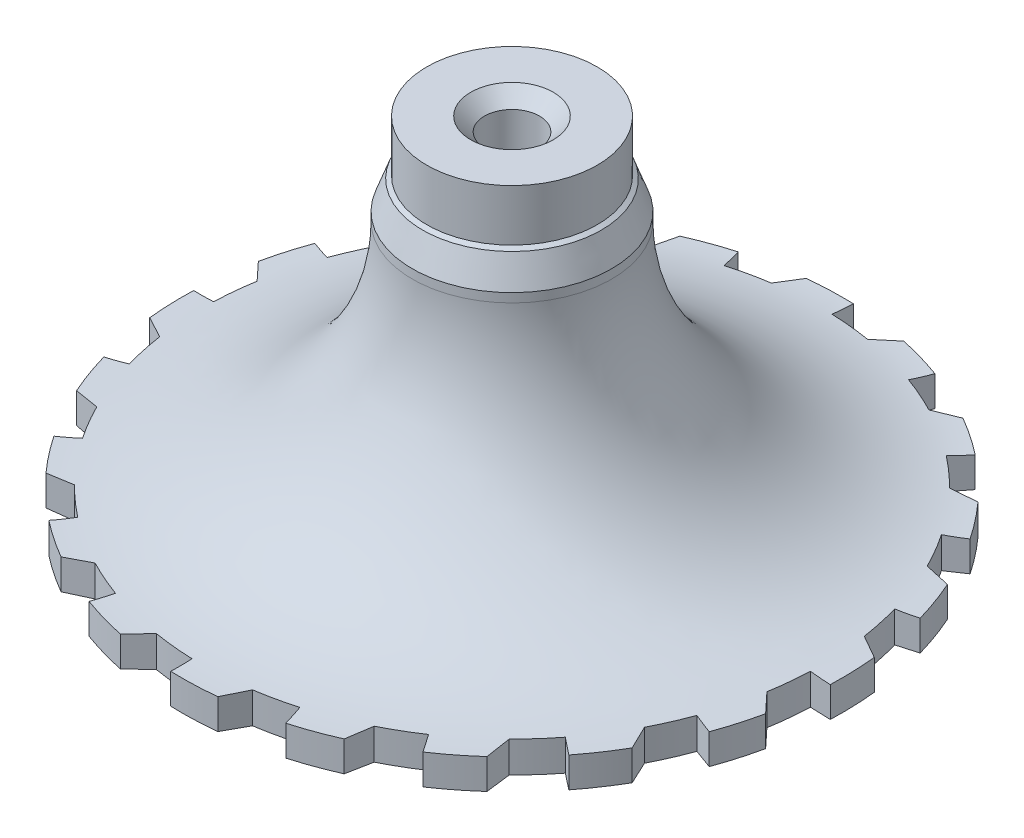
ISO-10303-21;
HEADER;
FILE_DESCRIPTION(('STEP AP214'),'2;1');
FILE_NAME('part.step','',(''),(''),'','','');
FILE_SCHEMA(('AUTOMOTIVE_DESIGN { 1 0 10303 214 1 1 1 1 }'));
ENDSEC;
DATA;
#1=APPLICATION_CONTEXT('core data for automotive mechanical design processes');
#2=APPLICATION_PROTOCOL_DEFINITION('international standard','automotive_design',2000,#1);
#3=PRODUCT_CONTEXT('',#1,'mechanical');
#4=PRODUCT('Part','Part','',(#3));
#5=PRODUCT_RELATED_PRODUCT_CATEGORY('part','',(#4));
#6=PRODUCT_DEFINITION_FORMATION('','',#4);
#7=PRODUCT_DEFINITION_CONTEXT('part definition',#1,'design');
#8=PRODUCT_DEFINITION('design','',#6,#7);
#9=PRODUCT_DEFINITION_SHAPE('','',#8);
#10=(LENGTH_UNIT() NAMED_UNIT(*) SI_UNIT(.MILLI.,.METRE.));
#11=(NAMED_UNIT(*) PLANE_ANGLE_UNIT() SI_UNIT($,.RADIAN.));
#12=(NAMED_UNIT(*) SI_UNIT($,.STERADIAN.) SOLID_ANGLE_UNIT());
#13=UNCERTAINTY_MEASURE_WITH_UNIT(LENGTH_MEASURE(1.E-05),#10,'distance_accuracy_value','');
#14=(GEOMETRIC_REPRESENTATION_CONTEXT(3) GLOBAL_UNCERTAINTY_ASSIGNED_CONTEXT((#13)) GLOBAL_UNIT_ASSIGNED_CONTEXT((#10,
#11,#12)) REPRESENTATION_CONTEXT('',''));
#15=CARTESIAN_POINT('',(0.,0.,0.));
#16=DIRECTION('',(0.,0.,1.));
#17=DIRECTION('',(1.,0.,0.));
#18=AXIS2_PLACEMENT_3D('',#15,#16,#17);
#19=CARTESIAN_POINT('',(30.48,0.,0.));
#20=DIRECTION('',(0.,-1.,0.));
#21=DIRECTION('',(0.,0.,-1.));
#22=AXIS2_PLACEMENT_3D('',#19,#20,#21);
#23=PLANE('',#22);
#24=CARTESIAN_POINT('',(0.,0.,0.));
#25=DIRECTION('',(0.,-1.,0.));
#26=DIRECTION('',(0.,0.,-1.));
#27=AXIS2_PLACEMENT_3D('',#24,#25,#26);
#28=CIRCLE('',#27,24.765);
#29=CARTESIAN_POINT('',(0.,0.,-24.765));
#30=VERTEX_POINT('',#29);
#31=EDGE_CURVE('E2041',#30,#30,#28,.T.);
#32=ORIENTED_EDGE('',*,*,#31,.F.);
#33=EDGE_LOOP('',(#32));
#34=FACE_BOUND('',#33,.T.);
#35=CARTESIAN_POINT('',(0.,0.,0.));
#36=DIRECTION('',(0.,-1.,0.));
#37=DIRECTION('',(0.,0.,-1.));
#38=AXIS2_PLACEMENT_3D('',#35,#36,#37);
#39=CIRCLE('',#38,30.48);
#40=CARTESIAN_POINT('',(30.3173727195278,0.,-3.14440954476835));
#41=VERTEX_POINT('',#40);
#42=CARTESIAN_POINT('',(30.461432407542,0.,1.06373665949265));
#43=VERTEX_POINT('',#42);
#44=EDGE_CURVE('E571',#41,#43,#39,.T.);
#45=ORIENTED_EDGE('',*,*,#44,.T.);
#46=DIRECTION('',(-0.999390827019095,0.,-0.0348994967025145));
#47=VECTOR('',#46,1.);
#48=CARTESIAN_POINT('',(30.461432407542,0.,1.06373665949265));
#49=LINE('',#48,#47);
#50=CARTESIAN_POINT('',(28.5575928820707,0.,0.997253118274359));
#51=VERTEX_POINT('',#50);
#52=EDGE_CURVE('E743',#43,#51,#49,.T.);
#53=ORIENTED_EDGE('',*,*,#52,.T.);
#54=CARTESIAN_POINT('',(0.,0.,0.));
#55=DIRECTION('',(0.,-1.,0.));
#56=DIRECTION('',(-0.309016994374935,0.,-0.951056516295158));
#57=AXIS2_PLACEMENT_3D('',#54,#55,#56);
#58=CIRCLE('',#57,28.575);
#59=CARTESIAN_POINT('',(28.1940613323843,0.,4.65032585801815));
#60=VERTEX_POINT('',#59);
#61=EDGE_CURVE('E740',#51,#60,#58,.T.);
#62=ORIENTED_EDGE('',*,*,#61,.T.);
#63=DIRECTION('',(0.681998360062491,0.,0.731353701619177));
#64=VECTOR('',#63,1.);
#65=CARTESIAN_POINT('',(29.8052108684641,0.,6.3780722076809));
#66=LINE('',#65,#64);
#67=CARTESIAN_POINT('',(29.8052108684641,0.,6.3780722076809));
#68=VERTEX_POINT('',#67);
#69=EDGE_CURVE('E548',#60,#68,#66,.T.);
#70=ORIENTED_EDGE('',*,*,#69,.T.);
#71=CARTESIAN_POINT('',(28.6418310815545,0.,10.4247739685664));
#72=VERTEX_POINT('',#71);
#73=EDGE_CURVE('E547',#68,#72,#39,.T.);
#74=ORIENTED_EDGE('',*,*,#73,.T.);
#75=DIRECTION('',(-0.939692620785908,0.,-0.342020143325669));
#76=VECTOR('',#75,1.);
#77=CARTESIAN_POINT('',(28.6418310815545,0.,10.4247739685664));
#78=LINE('',#77,#76);
#79=CARTESIAN_POINT('',(26.8517166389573,0.,9.773225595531));
#80=VERTEX_POINT('',#79);
#81=EDGE_CURVE('E2016',#72,#80,#78,.T.);
#82=ORIENTED_EDGE('',*,*,#81,.T.);
#83=CARTESIAN_POINT('',(0.,0.,0.));
#84=DIRECTION('',(0.,-1.,0.));
#85=DIRECTION('',(0.,0.,-1.));
#86=AXIS2_PLACEMENT_3D('',#83,#84,#85);
#87=CIRCLE('',#86,28.575);
#88=CARTESIAN_POINT('',(25.3771160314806,0.,13.13516680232));
#89=VERTEX_POINT('',#88);
#90=EDGE_CURVE('E2019',#80,#89,#87,.T.);
#91=ORIENTED_EDGE('',*,*,#90,.T.);
#92=DIRECTION('',(0.422618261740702,0.,0.906307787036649));
#93=VECTOR('',#92,1.);
#94=CARTESIAN_POINT('',(26.3755073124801,0.,15.2762238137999));
#95=LINE('',#94,#93);
#96=CARTESIAN_POINT('',(26.3755073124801,0.,15.2762238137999));
#97=VERTEX_POINT('',#96);
#98=EDGE_CURVE('E2022',#89,#97,#95,.T.);
#99=ORIENTED_EDGE('',*,*,#98,.T.);
#100=CARTESIAN_POINT('',(24.0185677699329,0.,18.7653617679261));
#101=VERTEX_POINT('',#100);
#102=EDGE_CURVE('E572',#97,#101,#39,.T.);
#103=ORIENTED_EDGE('',*,*,#102,.T.);
#104=DIRECTION('',(-0.788010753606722,0.,-0.615661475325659));
#105=VECTOR('',#104,1.);
#106=CARTESIAN_POINT('',(24.0185677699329,0.,18.7653617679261));
#107=LINE('',#106,#105);
#108=CARTESIAN_POINT('',(22.5174072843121,0.,17.5925266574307));
#109=VERTEX_POINT('',#108);
#110=EDGE_CURVE('E1986',#101,#109,#107,.T.);
#111=ORIENTED_EDGE('',*,*,#110,.T.);
#112=CARTESIAN_POINT('',(0.,0.,0.));
#113=DIRECTION('',(0.,-1.,0.));
#114=DIRECTION('',(0.309016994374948,0.,-0.951056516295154));
#115=AXIS2_PLACEMENT_3D('',#112,#113,#114);
#116=CIRCLE('',#115,28.575);
#117=CARTESIAN_POINT('',(20.0760818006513,0.,20.3342461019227));
#118=VERTEX_POINT('',#117);
#119=EDGE_CURVE('E1989',#109,#118,#116,.T.);
#120=ORIENTED_EDGE('',*,*,#119,.T.);
#121=DIRECTION('',(0.12186934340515,0.,0.992546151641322));
#122=VECTOR('',#121,1.);
#123=CARTESIAN_POINT('',(20.3639853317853,0.,22.6790321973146));
#124=LINE('',#123,#122);
#125=CARTESIAN_POINT('',(20.3639853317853,0.,22.6790321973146));
#126=VERTEX_POINT('',#125);
#127=EDGE_CURVE('E1992',#118,#126,#124,.T.);
#128=ORIENTED_EDGE('',*,*,#127,.T.);
#129=CARTESIAN_POINT('',(17.0441996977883,0.,25.2690652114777));
#130=VERTEX_POINT('',#129);
#131=EDGE_CURVE('E2042',#126,#130,#39,.T.);
#132=ORIENTED_EDGE('',*,*,#131,.T.);
#133=DIRECTION('',(-0.559192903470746,0.,-0.829037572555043));
#134=VECTOR('',#133,1.);
#135=CARTESIAN_POINT('',(17.0441996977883,0.,25.2690652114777));
#136=LINE('',#135,#134);
#137=CARTESIAN_POINT('',(15.9789372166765,0.,23.6897486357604));
#138=VERTEX_POINT('',#137);
#139=EDGE_CURVE('E2354',#130,#138,#136,.T.);
#140=ORIENTED_EDGE('',*,*,#139,.T.);
#141=CARTESIAN_POINT('',(0.,0.,0.));
#142=DIRECTION('',(0.,-1.,0.));
#143=DIRECTION('',(0.587785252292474,0.,-0.809016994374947));
#144=AXIS2_PLACEMENT_3D('',#141,#142,#143);
#145=CIRCLE('',#144,28.575);
#146=CARTESIAN_POINT('',(12.8098608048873,0.,25.5428677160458));
#147=VERTEX_POINT('',#146);
#148=EDGE_CURVE('E2348',#138,#147,#145,.T.);
#149=ORIENTED_EDGE('',*,*,#148,.T.);
#150=DIRECTION('',(-0.190808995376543,0.,0.981627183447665));
#151=VECTOR('',#150,1.);
#152=CARTESIAN_POINT('',(12.3590945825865,0.,27.8618588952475));
#153=LINE('',#152,#151);
#154=CARTESIAN_POINT('',(12.3590945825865,0.,27.8618588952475));
#155=VERTEX_POINT('',#154);
#156=EDGE_CURVE('E2344',#147,#155,#153,.T.);
#157=ORIENTED_EDGE('',*,*,#156,.T.);
#158=CARTESIAN_POINT('',(8.40142660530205,0.,29.2992564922));
#159=VERTEX_POINT('',#158);
#160=EDGE_CURVE('E2047',#155,#159,#39,.T.);
#161=ORIENTED_EDGE('',*,*,#160,.T.);
#162=DIRECTION('',(-0.275637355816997,0.,-0.96126169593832));
#163=VECTOR('',#162,1.);
#164=CARTESIAN_POINT('',(8.40142660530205,0.,29.2992564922));
#165=LINE('',#164,#163);
#166=CARTESIAN_POINT('',(7.87633744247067,0.,27.4680529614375));
#167=VERTEX_POINT('',#166);
#168=EDGE_CURVE('E1942',#159,#167,#165,.T.);
#169=ORIENTED_EDGE('',*,*,#168,.T.);
#170=CARTESIAN_POINT('',(0.,0.,0.));
#171=DIRECTION('',(0.,-1.,0.));
#172=DIRECTION('',(0.809016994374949,0.,-0.587785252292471));
#173=AXIS2_PLACEMENT_3D('',#170,#171,#172);
#174=CIRCLE('',#173,28.575);
#175=CARTESIAN_POINT('',(4.28972138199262,0.,28.2511754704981));
#176=VERTEX_POINT('',#175);
#177=EDGE_CURVE('E1945',#167,#176,#174,.T.);
#178=ORIENTED_EDGE('',*,*,#177,.T.);
#179=DIRECTION('',(-0.484809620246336,0.,0.874619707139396));
#180=VECTOR('',#179,1.);
#181=CARTESIAN_POINT('',(3.14440954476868,0.,30.3173727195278));
#182=LINE('',#181,#180);
#183=CARTESIAN_POINT('',(3.14440954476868,0.,30.3173727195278));
#184=VERTEX_POINT('',#183);
#185=EDGE_CURVE('E1948',#176,#184,#182,.T.);
#186=ORIENTED_EDGE('',*,*,#185,.T.);
#187=CARTESIAN_POINT('',(-1.06373665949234,0.,30.461432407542));
#188=VERTEX_POINT('',#187);
#189=EDGE_CURVE('E2066',#184,#188,#39,.T.);
#190=ORIENTED_EDGE('',*,*,#189,.T.);
#191=DIRECTION('',(0.0348994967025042,0.,-0.999390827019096));
#192=VECTOR('',#191,1.);
#193=CARTESIAN_POINT('',(-1.06373665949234,0.,30.461432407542));
#194=LINE('',#193,#192);
#195=CARTESIAN_POINT('',(-0.997253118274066,0.,28.5575928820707));
#196=VERTEX_POINT('',#195);
#197=EDGE_CURVE('E2328',#188,#196,#194,.T.);
#198=ORIENTED_EDGE('',*,*,#197,.T.);
#199=CARTESIAN_POINT('',(0.,0.,0.));
#200=DIRECTION('',(0.,-1.,0.));
#201=DIRECTION('',(0.951056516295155,0.,-0.309016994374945));
#202=AXIS2_PLACEMENT_3D('',#199,#200,#201);
#203=CIRCLE('',#202,28.575);
#204=CARTESIAN_POINT('',(-4.65032585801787,0.,28.1940613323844));
#205=VERTEX_POINT('',#204);
#206=EDGE_CURVE('E2322',#196,#205,#203,.T.);
#207=ORIENTED_EDGE('',*,*,#206,.T.);
#208=DIRECTION('',(-0.731353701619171,0.,0.681998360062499));
#209=VECTOR('',#208,1.);
#210=CARTESIAN_POINT('',(-6.37807220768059,0.,29.8052108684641));
#211=LINE('',#210,#209);
#212=CARTESIAN_POINT('',(-6.37807220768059,0.,29.8052108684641));
#213=VERTEX_POINT('',#212);
#214=EDGE_CURVE('E2318',#205,#213,#211,.T.);
#215=ORIENTED_EDGE('',*,*,#214,.T.);
#216=CARTESIAN_POINT('',(-10.4247739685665,0.,28.6418310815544));
#217=VERTEX_POINT('',#216);
#218=EDGE_CURVE('E2070',#213,#217,#39,.T.);
#219=ORIENTED_EDGE('',*,*,#218,.T.);
#220=DIRECTION('',(0.342020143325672,0.,-0.939692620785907));
#221=VECTOR('',#220,1.);
#222=CARTESIAN_POINT('',(-10.4247739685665,0.,28.6418310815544));
#223=LINE('',#222,#221);
#224=CARTESIAN_POINT('',(-9.7732255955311,0.,26.8517166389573));
#225=VERTEX_POINT('',#224);
#226=EDGE_CURVE('E1898',#217,#225,#223,.T.);
#227=ORIENTED_EDGE('',*,*,#226,.T.);
#228=CARTESIAN_POINT('',(0.,0.,0.));
#229=DIRECTION('',(0.,-1.,0.));
#230=DIRECTION('',(1.,0.,0.));
#231=AXIS2_PLACEMENT_3D('',#228,#229,#230);
#232=CIRCLE('',#231,28.575);
#233=CARTESIAN_POINT('',(-13.1351668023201,0.,25.3771160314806));
#234=VERTEX_POINT('',#233);
#235=EDGE_CURVE('E1901',#225,#234,#232,.T.);
#236=ORIENTED_EDGE('',*,*,#235,.T.);
#237=DIRECTION('',(-0.90630778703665,0.,0.422618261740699));
#238=VECTOR('',#237,1.);
#239=CARTESIAN_POINT('',(-15.2762238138,0.,26.3755073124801));
#240=LINE('',#239,#238);
#241=CARTESIAN_POINT('',(-15.2762238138,0.,26.3755073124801));
#242=VERTEX_POINT('',#241);
#243=EDGE_CURVE('E1904',#234,#242,#240,.T.);
#244=ORIENTED_EDGE('',*,*,#243,.T.);
#245=CARTESIAN_POINT('',(-18.7653617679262,0.,24.0185677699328));
#246=VERTEX_POINT('',#245);
#247=EDGE_CURVE('E2074',#242,#246,#39,.T.);
#248=ORIENTED_EDGE('',*,*,#247,.T.);
#249=DIRECTION('',(0.615661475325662,0.,-0.788010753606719));
#250=VECTOR('',#249,1.);
#251=CARTESIAN_POINT('',(-18.7653617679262,0.,24.0185677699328));
#252=LINE('',#251,#250);
#253=CARTESIAN_POINT('',(-17.5925266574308,0.,22.517407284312));
#254=VERTEX_POINT('',#253);
#255=EDGE_CURVE('E2302',#246,#254,#252,.T.);
#256=ORIENTED_EDGE('',*,*,#255,.T.);
#257=CARTESIAN_POINT('',(0.,0.,0.));
#258=DIRECTION('',(0.,-1.,0.));
#259=DIRECTION('',(0.951056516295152,0.,0.309016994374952));
#260=AXIS2_PLACEMENT_3D('',#257,#258,#259);
#261=CIRCLE('',#260,28.575);
#262=CARTESIAN_POINT('',(-20.3342461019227,0.,20.0760818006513));
#263=VERTEX_POINT('',#262);
#264=EDGE_CURVE('E2296',#254,#263,#261,.T.);
#265=ORIENTED_EDGE('',*,*,#264,.T.);
#266=DIRECTION('',(-0.992546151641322,0.,0.121869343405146));
#267=VECTOR('',#266,1.);
#268=CARTESIAN_POINT('',(-22.6790321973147,0.,20.3639853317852));
#269=LINE('',#268,#267);
#270=CARTESIAN_POINT('',(-22.6790321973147,0.,20.3639853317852));
#271=VERTEX_POINT('',#270);
#272=EDGE_CURVE('E2292',#263,#271,#269,.T.);
#273=ORIENTED_EDGE('',*,*,#272,.T.);
#274=CARTESIAN_POINT('',(-25.2690652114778,0.,17.0441996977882));
#275=VERTEX_POINT('',#274);
#276=EDGE_CURVE('E2078',#271,#275,#39,.T.);
#277=ORIENTED_EDGE('',*,*,#276,.T.);
#278=DIRECTION('',(0.829037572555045,0.,-0.559192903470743));
#279=VECTOR('',#278,1.);
#280=CARTESIAN_POINT('',(-25.2690652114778,0.,17.0441996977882));
#281=LINE('',#280,#279);
#282=CARTESIAN_POINT('',(-23.6897486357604,0.,15.9789372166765));
#283=VERTEX_POINT('',#282);
#284=EDGE_CURVE('E1854',#275,#283,#281,.T.);
#285=ORIENTED_EDGE('',*,*,#284,.T.);
#286=CARTESIAN_POINT('',(0.,0.,0.));
#287=DIRECTION('',(0.,-1.,0.));
#288=DIRECTION('',(0.809016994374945,0.,0.587785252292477));
#289=AXIS2_PLACEMENT_3D('',#286,#287,#288);
#290=CIRCLE('',#289,28.575);
#291=CARTESIAN_POINT('',(-25.5428677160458,0.,12.8098608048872));
#292=VERTEX_POINT('',#291);
#293=EDGE_CURVE('E1857',#283,#292,#290,.T.);
#294=ORIENTED_EDGE('',*,*,#293,.T.);
#295=DIRECTION('',(-0.981627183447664,0.,-0.190808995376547));
#296=VECTOR('',#295,1.);
#297=CARTESIAN_POINT('',(-27.8618588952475,0.,12.3590945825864));
#298=LINE('',#297,#296);
#299=CARTESIAN_POINT('',(-27.8618588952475,0.,12.3590945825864));
#300=VERTEX_POINT('',#299);
#301=EDGE_CURVE('E1860',#292,#300,#298,.T.);
#302=ORIENTED_EDGE('',*,*,#301,.T.);
#303=CARTESIAN_POINT('',(-29.2992564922,0.,8.40142660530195));
#304=VERTEX_POINT('',#303);
#305=EDGE_CURVE('E2082',#300,#304,#39,.T.);
#306=ORIENTED_EDGE('',*,*,#305,.T.);
#307=DIRECTION('',(0.961261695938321,0.,-0.275637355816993));
#308=VECTOR('',#307,1.);
#309=CARTESIAN_POINT('',(-29.2992564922,0.,8.40142660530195));
#310=LINE('',#309,#308);
#311=CARTESIAN_POINT('',(-27.4680529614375,0.,7.87633744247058));
#312=VERTEX_POINT('',#311);
#313=EDGE_CURVE('E2276',#304,#312,#310,.T.);
#314=ORIENTED_EDGE('',*,*,#313,.T.);
#315=CARTESIAN_POINT('',(0.,0.,0.));
#316=DIRECTION('',(0.,-1.,0.));
#317=DIRECTION('',(0.587785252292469,0.,0.809016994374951));
#318=AXIS2_PLACEMENT_3D('',#315,#316,#317);
#319=CIRCLE('',#318,28.575);
#320=CARTESIAN_POINT('',(-28.2511754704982,0.,4.28972138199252));
#321=VERTEX_POINT('',#320);
#322=EDGE_CURVE('E2270',#312,#321,#319,.T.);
#323=ORIENTED_EDGE('',*,*,#322,.T.);
#324=DIRECTION('',(-0.874619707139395,0.,-0.484809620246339));
#325=VECTOR('',#324,1.);
#326=CARTESIAN_POINT('',(-30.3173727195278,0.,3.14440954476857));
#327=LINE('',#326,#325);
#328=CARTESIAN_POINT('',(-30.3173727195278,0.,3.14440954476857));
#329=VERTEX_POINT('',#328);
#330=EDGE_CURVE('E2266',#321,#329,#327,.T.);
#331=ORIENTED_EDGE('',*,*,#330,.T.);
#332=CARTESIAN_POINT('',(-30.461432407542,0.,-1.06373665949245));
#333=VERTEX_POINT('',#332);
#334=EDGE_CURVE('E2086',#329,#333,#39,.T.);
#335=ORIENTED_EDGE('',*,*,#334,.T.);
#336=DIRECTION('',(0.999390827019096,0.,0.0348994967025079));
#337=VECTOR('',#336,1.);
#338=CARTESIAN_POINT('',(-30.461432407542,0.,-1.06373665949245));
#339=LINE('',#338,#337);
#340=CARTESIAN_POINT('',(-28.5575928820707,0.,-0.997253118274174));
#341=VERTEX_POINT('',#340);
#342=EDGE_CURVE('E1810',#333,#341,#339,.T.);
#343=ORIENTED_EDGE('',*,*,#342,.T.);
#344=CARTESIAN_POINT('',(0.,0.,0.));
#345=DIRECTION('',(0.,-1.,0.));
#346=DIRECTION('',(0.309016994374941,0.,0.951056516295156));
#347=AXIS2_PLACEMENT_3D('',#344,#345,#346);
#348=CIRCLE('',#347,28.575);
#349=CARTESIAN_POINT('',(-28.1940613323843,0.,-4.65032585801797));
#350=VERTEX_POINT('',#349);
#351=EDGE_CURVE('E1813',#341,#350,#348,.T.);
#352=ORIENTED_EDGE('',*,*,#351,.T.);
#353=DIRECTION('',(-0.681998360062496,0.,-0.731353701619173));
#354=VECTOR('',#353,1.);
#355=CARTESIAN_POINT('',(-29.8052108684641,0.,-6.3780722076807));
#356=LINE('',#355,#354);
#357=CARTESIAN_POINT('',(-29.8052108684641,0.,-6.3780722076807));
#358=VERTEX_POINT('',#357);
#359=EDGE_CURVE('E1816',#350,#358,#356,.T.);
#360=ORIENTED_EDGE('',*,*,#359,.T.);
#361=CARTESIAN_POINT('',(-28.6418310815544,0.,-10.4247739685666));
#362=VERTEX_POINT('',#361);
#363=EDGE_CURVE('E2090',#358,#362,#39,.T.);
#364=ORIENTED_EDGE('',*,*,#363,.T.);
#365=DIRECTION('',(0.939692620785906,0.,0.342020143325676));
#366=VECTOR('',#365,1.);
#367=CARTESIAN_POINT('',(-28.6418310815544,0.,-10.4247739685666));
#368=LINE('',#367,#366);
#369=CARTESIAN_POINT('',(-26.8517166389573,0.,-9.77322559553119));
#370=VERTEX_POINT('',#369);
#371=EDGE_CURVE('E2250',#362,#370,#368,.T.);
#372=ORIENTED_EDGE('',*,*,#371,.T.);
#373=CARTESIAN_POINT('',(0.,0.,0.));
#374=DIRECTION('',(0.,-1.,0.));
#375=DIRECTION('',(0.,0.,1.));
#376=AXIS2_PLACEMENT_3D('',#373,#374,#375);
#377=CIRCLE('',#376,28.575);
#378=CARTESIAN_POINT('',(-25.3771160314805,0.,-13.1351668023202));
#379=VERTEX_POINT('',#378);
#380=EDGE_CURVE('E2244',#370,#379,#377,.T.);
#381=ORIENTED_EDGE('',*,*,#380,.T.);
#382=DIRECTION('',(-0.422618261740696,0.,-0.906307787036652));
#383=VECTOR('',#382,1.);
#384=CARTESIAN_POINT('',(-26.37550731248,0.,-15.2762238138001));
#385=LINE('',#384,#383);
#386=CARTESIAN_POINT('',(-26.37550731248,0.,-15.2762238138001));
#387=VERTEX_POINT('',#386);
#388=EDGE_CURVE('E2240',#379,#387,#385,.T.);
#389=ORIENTED_EDGE('',*,*,#388,.T.);
#390=CARTESIAN_POINT('',(-24.0185677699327,0.,-18.7653617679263));
#391=VERTEX_POINT('',#390);
#392=EDGE_CURVE('E2094',#387,#391,#39,.T.);
#393=ORIENTED_EDGE('',*,*,#392,.T.);
#394=DIRECTION('',(0.788010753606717,0.,0.615661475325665));
#395=VECTOR('',#394,1.);
#396=CARTESIAN_POINT('',(-24.0185677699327,0.,-18.7653617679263));
#397=LINE('',#396,#395);
#398=CARTESIAN_POINT('',(-22.5174072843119,0.,-17.5925266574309));
#399=VERTEX_POINT('',#398);
#400=EDGE_CURVE('E1766',#391,#399,#397,.T.);
#401=ORIENTED_EDGE('',*,*,#400,.T.);
#402=CARTESIAN_POINT('',(0.,0.,0.));
#403=DIRECTION('',(0.,-1.,0.));
#404=DIRECTION('',(-0.309016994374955,0.,0.951056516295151));
#405=AXIS2_PLACEMENT_3D('',#402,#403,#404);
#406=CIRCLE('',#405,28.575);
#407=CARTESIAN_POINT('',(-20.0760818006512,0.,-20.3342461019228));
#408=VERTEX_POINT('',#407);
#409=EDGE_CURVE('E1769',#399,#408,#406,.T.);
#410=ORIENTED_EDGE('',*,*,#409,.T.);
#411=DIRECTION('',(-0.121869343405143,0.,-0.992546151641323));
#412=VECTOR('',#411,1.);
#413=CARTESIAN_POINT('',(-20.3639853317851,0.,-22.6790321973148));
#414=LINE('',#413,#412);
#415=CARTESIAN_POINT('',(-20.3639853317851,0.,-22.6790321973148));
#416=VERTEX_POINT('',#415);
#417=EDGE_CURVE('E1772',#408,#416,#414,.T.);
#418=ORIENTED_EDGE('',*,*,#417,.T.);
#419=CARTESIAN_POINT('',(-17.0441996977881,0.,-25.2690652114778));
#420=VERTEX_POINT('',#419);
#421=EDGE_CURVE('E2098',#416,#420,#39,.T.);
#422=ORIENTED_EDGE('',*,*,#421,.T.);
#423=DIRECTION('',(0.559192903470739,0.,0.829037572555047));
#424=VECTOR('',#423,1.);
#425=CARTESIAN_POINT('',(-17.0441996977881,0.,-25.2690652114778));
#426=LINE('',#425,#424);
#427=CARTESIAN_POINT('',(-15.9789372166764,0.,-23.6897486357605));
#428=VERTEX_POINT('',#427);
#429=EDGE_CURVE('E2224',#420,#428,#426,.T.);
#430=ORIENTED_EDGE('',*,*,#429,.T.);
#431=CARTESIAN_POINT('',(0.,0.,0.));
#432=DIRECTION('',(0.,-1.,0.));
#433=DIRECTION('',(-0.58778525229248,0.,0.809016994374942));
#434=AXIS2_PLACEMENT_3D('',#431,#432,#433);
#435=CIRCLE('',#434,28.575);
#436=CARTESIAN_POINT('',(-12.8098608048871,0.,-25.5428677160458));
#437=VERTEX_POINT('',#436);
#438=EDGE_CURVE('E2218',#428,#437,#435,.T.);
#439=ORIENTED_EDGE('',*,*,#438,.T.);
#440=DIRECTION('',(0.19080899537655,0.,-0.981627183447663));
#441=VECTOR('',#440,1.);
#442=CARTESIAN_POINT('',(-12.3590945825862,0.,-27.8618588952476));
#443=LINE('',#442,#441);
#444=CARTESIAN_POINT('',(-12.3590945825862,0.,-27.8618588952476));
#445=VERTEX_POINT('',#444);
#446=EDGE_CURVE('E2214',#437,#445,#443,.T.);
#447=ORIENTED_EDGE('',*,*,#446,.T.);
#448=CARTESIAN_POINT('',(-8.40142660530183,0.,-29.2992564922));
#449=VERTEX_POINT('',#448);
#450=EDGE_CURVE('E2102',#445,#449,#39,.T.);
#451=ORIENTED_EDGE('',*,*,#450,.T.);
#452=DIRECTION('',(0.27563735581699,0.,0.961261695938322));
#453=VECTOR('',#452,1.);
#454=CARTESIAN_POINT('',(-8.40142660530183,0.,-29.2992564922));
#455=LINE('',#454,#453);
#456=CARTESIAN_POINT('',(-7.87633744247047,0.,-27.4680529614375));
#457=VERTEX_POINT('',#456);
#458=EDGE_CURVE('E1722',#449,#457,#455,.T.);
#459=ORIENTED_EDGE('',*,*,#458,.T.);
#460=CARTESIAN_POINT('',(0.,0.,0.));
#461=DIRECTION('',(0.,-1.,0.));
#462=DIRECTION('',(-0.809016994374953,0.,0.587785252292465));
#463=AXIS2_PLACEMENT_3D('',#460,#461,#462);
#464=CIRCLE('',#463,28.575);
#465=CARTESIAN_POINT('',(-4.28972138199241,0.,-28.2511754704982));
#466=VERTEX_POINT('',#465);
#467=EDGE_CURVE('E1725',#457,#466,#464,.T.);
#468=ORIENTED_EDGE('',*,*,#467,.T.);
#469=DIRECTION('',(0.484809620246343,0.,-0.874619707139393));
#470=VECTOR('',#469,1.);
#471=CARTESIAN_POINT('',(-3.14440954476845,0.,-30.3173727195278));
#472=LINE('',#471,#470);
#473=CARTESIAN_POINT('',(-3.14440954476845,0.,-30.3173727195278));
#474=VERTEX_POINT('',#473);
#475=EDGE_CURVE('E1728',#466,#474,#472,.T.);
#476=ORIENTED_EDGE('',*,*,#475,.T.);
#477=CARTESIAN_POINT('',(1.06373665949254,0.,-30.461432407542));
#478=VERTEX_POINT('',#477);
#479=EDGE_CURVE('E2106',#474,#478,#39,.T.);
#480=ORIENTED_EDGE('',*,*,#479,.T.);
#481=DIRECTION('',(-0.034899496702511,0.,0.999390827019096));
#482=VECTOR('',#481,1.);
#483=CARTESIAN_POINT('',(1.06373665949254,0.,-30.461432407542));
#484=LINE('',#483,#482);
#485=CARTESIAN_POINT('',(0.99725311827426,0.,-28.5575928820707));
#486=VERTEX_POINT('',#485);
#487=EDGE_CURVE('E2198',#478,#486,#484,.T.);
#488=ORIENTED_EDGE('',*,*,#487,.T.);
#489=CARTESIAN_POINT('',(0.,0.,0.));
#490=DIRECTION('',(0.,-1.,0.));
#491=DIRECTION('',(-0.951056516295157,0.,0.309016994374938));
#492=AXIS2_PLACEMENT_3D('',#489,#490,#491);
#493=CIRCLE('',#492,28.575);
#494=CARTESIAN_POINT('',(4.65032585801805,0.,-28.1940613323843));
#495=VERTEX_POINT('',#494);
#496=EDGE_CURVE('E2192',#486,#495,#493,.T.);
#497=ORIENTED_EDGE('',*,*,#496,.T.);
#498=DIRECTION('',(0.731353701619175,0.,-0.681998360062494));
#499=VECTOR('',#498,1.);
#500=CARTESIAN_POINT('',(6.37807220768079,0.,-29.8052108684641));
#501=LINE('',#500,#499);
#502=CARTESIAN_POINT('',(6.37807220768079,0.,-29.8052108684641));
#503=VERTEX_POINT('',#502);
#504=EDGE_CURVE('E2188',#495,#503,#501,.T.);
#505=ORIENTED_EDGE('',*,*,#504,.T.);
#506=CARTESIAN_POINT('',(10.4247739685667,0.,-28.6418310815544));
#507=VERTEX_POINT('',#506);
#508=EDGE_CURVE('E2110',#503,#507,#39,.T.);
#509=ORIENTED_EDGE('',*,*,#508,.T.);
#510=DIRECTION('',(-0.342020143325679,0.,0.939692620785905));
#511=VECTOR('',#510,1.);
#512=CARTESIAN_POINT('',(10.4247739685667,0.,-28.6418310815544));
#513=LINE('',#512,#511);
#514=CARTESIAN_POINT('',(9.77322559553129,0.,-26.8517166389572));
#515=VERTEX_POINT('',#514);
#516=EDGE_CURVE('E1678',#507,#515,#513,.T.);
#517=ORIENTED_EDGE('',*,*,#516,.T.);
#518=CARTESIAN_POINT('',(0.,0.,0.));
#519=DIRECTION('',(0.,-1.,0.));
#520=DIRECTION('',(-1.,0.,0.));
#521=AXIS2_PLACEMENT_3D('',#518,#519,#520);
#522=CIRCLE('',#521,28.575);
#523=CARTESIAN_POINT('',(13.1351668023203,0.,-25.3771160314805));
#524=VERTEX_POINT('',#523);
#525=EDGE_CURVE('E1681',#515,#524,#522,.T.);
#526=ORIENTED_EDGE('',*,*,#525,.T.);
#527=DIRECTION('',(0.906307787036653,0.,-0.422618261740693));
#528=VECTOR('',#527,1.);
#529=CARTESIAN_POINT('',(15.2762238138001,0.,-26.37550731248));
#530=LINE('',#529,#528);
#531=CARTESIAN_POINT('',(15.2762238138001,0.,-26.37550731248));
#532=VERTEX_POINT('',#531);
#533=EDGE_CURVE('E1684',#524,#532,#530,.T.);
#534=ORIENTED_EDGE('',*,*,#533,.T.);
#535=CARTESIAN_POINT('',(18.7653617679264,0.,-24.0185677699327));
#536=VERTEX_POINT('',#535);
#537=EDGE_CURVE('E2114',#532,#536,#39,.T.);
#538=ORIENTED_EDGE('',*,*,#537,.T.);
#539=DIRECTION('',(-0.615661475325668,0.,0.788010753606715));
#540=VECTOR('',#539,1.);
#541=CARTESIAN_POINT('',(18.7653617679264,0.,-24.0185677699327));
#542=LINE('',#541,#540);
#543=CARTESIAN_POINT('',(17.592526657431,0.,-22.5174072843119));
#544=VERTEX_POINT('',#543);
#545=EDGE_CURVE('E2155',#536,#544,#542,.T.);
#546=ORIENTED_EDGE('',*,*,#545,.T.);
#547=CARTESIAN_POINT('',(0.,0.,0.));
#548=DIRECTION('',(0.,-1.,0.));
#549=DIRECTION('',(-0.95105651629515,0.,-0.309016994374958));
#550=AXIS2_PLACEMENT_3D('',#547,#548,#549);
#551=CIRCLE('',#550,28.575);
#552=CARTESIAN_POINT('',(20.3342461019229,0.,-20.0760818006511));
#553=VERTEX_POINT('',#552);
#554=EDGE_CURVE('E2157',#544,#553,#551,.T.);
#555=ORIENTED_EDGE('',*,*,#554,.T.);
#556=DIRECTION('',(0.992546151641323,0.,-0.121869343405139));
#557=VECTOR('',#556,1.);
#558=CARTESIAN_POINT('',(22.6790321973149,0.,-20.363985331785));
#559=LINE('',#558,#557);
#560=CARTESIAN_POINT('',(22.6790321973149,0.,-20.363985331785));
#561=VERTEX_POINT('',#560);
#562=EDGE_CURVE('E2160',#553,#561,#559,.T.);
#563=ORIENTED_EDGE('',*,*,#562,.T.);
#564=CARTESIAN_POINT('',(25.2690652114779,0.,-17.044199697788));
#565=VERTEX_POINT('',#564);
#566=EDGE_CURVE('E2118',#561,#565,#39,.T.);
#567=ORIENTED_EDGE('',*,*,#566,.T.);
#568=DIRECTION('',(-0.829037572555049,0.,0.559192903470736));
#569=VECTOR('',#568,1.);
#570=CARTESIAN_POINT('',(25.2690652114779,0.,-17.044199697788));
#571=LINE('',#570,#569);
#572=CARTESIAN_POINT('',(23.6897486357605,0.,-15.9789372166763));
#573=VERTEX_POINT('',#572);
#574=EDGE_CURVE('E2136',#565,#573,#571,.T.);
#575=ORIENTED_EDGE('',*,*,#574,.T.);
#576=CARTESIAN_POINT('',(0.,0.,0.));
#577=DIRECTION('',(0.,-1.,0.));
#578=DIRECTION('',(-0.80901699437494,0.,-0.587785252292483));
#579=AXIS2_PLACEMENT_3D('',#576,#577,#578);
#580=CIRCLE('',#579,28.575);
#581=CARTESIAN_POINT('',(25.5428677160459,0.,-12.8098608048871));
#582=VERTEX_POINT('',#581);
#583=EDGE_CURVE('E2131',#573,#582,#580,.T.);
#584=ORIENTED_EDGE('',*,*,#583,.T.);
#585=DIRECTION('',(0.981627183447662,0.,0.190808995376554));
#586=VECTOR('',#585,1.);
#587=CARTESIAN_POINT('',(27.8618588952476,0.,-12.3590945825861));
#588=LINE('',#587,#586);
#589=CARTESIAN_POINT('',(27.8618588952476,0.,-12.3590945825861));
#590=VERTEX_POINT('',#589);
#591=EDGE_CURVE('E2129',#582,#590,#588,.T.);
#592=ORIENTED_EDGE('',*,*,#591,.T.);
#593=CARTESIAN_POINT('',(29.2992564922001,0.,-8.40142660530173));
#594=VERTEX_POINT('',#593);
#595=EDGE_CURVE('E2122',#590,#594,#39,.T.);
#596=ORIENTED_EDGE('',*,*,#595,.T.);
#597=DIRECTION('',(-0.961261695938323,0.,0.275637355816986));
#598=VECTOR('',#597,1.);
#599=CARTESIAN_POINT('',(29.2992564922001,0.,-8.40142660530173));
#600=LINE('',#599,#598);
#601=CARTESIAN_POINT('',(27.4680529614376,0.,-7.87633744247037));
#602=VERTEX_POINT('',#601);
#603=EDGE_CURVE('E686',#594,#602,#600,.T.);
#604=ORIENTED_EDGE('',*,*,#603,.T.);
#605=CARTESIAN_POINT('',(0.,0.,0.));
#606=DIRECTION('',(0.,-1.,0.));
#607=DIRECTION('',(-0.587785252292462,0.,-0.809016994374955));
#608=AXIS2_PLACEMENT_3D('',#605,#606,#607);
#609=CIRCLE('',#608,28.575);
#610=CARTESIAN_POINT('',(28.2511754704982,0.,-4.28972138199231));
#611=VERTEX_POINT('',#610);
#612=EDGE_CURVE('E689',#602,#611,#609,.T.);
#613=ORIENTED_EDGE('',*,*,#612,.T.);
#614=DIRECTION('',(0.874619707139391,0.,0.484809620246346));
#615=VECTOR('',#614,1.);
#616=CARTESIAN_POINT('',(30.3173727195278,0.,-3.14440954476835));
#617=LINE('',#616,#615);
#618=EDGE_CURVE('E695',#611,#41,#617,.T.);
#619=ORIENTED_EDGE('',*,*,#618,.T.);
#620=EDGE_LOOP('',(#45,#53,#62,#70,#74,#82,#91,#99,#103,#111,#120,#128,#132,#140,#149,#157,#161,
#169,#178,#186,#190,#198,#207,#215,#219,#227,#236,#244,#248,#256,#265,#273,#277,#285,#294,#302,
#306,#314,#323,#331,#335,#343,#352,#360,#364,#372,#381,#389,#393,#401,#410,#418,#422,#430,#439,
#447,#451,#459,#468,#476,#480,#488,#497,#505,#509,#517,#526,#534,#538,#546,#555,#563,#567,#575,
#584,#592,#596,#604,#613,#619));
#621=FACE_BOUND('',#620,.T.);
#622=ADVANCED_FACE('F34',(#34,#621),#23,.T.);
#623=CARTESIAN_POINT('',(0.,0.,0.));
#624=DIRECTION('',(0.,-1.,0.));
#625=DIRECTION('',(0.,0.,-1.));
#626=AXIS2_PLACEMENT_3D('',#623,#624,#625);
#627=CYLINDRICAL_SURFACE('',#626,30.48);
#628=CARTESIAN_POINT('',(0.,2.794,0.));
#629=DIRECTION('',(0.,-1.,0.));
#630=DIRECTION('',(0.,0.,-1.));
#631=AXIS2_PLACEMENT_3D('',#628,#629,#630);
#632=CIRCLE('',#631,30.48);
#633=CARTESIAN_POINT('',(30.3173727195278,2.794,-3.14440954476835));
#634=VERTEX_POINT('',#633);
#635=CARTESIAN_POINT('',(30.461432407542,2.794,1.06373665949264));
#636=VERTEX_POINT('',#635);
#637=EDGE_CURVE('E555',#634,#636,#632,.T.);
#638=ORIENTED_EDGE('',*,*,#637,.T.);
#639=DIRECTION('',(0.,-1.,0.));
#640=VECTOR('',#639,1.);
#641=CARTESIAN_POINT('',(30.461432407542,32.513,1.06373665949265));
#642=LINE('',#641,#640);
#643=EDGE_CURVE('E539',#636,#43,#642,.T.);
#644=ORIENTED_EDGE('',*,*,#643,.T.);
#645=ORIENTED_EDGE('',*,*,#44,.F.);
#646=DIRECTION('',(0.,-1.,0.));
#647=VECTOR('',#646,1.);
#648=CARTESIAN_POINT('',(30.3173727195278,32.513,-3.14440954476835));
#649=LINE('',#648,#647);
#650=EDGE_CURVE('E698',#634,#41,#649,.T.);
#651=ORIENTED_EDGE('',*,*,#650,.F.);
#652=EDGE_LOOP('',(#638,#644,#645,#651));
#653=FACE_BOUND('',#652,.T.);
#654=ADVANCED_FACE('F754',(#653),#627,.T.);
#655=ORIENTED_EDGE('',*,*,#73,.F.);
#656=DIRECTION('',(0.,-1.,0.));
#657=VECTOR('',#656,1.);
#658=CARTESIAN_POINT('',(29.8052108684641,32.513,6.3780722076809));
#659=LINE('',#658,#657);
#660=CARTESIAN_POINT('',(29.8052108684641,2.794,6.37807220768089));
#661=VERTEX_POINT('',#660);
#662=EDGE_CURVE('E534',#661,#68,#659,.T.);
#663=ORIENTED_EDGE('',*,*,#662,.F.);
#664=CARTESIAN_POINT('',(28.6418310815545,2.794,10.4247739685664));
#665=VERTEX_POINT('',#664);
#666=EDGE_CURVE('E545',#661,#665,#632,.T.);
#667=ORIENTED_EDGE('',*,*,#666,.T.);
#668=DIRECTION('',(0.,-1.,0.));
#669=VECTOR('',#668,1.);
#670=CARTESIAN_POINT('',(28.6418310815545,32.513,10.4247739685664));
#671=LINE('',#670,#669);
#672=EDGE_CURVE('E823',#665,#72,#671,.T.);
#673=ORIENTED_EDGE('',*,*,#672,.T.);
#674=EDGE_LOOP('',(#655,#663,#667,#673));
#675=FACE_BOUND('',#674,.T.);
#676=ADVANCED_FACE('F543',(#675),#627,.T.);
#677=CARTESIAN_POINT('',(0.,24.0665,0.));
#678=DIRECTION('',(0.,-1.,0.));
#679=DIRECTION('',(0.,0.,-1.));
#680=AXIS2_PLACEMENT_3D('',#677,#678,#679);
#681=TOROIDAL_SURFACE('',#680,30.48,21.2725);
#682=CARTESIAN_POINT('',(0.,24.0665,0.));
#683=DIRECTION('',(0.,-1.,0.));
#684=DIRECTION('',(0.,0.,-1.));
#685=AXIS2_PLACEMENT_3D('',#682,#683,#684);
#686=CIRCLE('',#685,9.2075);
#687=CARTESIAN_POINT('',(0.,24.0665,-9.2075));
#688=VERTEX_POINT('',#687);
#689=EDGE_CURVE('E556',#688,#688,#686,.T.);
#690=ORIENTED_EDGE('',*,*,#689,.T.);
#691=EDGE_LOOP('',(#690));
#692=FACE_BOUND('',#691,.T.);
#693=CARTESIAN_POINT('',(0.,2.87947021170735,0.));
#694=DIRECTION('',(0.,1.,0.));
#695=DIRECTION('',(0.,0.,1.));
#696=AXIS2_PLACEMENT_3D('',#693,#694,#695);
#697=CIRCLE('',#696,28.575);
#698=CARTESIAN_POINT('',(28.5575928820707,2.87947021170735,0.997253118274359));
#699=VERTEX_POINT('',#698);
#700=CARTESIAN_POINT('',(28.1940613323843,2.87947021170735,4.65032585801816));
#701=VERTEX_POINT('',#700);
#702=EDGE_CURVE('E49',#699,#701,#697,.F.);
#703=ORIENTED_EDGE('',*,*,#702,.F.);
#704=CARTESIAN_POINT('',(30.461432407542,24.0665,1.06373665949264));
#705=DIRECTION('',(-0.0348994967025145,0.,0.999390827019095));
#706=DIRECTION('',(0.999390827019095,0.,0.0348994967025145));
#707=AXIS2_PLACEMENT_3D('',#704,#705,#706);
#708=CIRCLE('',#707,21.2725);
#709=EDGE_CURVE('E746',#636,#699,#708,.F.);
#710=ORIENTED_EDGE('',*,*,#709,.F.);
#711=ORIENTED_EDGE('',*,*,#637,.F.);
#712=CARTESIAN_POINT('',(28.2509754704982,2.87948649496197,-4.2898322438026));
#713=CARTESIAN_POINT('',(28.4229303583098,2.86548516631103,-4.19451609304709));
#714=CARTESIAN_POINT('',(28.5949898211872,2.85313894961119,-4.09914197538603));
#715=CARTESIAN_POINT('',(28.9392152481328,2.83185726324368,-3.90833470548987));
#716=CARTESIAN_POINT('',(29.1113811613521,2.82292071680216,-3.81290158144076));
#717=CARTESIAN_POINT('',(29.4558282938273,2.80854980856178,-3.62197141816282));
#718=CARTESIAN_POINT('',(29.628109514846,2.80311550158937,-3.52647437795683));
#719=CARTESIAN_POINT('',(29.9727842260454,2.79583896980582,-3.33541806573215));
#720=CARTESIAN_POINT('',(30.1451777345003,2.79399788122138,-3.23985878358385));
#721=CARTESIAN_POINT('',(30.3175727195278,2.7940000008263,-3.14429868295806));
#722=B_SPLINE_CURVE_WITH_KNOTS('',3,(#712,#713,#714,#715,#716,#717,#718,#719,#720,#721),
.UNSPECIFIED.,.F.,.F.,(4,2,2,2,4),(0.,0.591305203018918,1.18242351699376,1.77355108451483,
2.36486554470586),.UNSPECIFIED.);
#723=CARTESIAN_POINT('',(28.2511754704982,2.87947021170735,-4.2897213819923));
#724=VERTEX_POINT('',#723);
#725=EDGE_CURVE('E705',#724,#634,#722,.T.);
#726=ORIENTED_EDGE('',*,*,#725,.F.);
#727=CARTESIAN_POINT('',(0.,2.87947021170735,0.));
#728=DIRECTION('',(0.,1.,0.));
#729=DIRECTION('',(0.,0.,1.));
#730=AXIS2_PLACEMENT_3D('',#727,#728,#729);
#731=CIRCLE('',#730,28.575);
#732=CARTESIAN_POINT('',(27.4680529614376,2.87947021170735,-7.87633744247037));
#733=VERTEX_POINT('',#732);
#734=EDGE_CURVE('E57',#733,#724,#731,.F.);
#735=ORIENTED_EDGE('',*,*,#734,.F.);
#736=CARTESIAN_POINT('',(29.2992564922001,24.0665,-8.40142660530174));
#737=DIRECTION('',(0.275637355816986,0.,0.961261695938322));
#738=DIRECTION('',(0.961261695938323,0.,-0.275637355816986));
#739=AXIS2_PLACEMENT_3D('',#736,#737,#738);
#740=CIRCLE('',#739,21.2725);
#741=CARTESIAN_POINT('',(29.2992564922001,2.794,-8.40142660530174));
#742=VERTEX_POINT('',#741);
#743=EDGE_CURVE('E683',#742,#733,#740,.F.);
#744=ORIENTED_EDGE('',*,*,#743,.F.);
#745=CARTESIAN_POINT('',(27.8618588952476,2.794,-12.3590945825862));
#746=VERTEX_POINT('',#745);
#747=EDGE_CURVE('E560',#746,#742,#632,.T.);
#748=ORIENTED_EDGE('',*,*,#747,.F.);
#749=CARTESIAN_POINT('',(25.5426677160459,2.87948471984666,-12.8098996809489));
#750=CARTESIAN_POINT('',(25.7356567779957,2.86548382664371,-12.7723864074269));
#751=CARTESIAN_POINT('',(25.9287632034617,2.8531379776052,-12.7348503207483));
#752=CARTESIAN_POINT('',(26.3150955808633,2.83185688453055,-12.6597549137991));
#753=CARTESIAN_POINT('',(26.5083214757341,2.82292056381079,-12.6221956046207));
#754=CARTESIAN_POINT('',(26.8949026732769,2.80854995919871,-12.5470518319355));
#755=CARTESIAN_POINT('',(27.0882579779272,2.80311573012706,-12.5094673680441));
#756=CARTESIAN_POINT('',(27.4750945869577,2.79583920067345,-12.434273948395));
#757=CARTESIAN_POINT('',(27.6685759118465,2.79399803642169,-12.3966649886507));
#758=CARTESIAN_POINT('',(27.8620588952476,2.79400000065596,-12.3590557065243));
#759=B_SPLINE_CURVE_WITH_KNOTS('',3,(#749,#750,#751,#752,#753,#754,#755,#756,#757,#758),
.UNSPECIFIED.,.F.,.F.,(4,2,2,2,4),(0.,0.591292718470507,1.18239855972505,1.77351365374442,
2.36481562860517),.UNSPECIFIED.);
#760=CARTESIAN_POINT('',(25.5428677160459,2.87947021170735,-12.809860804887));
#761=VERTEX_POINT('',#760);
#762=EDGE_CURVE('E681',#761,#746,#759,.T.);
#763=ORIENTED_EDGE('',*,*,#762,.F.);
#764=CARTESIAN_POINT('',(0.,2.87947021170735,0.));
#765=DIRECTION('',(0.,1.,0.));
#766=DIRECTION('',(0.,0.,1.));
#767=AXIS2_PLACEMENT_3D('',#764,#765,#766);
#768=CIRCLE('',#767,28.575);
#769=CARTESIAN_POINT('',(23.6897486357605,2.87947021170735,-15.9789372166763));
#770=VERTEX_POINT('',#769);
#771=EDGE_CURVE('E712',#770,#761,#768,.F.);
#772=ORIENTED_EDGE('',*,*,#771,.F.);
#773=CARTESIAN_POINT('',(25.2690652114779,24.0665,-17.044199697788));
#774=DIRECTION('',(0.559192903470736,0.,0.829037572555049));
#775=DIRECTION('',(0.829037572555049,0.,-0.559192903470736));
#776=AXIS2_PLACEMENT_3D('',#773,#774,#775);
#777=CIRCLE('',#776,21.2725);
#778=CARTESIAN_POINT('',(25.2690652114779,2.794,-17.044199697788));
#779=VERTEX_POINT('',#778);
#780=EDGE_CURVE('E2175',#779,#770,#777,.F.);
#781=ORIENTED_EDGE('',*,*,#780,.F.);
#782=CARTESIAN_POINT('',(22.6790321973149,2.794,-20.363985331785));
#783=VERTEX_POINT('',#782);
#784=EDGE_CURVE('E658',#783,#779,#632,.T.);
#785=ORIENTED_EDGE('',*,*,#784,.F.);
#786=CARTESIAN_POINT('',(20.3340461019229,2.87948456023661,-20.0760572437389));
#787=CARTESIAN_POINT('',(20.5291814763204,2.86548370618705,-20.1000168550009));
#788=CARTESIAN_POINT('',(20.7244355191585,2.85313789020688,-20.1239910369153));
#789=CARTESIAN_POINT('',(21.115064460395,2.83185685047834,-20.171954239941));
#790=CARTESIAN_POINT('',(21.3104393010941,2.82292055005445,-20.1959432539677));
#791=CARTESIAN_POINT('',(21.7013198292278,2.80854997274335,-20.2439373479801));
#792=CARTESIAN_POINT('',(21.8968255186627,2.80311575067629,-20.2679424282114));
#793=CARTESIAN_POINT('',(22.2879642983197,2.79583922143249,-20.3159682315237));
#794=CARTESIAN_POINT('',(22.4835974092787,2.79399805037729,-20.3399889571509));
#795=CARTESIAN_POINT('',(22.6792321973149,2.79400000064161,-20.3640098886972));
#796=B_SPLINE_CURVE_WITH_KNOTS('',3,(#786,#787,#788,#789,#790,#791,#792,#793,#794,#795),
.UNSPECIFIED.,.F.,.F.,(4,2,2,2,4),(0.,0.591291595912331,1.18239631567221,1.77351028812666,
2.36481114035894),.UNSPECIFIED.);
#797=CARTESIAN_POINT('',(20.3342461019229,2.87947021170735,-20.0760818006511));
#798=VERTEX_POINT('',#797);
#799=EDGE_CURVE('E1665',#798,#783,#796,.T.);
#800=ORIENTED_EDGE('',*,*,#799,.F.);
#801=CARTESIAN_POINT('',(0.,2.87947021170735,0.));
#802=DIRECTION('',(0.,1.,0.));
#803=DIRECTION('',(0.,0.,1.));
#804=AXIS2_PLACEMENT_3D('',#801,#802,#803);
#805=CIRCLE('',#804,28.575);
#806=CARTESIAN_POINT('',(17.592526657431,2.87947021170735,-22.5174072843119));
#807=VERTEX_POINT('',#806);
#808=EDGE_CURVE('E2149',#807,#798,#805,.F.);
#809=ORIENTED_EDGE('',*,*,#808,.F.);
#810=CARTESIAN_POINT('',(18.7653617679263,24.0665,-24.0185677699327));
#811=DIRECTION('',(0.788010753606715,0.,0.615661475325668));
#812=DIRECTION('',(0.615661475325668,0.,-0.788010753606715));
#813=AXIS2_PLACEMENT_3D('',#810,#811,#812);
#814=CIRCLE('',#813,21.2725);
#815=CARTESIAN_POINT('',(18.7653617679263,2.794,-24.0185677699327));
#816=VERTEX_POINT('',#815);
#817=EDGE_CURVE('E2152',#816,#807,#814,.F.);
#818=ORIENTED_EDGE('',*,*,#817,.F.);
#819=CARTESIAN_POINT('',(15.2762238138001,2.794,-26.37550731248));
#820=VERTEX_POINT('',#819);
#821=EDGE_CURVE('E652',#820,#816,#632,.T.);
#822=ORIENTED_EDGE('',*,*,#821,.F.);
#823=CARTESIAN_POINT('',(13.1349668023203,2.87948592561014,-25.3770227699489));
#824=CARTESIAN_POINT('',(13.3131505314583,2.86548473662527,-25.4601112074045));
#825=CARTESIAN_POINT('',(13.4914426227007,2.85313863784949,-25.5432501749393));
#826=CARTESIAN_POINT('',(13.8481371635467,2.83185714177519,-25.7095795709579));
#827=CARTESIAN_POINT('',(14.0265395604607,2.82292066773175,-25.7927699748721));
#828=CARTESIAN_POINT('',(14.3834638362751,2.80854985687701,-25.9592064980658));
#829=CARTESIAN_POINT('',(14.561985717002,2.80311557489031,-26.042452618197));
#830=CARTESIAN_POINT('',(14.9191458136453,2.79583904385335,-26.2089991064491));
#831=CARTESIAN_POINT('',(15.0977840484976,2.79399793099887,-26.2922994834));
#832=CARTESIAN_POINT('',(15.2764238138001,2.79400000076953,-26.3756005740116));
#833=B_SPLINE_CURVE_WITH_KNOTS('',3,(#823,#824,#825,#826,#827,#828,#829,#830,#831,#832),
.UNSPECIFIED.,.F.,.F.,(4,2,2,2,4),(0.,0.59130119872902,1.18241551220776,1.77353907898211,
2.36484953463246),.UNSPECIFIED.);
#834=CARTESIAN_POINT('',(13.1351668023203,2.87947021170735,-25.3771160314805));
#835=VERTEX_POINT('',#834);
#836=EDGE_CURVE('E1695',#835,#820,#833,.T.);
#837=ORIENTED_EDGE('',*,*,#836,.F.);
#838=CARTESIAN_POINT('',(0.,2.87947021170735,0.));
#839=DIRECTION('',(0.,1.,0.));
#840=DIRECTION('',(0.,0.,1.));
#841=AXIS2_PLACEMENT_3D('',#838,#839,#840);
#842=CIRCLE('',#841,28.575);
#843=CARTESIAN_POINT('',(9.77322559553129,2.87947021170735,-26.8517166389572));
#844=VERTEX_POINT('',#843);
#845=EDGE_CURVE('E1671',#844,#835,#842,.F.);
#846=ORIENTED_EDGE('',*,*,#845,.F.);
#847=CARTESIAN_POINT('',(10.4247739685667,24.0665,-28.6418310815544));
#848=DIRECTION('',(0.939692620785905,0.,0.342020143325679));
#849=DIRECTION('',(0.342020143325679,0.,-0.939692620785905));
#850=AXIS2_PLACEMENT_3D('',#847,#848,#849);
#851=CIRCLE('',#850,21.2725);
#852=CARTESIAN_POINT('',(10.4247739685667,2.794,-28.6418310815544));
#853=VERTEX_POINT('',#852);
#854=EDGE_CURVE('E1675',#853,#844,#851,.F.);
#855=ORIENTED_EDGE('',*,*,#854,.F.);
#856=CARTESIAN_POINT('',(6.37807220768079,2.794,-29.8052108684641));
#857=VERTEX_POINT('',#856);
#858=EDGE_CURVE('E646',#857,#853,#632,.T.);
#859=ORIENTED_EDGE('',*,*,#858,.F.);
#860=CARTESIAN_POINT('',(4.65012585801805,2.87948968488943,-28.1938748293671));
#861=CARTESIAN_POINT('',(4.79391932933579,2.8654875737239,-28.327964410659));
#862=CARTESIAN_POINT('',(4.93780025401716,2.85314069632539,-28.4621355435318));
#863=CARTESIAN_POINT('',(5.22565116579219,2.83185794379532,-28.7305608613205));
#864=CARTESIAN_POINT('',(5.3696211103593,2.82292099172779,-28.8648150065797));
#865=CARTESIAN_POINT('',(5.65765742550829,2.80854953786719,-29.1334132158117));
#866=CARTESIAN_POINT('',(5.80172379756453,2.80311509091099,-29.2677572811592));
#867=CARTESIAN_POINT('',(6.08995042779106,2.79583855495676,-29.5365329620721));
#868=CARTESIAN_POINT('',(6.23411070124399,2.79399760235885,-29.6709645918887));
#869=CARTESIAN_POINT('',(6.3782722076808,2.79400000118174,-29.8053973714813));
#870=B_SPLINE_CURVE_WITH_KNOTS('',3,(#860,#861,#862,#863,#864,#865,#866,#867,#868,#869),
.UNSPECIFIED.,.F.,.F.,(4,2,2,2,4),(0.,0.591327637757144,1.18246836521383,1.77361834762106,
2.36495524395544),.UNSPECIFIED.);
#871=CARTESIAN_POINT('',(4.65032585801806,2.87947021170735,-28.1940613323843));
#872=VERTEX_POINT('',#871);
#873=EDGE_CURVE('E1709',#872,#857,#870,.T.);
#874=ORIENTED_EDGE('',*,*,#873,.F.);
#875=CARTESIAN_POINT('',(0.,2.87947021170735,0.));
#876=DIRECTION('',(0.,1.,0.));
#877=DIRECTION('',(0.,0.,1.));
#878=AXIS2_PLACEMENT_3D('',#875,#876,#877);
#879=CIRCLE('',#878,28.575);
#880=CARTESIAN_POINT('',(0.99725311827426,2.87947021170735,-28.5575928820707));
#881=VERTEX_POINT('',#880);
#882=EDGE_CURVE('E1701',#881,#872,#879,.F.);
#883=ORIENTED_EDGE('',*,*,#882,.F.);
#884=CARTESIAN_POINT('',(1.06373665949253,24.0665,-30.461432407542));
#885=DIRECTION('',(0.999390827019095,0.,0.034899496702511));
#886=DIRECTION('',(0.034899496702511,0.,-0.999390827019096));
#887=AXIS2_PLACEMENT_3D('',#884,#885,#886);
#888=CIRCLE('',#887,21.2725);
#889=CARTESIAN_POINT('',(1.06373665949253,2.794,-30.461432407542));
#890=VERTEX_POINT('',#889);
#891=EDGE_CURVE('E2197',#890,#881,#888,.F.);
#892=ORIENTED_EDGE('',*,*,#891,.F.);
#893=CARTESIAN_POINT('',(-3.14440954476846,2.794,-30.3173727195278));
#894=VERTEX_POINT('',#893);
#895=EDGE_CURVE('E640',#894,#890,#632,.T.);
#896=ORIENTED_EDGE('',*,*,#895,.F.);
#897=CARTESIAN_POINT('',(-4.2898322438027,2.87948649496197,-28.2509754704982));
#898=CARTESIAN_POINT('',(-4.19451609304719,2.86548516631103,-28.4229303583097));
#899=CARTESIAN_POINT('',(-4.09914197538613,2.85313894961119,-28.5949898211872));
#900=CARTESIAN_POINT('',(-3.90833470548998,2.83185726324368,-28.9392152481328));
#901=CARTESIAN_POINT('',(-3.81290158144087,2.82292071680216,-29.1113811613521));
#902=CARTESIAN_POINT('',(-3.62197141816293,2.80854980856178,-29.4558282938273));
#903=CARTESIAN_POINT('',(-3.52647437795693,2.80311550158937,-29.628109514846));
#904=CARTESIAN_POINT('',(-3.33541806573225,2.79583896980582,-29.9727842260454));
#905=CARTESIAN_POINT('',(-3.23985878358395,2.79399788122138,-30.1451777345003));
#906=CARTESIAN_POINT('',(-3.14429868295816,2.79400000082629,-30.3175727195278));
#907=B_SPLINE_CURVE_WITH_KNOTS('',3,(#897,#898,#899,#900,#901,#902,#903,#904,#905,#906),
.UNSPECIFIED.,.F.,.F.,(4,2,2,2,4),(0.,0.591305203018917,1.18242351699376,1.77355108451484,
2.36486554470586),.UNSPECIFIED.);
#908=CARTESIAN_POINT('',(-4.28972138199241,2.87947021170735,-28.2511754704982));
#909=VERTEX_POINT('',#908);
#910=EDGE_CURVE('E1739',#909,#894,#907,.T.);
#911=ORIENTED_EDGE('',*,*,#910,.F.);
#912=CARTESIAN_POINT('',(0.,2.87947021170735,0.));
#913=DIRECTION('',(0.,1.,0.));
#914=DIRECTION('',(0.,0.,1.));
#915=AXIS2_PLACEMENT_3D('',#912,#913,#914);
#916=CIRCLE('',#915,28.575);
#917=CARTESIAN_POINT('',(-7.87633744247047,2.87947021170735,-27.4680529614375));
#918=VERTEX_POINT('',#917);
#919=EDGE_CURVE('E1715',#918,#909,#916,.F.);
#920=ORIENTED_EDGE('',*,*,#919,.F.);
#921=CARTESIAN_POINT('',(-8.40142660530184,24.0665,-29.2992564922));
#922=DIRECTION('',(0.961261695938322,0.,-0.27563735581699));
#923=DIRECTION('',(-0.27563735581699,0.,-0.961261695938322));
#924=AXIS2_PLACEMENT_3D('',#921,#922,#923);
#925=CIRCLE('',#924,21.2725);
#926=CARTESIAN_POINT('',(-8.40142660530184,2.794,-29.2992564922));
#927=VERTEX_POINT('',#926);
#928=EDGE_CURVE('E1719',#927,#918,#925,.F.);
#929=ORIENTED_EDGE('',*,*,#928,.F.);
#930=CARTESIAN_POINT('',(-12.3590945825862,2.794,-27.8618588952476));
#931=VERTEX_POINT('',#930);
#932=EDGE_CURVE('E634',#931,#927,#632,.T.);
#933=ORIENTED_EDGE('',*,*,#932,.F.);
#934=CARTESIAN_POINT('',(-12.809899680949,2.87948471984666,-25.5426677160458));
#935=CARTESIAN_POINT('',(-12.772386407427,2.86548382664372,-25.7356567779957));
#936=CARTESIAN_POINT('',(-12.7348503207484,2.85313797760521,-25.9287632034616));
#937=CARTESIAN_POINT('',(-12.6597549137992,2.83185688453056,-26.3150955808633));
#938=CARTESIAN_POINT('',(-12.6221956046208,2.82292056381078,-26.5083214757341));
#939=CARTESIAN_POINT('',(-12.5470518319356,2.8085499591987,-26.8949026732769));
#940=CARTESIAN_POINT('',(-12.5094673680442,2.80311573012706,-27.0882579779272));
#941=CARTESIAN_POINT('',(-12.4342739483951,2.79583920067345,-27.4750945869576));
#942=CARTESIAN_POINT('',(-12.3966649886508,2.79399803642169,-27.6685759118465));
#943=CARTESIAN_POINT('',(-12.3590557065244,2.79400000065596,-27.8620588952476));
#944=B_SPLINE_CURVE_WITH_KNOTS('',3,(#934,#935,#936,#937,#938,#939,#940,#941,#942,#943),
.UNSPECIFIED.,.F.,.F.,(4,2,2,2,4),(0.,0.591292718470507,1.18239855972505,1.77351365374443,
2.36481562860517),.UNSPECIFIED.);
#945=CARTESIAN_POINT('',(-12.8098608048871,2.87947021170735,-25.5428677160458));
#946=VERTEX_POINT('',#945);
#947=EDGE_CURVE('E1753',#946,#931,#944,.T.);
#948=ORIENTED_EDGE('',*,*,#947,.F.);
#949=CARTESIAN_POINT('',(0.,2.87947021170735,0.));
#950=DIRECTION('',(0.,1.,0.));
#951=DIRECTION('',(0.,0.,1.));
#952=AXIS2_PLACEMENT_3D('',#949,#950,#951);
#953=CIRCLE('',#952,28.575);
#954=CARTESIAN_POINT('',(-15.9789372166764,2.87947021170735,-23.6897486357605));
#955=VERTEX_POINT('',#954);
#956=EDGE_CURVE('E1745',#955,#946,#953,.F.);
#957=ORIENTED_EDGE('',*,*,#956,.F.);
#958=CARTESIAN_POINT('',(-17.0441996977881,24.0665,-25.2690652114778));
#959=DIRECTION('',(0.829037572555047,0.,-0.559192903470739));
#960=DIRECTION('',(-0.559192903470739,0.,-0.829037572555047));
#961=AXIS2_PLACEMENT_3D('',#958,#959,#960);
#962=CIRCLE('',#961,21.2725);
#963=CARTESIAN_POINT('',(-17.0441996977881,2.794,-25.2690652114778));
#964=VERTEX_POINT('',#963);
#965=EDGE_CURVE('E2223',#964,#955,#962,.F.);
#966=ORIENTED_EDGE('',*,*,#965,.F.);
#967=CARTESIAN_POINT('',(-20.3639853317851,2.794,-22.6790321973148));
#968=VERTEX_POINT('',#967);
#969=EDGE_CURVE('E628',#968,#964,#632,.T.);
#970=ORIENTED_EDGE('',*,*,#969,.F.);
#971=CARTESIAN_POINT('',(-20.076057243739,2.87948456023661,-20.3340461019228));
#972=CARTESIAN_POINT('',(-20.100016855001,2.86548370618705,-20.5291814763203));
#973=CARTESIAN_POINT('',(-20.1239910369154,2.85313789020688,-20.7244355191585));
#974=CARTESIAN_POINT('',(-20.1719542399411,2.83185685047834,-21.1150644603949));
#975=CARTESIAN_POINT('',(-20.1959432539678,2.82292055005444,-21.310439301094));
#976=CARTESIAN_POINT('',(-20.2439373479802,2.80854997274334,-21.7013198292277));
#977=CARTESIAN_POINT('',(-20.2679424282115,2.80311575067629,-21.8968255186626));
#978=CARTESIAN_POINT('',(-20.3159682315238,2.79583922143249,-22.2879642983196));
#979=CARTESIAN_POINT('',(-20.3399889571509,2.79399805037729,-22.4835974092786));
#980=CARTESIAN_POINT('',(-20.3640098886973,2.79400000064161,-22.6792321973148));
#981=B_SPLINE_CURVE_WITH_KNOTS('',3,(#971,#972,#973,#974,#975,#976,#977,#978,#979,#980),
.UNSPECIFIED.,.F.,.F.,(4,2,2,2,4),(0.,0.591291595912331,1.18239631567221,1.77351028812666,
2.36481114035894),.UNSPECIFIED.);
#982=CARTESIAN_POINT('',(-20.0760818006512,2.87947021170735,-20.3342461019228));
#983=VERTEX_POINT('',#982);
#984=EDGE_CURVE('E1783',#983,#968,#981,.T.);
#985=ORIENTED_EDGE('',*,*,#984,.F.);
#986=CARTESIAN_POINT('',(0.,2.87947021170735,0.));
#987=DIRECTION('',(0.,1.,0.));
#988=DIRECTION('',(0.,0.,1.));
#989=AXIS2_PLACEMENT_3D('',#986,#987,#988);
#990=CIRCLE('',#989,28.575);
#991=CARTESIAN_POINT('',(-22.5174072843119,2.87947021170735,-17.5925266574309));
#992=VERTEX_POINT('',#991);
#993=EDGE_CURVE('E1759',#992,#983,#990,.F.);
#994=ORIENTED_EDGE('',*,*,#993,.F.);
#995=CARTESIAN_POINT('',(-24.0185677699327,24.0665,-18.7653617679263));
#996=DIRECTION('',(0.615661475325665,0.,-0.788010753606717));
#997=DIRECTION('',(-0.788010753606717,0.,-0.615661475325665));
#998=AXIS2_PLACEMENT_3D('',#995,#996,#997);
#999=CIRCLE('',#998,21.2725);
#1000=CARTESIAN_POINT('',(-24.0185677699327,2.794,-18.7653617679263));
#1001=VERTEX_POINT('',#1000);
#1002=EDGE_CURVE('E1763',#1001,#992,#999,.F.);
#1003=ORIENTED_EDGE('',*,*,#1002,.F.);
#1004=CARTESIAN_POINT('',(-26.37550731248,2.794,-15.2762238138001));
#1005=VERTEX_POINT('',#1004);
#1006=EDGE_CURVE('E622',#1005,#1001,#632,.T.);
#1007=ORIENTED_EDGE('',*,*,#1006,.F.);
#1008=CARTESIAN_POINT('',(-25.3770227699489,2.87948592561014,-13.1349668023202));
#1009=CARTESIAN_POINT('',(-25.4601112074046,2.86548473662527,-13.3131505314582));
#1010=CARTESIAN_POINT('',(-25.5432501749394,2.85313863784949,-13.4914426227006));
#1011=CARTESIAN_POINT('',(-25.709579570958,2.83185714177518,-13.8481371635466));
#1012=CARTESIAN_POINT('',(-25.7927699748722,2.82292066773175,-14.0265395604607));
#1013=CARTESIAN_POINT('',(-25.9592064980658,2.80854985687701,-14.383463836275));
#1014=CARTESIAN_POINT('',(-26.042452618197,2.80311557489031,-14.5619857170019));
#1015=CARTESIAN_POINT('',(-26.2089991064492,2.79583904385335,-14.9191458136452));
#1016=CARTESIAN_POINT('',(-26.2922994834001,2.79399793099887,-15.0977840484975));
#1017=CARTESIAN_POINT('',(-26.3756005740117,2.79400000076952,-15.2764238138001));
#1018=B_SPLINE_CURVE_WITH_KNOTS('',3,(#1008,#1009,#1010,#1011,#1012,#1013,#1014,#1015,#1016,
#1017),.UNSPECIFIED.,.F.,.F.,(4,2,2,2,4),(0.,0.591301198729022,1.18241551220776,
1.77353907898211,2.36484953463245),.UNSPECIFIED.);
#1019=CARTESIAN_POINT('',(-25.3771160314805,2.87947021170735,-13.1351668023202));
#1020=VERTEX_POINT('',#1019);
#1021=EDGE_CURVE('E1797',#1020,#1005,#1018,.T.);
#1022=ORIENTED_EDGE('',*,*,#1021,.F.);
#1023=CARTESIAN_POINT('',(0.,2.87947021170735,0.));
#1024=DIRECTION('',(0.,1.,0.));
#1025=DIRECTION('',(0.,0.,1.));
#1026=AXIS2_PLACEMENT_3D('',#1023,#1024,#1025);
#1027=CIRCLE('',#1026,28.575);
#1028=CARTESIAN_POINT('',(-26.8517166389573,2.87947021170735,-9.77322559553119));
#1029=VERTEX_POINT('',#1028);
#1030=EDGE_CURVE('E1789',#1029,#1020,#1027,.F.);
#1031=ORIENTED_EDGE('',*,*,#1030,.F.);
#1032=CARTESIAN_POINT('',(-28.6418310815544,24.0665,-10.4247739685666));
#1033=DIRECTION('',(0.342020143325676,0.,-0.939692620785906));
#1034=DIRECTION('',(-0.939692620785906,0.,-0.342020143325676));
#1035=AXIS2_PLACEMENT_3D('',#1032,#1033,#1034);
#1036=CIRCLE('',#1035,21.2725);
#1037=CARTESIAN_POINT('',(-28.6418310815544,2.794,-10.4247739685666));
#1038=VERTEX_POINT('',#1037);
#1039=EDGE_CURVE('E2249',#1038,#1029,#1036,.F.);
#1040=ORIENTED_EDGE('',*,*,#1039,.F.);
#1041=CARTESIAN_POINT('',(-29.8052108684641,2.794,-6.3780722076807));
#1042=VERTEX_POINT('',#1041);
#1043=EDGE_CURVE('E616',#1042,#1038,#632,.T.);
#1044=ORIENTED_EDGE('',*,*,#1043,.F.);
#1045=CARTESIAN_POINT('',(-28.1938748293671,2.87948968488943,-4.65012585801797));
#1046=CARTESIAN_POINT('',(-28.327964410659,2.8654875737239,-4.79391932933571));
#1047=CARTESIAN_POINT('',(-28.4621355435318,2.85314069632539,-4.93780025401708));
#1048=CARTESIAN_POINT('',(-28.7305608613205,2.83185794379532,-5.2256511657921));
#1049=CARTESIAN_POINT('',(-28.8648150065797,2.82292099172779,-5.36962111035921));
#1050=CARTESIAN_POINT('',(-29.1334132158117,2.8085495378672,-5.6576574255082));
#1051=CARTESIAN_POINT('',(-29.2677572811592,2.80311509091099,-5.80172379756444));
#1052=CARTESIAN_POINT('',(-29.5365329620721,2.79583855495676,-6.08995042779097));
#1053=CARTESIAN_POINT('',(-29.6709645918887,2.79399760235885,-6.2341107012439));
#1054=CARTESIAN_POINT('',(-29.8053973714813,2.79400000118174,-6.37827220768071));
#1055=B_SPLINE_CURVE_WITH_KNOTS('',3,(#1045,#1046,#1047,#1048,#1049,#1050,#1051,#1052,#1053,
#1054),.UNSPECIFIED.,.F.,.F.,(4,2,2,2,4),(0.,0.591327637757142,1.18246836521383,
1.77361834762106,2.36495524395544),.UNSPECIFIED.);
#1056=CARTESIAN_POINT('',(-28.1940613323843,2.87947021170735,-4.65032585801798));
#1057=VERTEX_POINT('',#1056);
#1058=EDGE_CURVE('E1827',#1057,#1042,#1055,.T.);
#1059=ORIENTED_EDGE('',*,*,#1058,.F.);
#1060=CARTESIAN_POINT('',(0.,2.87947021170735,0.));
#1061=DIRECTION('',(0.,1.,0.));
#1062=DIRECTION('',(0.,0.,1.));
#1063=AXIS2_PLACEMENT_3D('',#1060,#1061,#1062);
#1064=CIRCLE('',#1063,28.575);
#1065=CARTESIAN_POINT('',(-28.5575928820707,2.87947021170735,-0.997253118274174));
#1066=VERTEX_POINT('',#1065);
#1067=EDGE_CURVE('E1803',#1066,#1057,#1064,.F.);
#1068=ORIENTED_EDGE('',*,*,#1067,.F.);
#1069=CARTESIAN_POINT('',(-30.461432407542,24.0665,-1.06373665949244));
#1070=DIRECTION('',(0.0348994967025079,0.,-0.999390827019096));
#1071=DIRECTION('',(-0.999390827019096,0.,-0.0348994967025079));
#1072=AXIS2_PLACEMENT_3D('',#1069,#1070,#1071);
#1073=CIRCLE('',#1072,21.2725);
#1074=CARTESIAN_POINT('',(-30.461432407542,2.794,-1.06373665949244));
#1075=VERTEX_POINT('',#1074);
#1076=EDGE_CURVE('E1807',#1075,#1066,#1073,.F.);
#1077=ORIENTED_EDGE('',*,*,#1076,.F.);
#1078=CARTESIAN_POINT('',(-30.3173727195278,2.794,3.14440954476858));
#1079=VERTEX_POINT('',#1078);
#1080=EDGE_CURVE('E610',#1079,#1075,#632,.T.);
#1081=ORIENTED_EDGE('',*,*,#1080,.F.);
#1082=CARTESIAN_POINT('',(-28.2509754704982,2.87948649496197,4.28983224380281));
#1083=CARTESIAN_POINT('',(-28.4229303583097,2.86548516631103,4.19451609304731));
#1084=CARTESIAN_POINT('',(-28.5949898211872,2.85313894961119,4.09914197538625));
#1085=CARTESIAN_POINT('',(-28.9392152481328,2.83185726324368,3.90833470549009));
#1086=CARTESIAN_POINT('',(-29.1113811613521,2.82292071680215,3.81290158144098));
#1087=CARTESIAN_POINT('',(-29.4558282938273,2.80854980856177,3.62197141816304));
#1088=CARTESIAN_POINT('',(-29.628109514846,2.80311550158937,3.52647437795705));
#1089=CARTESIAN_POINT('',(-29.9727842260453,2.79583896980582,3.33541806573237));
#1090=CARTESIAN_POINT('',(-30.1451777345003,2.79399788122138,3.23985878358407));
#1091=CARTESIAN_POINT('',(-30.3175727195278,2.7940000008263,3.14429868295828));
#1092=B_SPLINE_CURVE_WITH_KNOTS('',3,(#1082,#1083,#1084,#1085,#1086,#1087,#1088,#1089,#1090,
#1091),.UNSPECIFIED.,.F.,.F.,(4,2,2,2,4),(0.,0.59130520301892,1.18242351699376,1.77355108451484,
2.36486554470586),.UNSPECIFIED.);
#1093=CARTESIAN_POINT('',(-28.2511754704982,2.87947021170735,4.28972138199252));
#1094=VERTEX_POINT('',#1093);
#1095=EDGE_CURVE('E1841',#1094,#1079,#1092,.T.);
#1096=ORIENTED_EDGE('',*,*,#1095,.F.);
#1097=CARTESIAN_POINT('',(0.,2.87947021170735,0.));
#1098=DIRECTION('',(0.,1.,0.));
#1099=DIRECTION('',(0.,0.,1.));
#1100=AXIS2_PLACEMENT_3D('',#1097,#1098,#1099);
#1101=CIRCLE('',#1100,28.575);
#1102=CARTESIAN_POINT('',(-27.4680529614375,2.87947021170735,7.87633744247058));
#1103=VERTEX_POINT('',#1102);
#1104=EDGE_CURVE('E1833',#1103,#1094,#1101,.F.);
#1105=ORIENTED_EDGE('',*,*,#1104,.F.);
#1106=CARTESIAN_POINT('',(-29.2992564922,24.0665,8.40142660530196));
#1107=DIRECTION('',(-0.275637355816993,0.,-0.961261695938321));
#1108=DIRECTION('',(-0.961261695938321,0.,0.275637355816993));
#1109=AXIS2_PLACEMENT_3D('',#1106,#1107,#1108);
#1110=CIRCLE('',#1109,21.2725);
#1111=CARTESIAN_POINT('',(-29.2992564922,2.794,8.40142660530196));
#1112=VERTEX_POINT('',#1111);
#1113=EDGE_CURVE('E2275',#1112,#1103,#1110,.F.);
#1114=ORIENTED_EDGE('',*,*,#1113,.F.);
#1115=CARTESIAN_POINT('',(-27.8618588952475,2.794,12.3590945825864));
#1116=VERTEX_POINT('',#1115);
#1117=EDGE_CURVE('E604',#1116,#1112,#632,.T.);
#1118=ORIENTED_EDGE('',*,*,#1117,.F.);
#1119=CARTESIAN_POINT('',(-25.5426677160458,2.87948471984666,12.8098996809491));
#1120=CARTESIAN_POINT('',(-25.7356567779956,2.86548382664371,12.7723864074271));
#1121=CARTESIAN_POINT('',(-25.9287632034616,2.8531379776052,12.7348503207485));
#1122=CARTESIAN_POINT('',(-26.3150955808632,2.83185688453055,12.6597549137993));
#1123=CARTESIAN_POINT('',(-26.508321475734,2.82292056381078,12.6221956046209));
#1124=CARTESIAN_POINT('',(-26.8949026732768,2.80854995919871,12.5470518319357));
#1125=CARTESIAN_POINT('',(-27.0882579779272,2.80311573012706,12.5094673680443));
#1126=CARTESIAN_POINT('',(-27.4750945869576,2.79583920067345,12.4342739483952));
#1127=CARTESIAN_POINT('',(-27.6685759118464,2.79399803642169,12.3966649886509));
#1128=CARTESIAN_POINT('',(-27.8620588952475,2.79400000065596,12.3590557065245));
#1129=B_SPLINE_CURVE_WITH_KNOTS('',3,(#1119,#1120,#1121,#1122,#1123,#1124,#1125,#1126,#1127,
#1128),.UNSPECIFIED.,.F.,.F.,(4,2,2,2,4),(0.,0.59129271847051,1.18239855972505,1.77351365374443,
2.36481562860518),.UNSPECIFIED.);
#1130=CARTESIAN_POINT('',(-25.5428677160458,2.87947021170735,12.8098608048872));
#1131=VERTEX_POINT('',#1130);
#1132=EDGE_CURVE('E1871',#1131,#1116,#1129,.T.);
#1133=ORIENTED_EDGE('',*,*,#1132,.F.);
#1134=CARTESIAN_POINT('',(0.,2.87947021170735,0.));
#1135=DIRECTION('',(0.,1.,0.));
#1136=DIRECTION('',(0.,0.,1.));
#1137=AXIS2_PLACEMENT_3D('',#1134,#1135,#1136);
#1138=CIRCLE('',#1137,28.575);
#1139=CARTESIAN_POINT('',(-23.6897486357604,2.87947021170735,15.9789372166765));
#1140=VERTEX_POINT('',#1139);
#1141=EDGE_CURVE('E1847',#1140,#1131,#1138,.F.);
#1142=ORIENTED_EDGE('',*,*,#1141,.F.);
#1143=CARTESIAN_POINT('',(-25.2690652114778,24.0665,17.0441996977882));
#1144=DIRECTION('',(-0.559192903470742,0.,-0.829037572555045));
#1145=DIRECTION('',(-0.829037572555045,0.,0.559192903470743));
#1146=AXIS2_PLACEMENT_3D('',#1143,#1144,#1145);
#1147=CIRCLE('',#1146,21.2725);
#1148=CARTESIAN_POINT('',(-25.2690652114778,2.794,17.0441996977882));
#1149=VERTEX_POINT('',#1148);
#1150=EDGE_CURVE('E1851',#1149,#1140,#1147,.F.);
#1151=ORIENTED_EDGE('',*,*,#1150,.F.);
#1152=CARTESIAN_POINT('',(-22.6790321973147,2.794,20.3639853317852));
#1153=VERTEX_POINT('',#1152);
#1154=EDGE_CURVE('E598',#1153,#1149,#632,.T.);
#1155=ORIENTED_EDGE('',*,*,#1154,.F.);
#1156=CARTESIAN_POINT('',(-20.3340461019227,2.87948456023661,20.0760572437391));
#1157=CARTESIAN_POINT('',(-20.5291814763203,2.86548370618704,20.1000168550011));
#1158=CARTESIAN_POINT('',(-20.7244355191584,2.85313789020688,20.1239910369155));
#1159=CARTESIAN_POINT('',(-21.1150644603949,2.83185685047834,20.1719542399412));
#1160=CARTESIAN_POINT('',(-21.310439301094,2.82292055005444,20.1959432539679));
#1161=CARTESIAN_POINT('',(-21.7013198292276,2.80854997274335,20.2439373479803));
#1162=CARTESIAN_POINT('',(-21.8968255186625,2.80311575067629,20.2679424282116));
#1163=CARTESIAN_POINT('',(-22.2879642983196,2.79583922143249,20.3159682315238));
#1164=CARTESIAN_POINT('',(-22.4835974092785,2.79399805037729,20.339988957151));
#1165=CARTESIAN_POINT('',(-22.6792321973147,2.79400000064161,20.3640098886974));
#1166=B_SPLINE_CURVE_WITH_KNOTS('',3,(#1156,#1157,#1158,#1159,#1160,#1161,#1162,#1163,#1164,
#1165),.UNSPECIFIED.,.F.,.F.,(4,2,2,2,4),(0.,0.591291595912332,1.18239631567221,
1.77351028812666,2.36481114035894),.UNSPECIFIED.);
#1167=CARTESIAN_POINT('',(-20.3342461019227,2.87947021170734,20.0760818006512));
#1168=VERTEX_POINT('',#1167);
#1169=EDGE_CURVE('E1885',#1168,#1153,#1166,.T.);
#1170=ORIENTED_EDGE('',*,*,#1169,.F.);
#1171=CARTESIAN_POINT('',(0.,2.87947021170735,0.));
#1172=DIRECTION('',(0.,1.,0.));
#1173=DIRECTION('',(0.,0.,1.));
#1174=AXIS2_PLACEMENT_3D('',#1171,#1172,#1173);
#1175=CIRCLE('',#1174,28.575);
#1176=CARTESIAN_POINT('',(-17.5925266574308,2.87947021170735,22.517407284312));
#1177=VERTEX_POINT('',#1176);
#1178=EDGE_CURVE('E1877',#1177,#1168,#1175,.F.);
#1179=ORIENTED_EDGE('',*,*,#1178,.F.);
#1180=CARTESIAN_POINT('',(-18.7653617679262,24.0665,24.0185677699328));
#1181=DIRECTION('',(-0.788010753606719,0.,-0.615661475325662));
#1182=DIRECTION('',(-0.615661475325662,0.,0.788010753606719));
#1183=AXIS2_PLACEMENT_3D('',#1180,#1181,#1182);
#1184=CIRCLE('',#1183,21.2725);
#1185=CARTESIAN_POINT('',(-18.7653617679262,2.794,24.0185677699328));
#1186=VERTEX_POINT('',#1185);
#1187=EDGE_CURVE('E2301',#1186,#1177,#1184,.F.);
#1188=ORIENTED_EDGE('',*,*,#1187,.F.);
#1189=CARTESIAN_POINT('',(-15.2762238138,2.794,26.3755073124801));
#1190=VERTEX_POINT('',#1189);
#1191=EDGE_CURVE('E592',#1190,#1186,#632,.T.);
#1192=ORIENTED_EDGE('',*,*,#1191,.F.);
#1193=CARTESIAN_POINT('',(-13.1349668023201,2.87948592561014,25.3770227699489));
#1194=CARTESIAN_POINT('',(-13.3131505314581,2.86548473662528,25.4601112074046));
#1195=CARTESIAN_POINT('',(-13.4914426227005,2.85313863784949,25.5432501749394));
#1196=CARTESIAN_POINT('',(-13.8481371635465,2.83185714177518,25.709579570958));
#1197=CARTESIAN_POINT('',(-14.0265395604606,2.82292066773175,25.7927699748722));
#1198=CARTESIAN_POINT('',(-14.3834638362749,2.80854985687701,25.9592064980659));
#1199=CARTESIAN_POINT('',(-14.5619857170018,2.80311557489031,26.0424526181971));
#1200=CARTESIAN_POINT('',(-14.9191458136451,2.79583904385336,26.2089991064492));
#1201=CARTESIAN_POINT('',(-15.0977840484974,2.79399793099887,26.2922994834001));
#1202=CARTESIAN_POINT('',(-15.2764238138,2.79400000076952,26.3756005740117));
#1203=B_SPLINE_CURVE_WITH_KNOTS('',3,(#1193,#1194,#1195,#1196,#1197,#1198,#1199,#1200,#1201,
#1202),.UNSPECIFIED.,.F.,.F.,(4,2,2,2,4),(0.,0.591301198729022,1.18241551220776,
1.77353907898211,2.36484953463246),.UNSPECIFIED.);
#1204=CARTESIAN_POINT('',(-13.1351668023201,2.87947021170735,25.3771160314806));
#1205=VERTEX_POINT('',#1204);
#1206=EDGE_CURVE('E1915',#1205,#1190,#1203,.T.);
#1207=ORIENTED_EDGE('',*,*,#1206,.F.);
#1208=CARTESIAN_POINT('',(0.,2.87947021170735,0.));
#1209=DIRECTION('',(0.,1.,0.));
#1210=DIRECTION('',(0.,0.,1.));
#1211=AXIS2_PLACEMENT_3D('',#1208,#1209,#1210);
#1212=CIRCLE('',#1211,28.575);
#1213=CARTESIAN_POINT('',(-9.7732255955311,2.87947021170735,26.8517166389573));
#1214=VERTEX_POINT('',#1213);
#1215=EDGE_CURVE('E1891',#1214,#1205,#1212,.F.);
#1216=ORIENTED_EDGE('',*,*,#1215,.F.);
#1217=CARTESIAN_POINT('',(-10.4247739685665,24.0665,28.6418310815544));
#1218=DIRECTION('',(-0.939692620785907,0.,-0.342020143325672));
#1219=DIRECTION('',(-0.342020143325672,0.,0.939692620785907));
#1220=AXIS2_PLACEMENT_3D('',#1217,#1218,#1219);
#1221=CIRCLE('',#1220,21.2725);
#1222=CARTESIAN_POINT('',(-10.4247739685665,2.794,28.6418310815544));
#1223=VERTEX_POINT('',#1222);
#1224=EDGE_CURVE('E1895',#1223,#1214,#1221,.F.);
#1225=ORIENTED_EDGE('',*,*,#1224,.F.);
#1226=CARTESIAN_POINT('',(-6.37807220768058,2.794,29.8052108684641));
#1227=VERTEX_POINT('',#1226);
#1228=EDGE_CURVE('E586',#1227,#1223,#632,.T.);
#1229=ORIENTED_EDGE('',*,*,#1228,.F.);
#1230=CARTESIAN_POINT('',(-4.65012585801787,2.87948968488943,28.1938748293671));
#1231=CARTESIAN_POINT('',(-4.7939193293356,2.86548757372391,28.327964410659));
#1232=CARTESIAN_POINT('',(-4.93780025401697,2.85314069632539,28.4621355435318));
#1233=CARTESIAN_POINT('',(-5.225651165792,2.83185794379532,28.7305608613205));
#1234=CARTESIAN_POINT('',(-5.3696211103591,2.82292099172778,28.8648150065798));
#1235=CARTESIAN_POINT('',(-5.65765742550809,2.80854953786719,29.1334132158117));
#1236=CARTESIAN_POINT('',(-5.80172379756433,2.80311509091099,29.2677572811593));
#1237=CARTESIAN_POINT('',(-6.08995042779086,2.79583855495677,29.5365329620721));
#1238=CARTESIAN_POINT('',(-6.23411070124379,2.79399760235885,29.6709645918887));
#1239=CARTESIAN_POINT('',(-6.37827220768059,2.79400000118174,29.8053973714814));
#1240=B_SPLINE_CURVE_WITH_KNOTS('',3,(#1230,#1231,#1232,#1233,#1234,#1235,#1236,#1237,#1238,
#1239),.UNSPECIFIED.,.F.,.F.,(4,2,2,2,4),(0.,0.591327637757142,1.18246836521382,
1.77361834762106,2.36495524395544),.UNSPECIFIED.);
#1241=CARTESIAN_POINT('',(-4.65032585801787,2.87947021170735,28.1940613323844));
#1242=VERTEX_POINT('',#1241);
#1243=EDGE_CURVE('E1929',#1242,#1227,#1240,.T.);
#1244=ORIENTED_EDGE('',*,*,#1243,.F.);
#1245=CARTESIAN_POINT('',(0.,2.87947021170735,0.));
#1246=DIRECTION('',(0.,1.,0.));
#1247=DIRECTION('',(0.,0.,1.));
#1248=AXIS2_PLACEMENT_3D('',#1245,#1246,#1247);
#1249=CIRCLE('',#1248,28.575);
#1250=CARTESIAN_POINT('',(-0.997253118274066,2.87947021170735,28.5575928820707));
#1251=VERTEX_POINT('',#1250);
#1252=EDGE_CURVE('E1921',#1251,#1242,#1249,.F.);
#1253=ORIENTED_EDGE('',*,*,#1252,.F.);
#1254=CARTESIAN_POINT('',(-1.06373665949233,24.0665,30.461432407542));
#1255=DIRECTION('',(-0.999390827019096,0.,-0.0348994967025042));
#1256=DIRECTION('',(-0.0348994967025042,0.,0.999390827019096));
#1257=AXIS2_PLACEMENT_3D('',#1254,#1255,#1256);
#1258=CIRCLE('',#1257,21.2725);
#1259=CARTESIAN_POINT('',(-1.06373665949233,2.794,30.461432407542));
#1260=VERTEX_POINT('',#1259);
#1261=EDGE_CURVE('E2327',#1260,#1251,#1258,.F.);
#1262=ORIENTED_EDGE('',*,*,#1261,.F.);
#1263=CARTESIAN_POINT('',(3.14440954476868,2.794,30.3173727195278));
#1264=VERTEX_POINT('',#1263);
#1265=EDGE_CURVE('E580',#1264,#1260,#632,.T.);
#1266=ORIENTED_EDGE('',*,*,#1265,.F.);
#1267=CARTESIAN_POINT('',(4.2898322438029,2.87948649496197,28.2509754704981));
#1268=CARTESIAN_POINT('',(4.1945160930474,2.86548516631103,28.4229303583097));
#1269=CARTESIAN_POINT('',(4.09914197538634,2.8531389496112,28.5949898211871));
#1270=CARTESIAN_POINT('',(3.90833470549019,2.83185726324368,28.9392152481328));
#1271=CARTESIAN_POINT('',(3.81290158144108,2.82292071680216,29.1113811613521));
#1272=CARTESIAN_POINT('',(3.62197141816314,2.80854980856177,29.4558282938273));
#1273=CARTESIAN_POINT('',(3.52647437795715,2.80311550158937,29.628109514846));
#1274=CARTESIAN_POINT('',(3.33541806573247,2.79583896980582,29.9727842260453));
#1275=CARTESIAN_POINT('',(3.23985878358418,2.79399788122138,30.1451777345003));
#1276=CARTESIAN_POINT('',(3.14429868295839,2.7940000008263,30.3175727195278));
#1277=B_SPLINE_CURVE_WITH_KNOTS('',3,(#1267,#1268,#1269,#1270,#1271,#1272,#1273,#1274,#1275,
#1276),.UNSPECIFIED.,.F.,.F.,(4,2,2,2,4),(0.,0.591305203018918,1.18242351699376,
1.77355108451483,2.36486554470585),.UNSPECIFIED.);
#1278=CARTESIAN_POINT('',(4.28972138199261,2.87947021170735,28.2511754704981));
#1279=VERTEX_POINT('',#1278);
#1280=EDGE_CURVE('E1959',#1279,#1264,#1277,.T.);
#1281=ORIENTED_EDGE('',*,*,#1280,.F.);
#1282=CARTESIAN_POINT('',(0.,2.87947021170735,0.));
#1283=DIRECTION('',(0.,1.,0.));
#1284=DIRECTION('',(0.,0.,1.));
#1285=AXIS2_PLACEMENT_3D('',#1282,#1283,#1284);
#1286=CIRCLE('',#1285,28.575);
#1287=CARTESIAN_POINT('',(7.87633744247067,2.87947021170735,27.4680529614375));
#1288=VERTEX_POINT('',#1287);
#1289=EDGE_CURVE('E1935',#1288,#1279,#1286,.F.);
#1290=ORIENTED_EDGE('',*,*,#1289,.F.);
#1291=CARTESIAN_POINT('',(8.40142660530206,24.0665,29.2992564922));
#1292=DIRECTION('',(-0.961261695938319,0.,0.275637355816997));
#1293=DIRECTION('',(0.275637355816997,0.,0.96126169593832));
#1294=AXIS2_PLACEMENT_3D('',#1291,#1292,#1293);
#1295=CIRCLE('',#1294,21.2725);
#1296=CARTESIAN_POINT('',(8.40142660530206,2.794,29.2992564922));
#1297=VERTEX_POINT('',#1296);
#1298=EDGE_CURVE('E1939',#1297,#1288,#1295,.F.);
#1299=ORIENTED_EDGE('',*,*,#1298,.F.);
#1300=CARTESIAN_POINT('',(12.3590945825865,2.794,27.8618588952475));
#1301=VERTEX_POINT('',#1300);
#1302=EDGE_CURVE('E574',#1301,#1297,#632,.T.);
#1303=ORIENTED_EDGE('',*,*,#1302,.F.);
#1304=CARTESIAN_POINT('',(12.8098996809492,2.87948471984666,25.5426677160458));
#1305=CARTESIAN_POINT('',(12.7723864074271,2.86548382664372,25.7356567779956));
#1306=CARTESIAN_POINT('',(12.7348503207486,2.8531379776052,25.9287632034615));
#1307=CARTESIAN_POINT('',(12.6597549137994,2.83185688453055,26.3150955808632));
#1308=CARTESIAN_POINT('',(12.622195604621,2.82292056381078,26.508321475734));
#1309=CARTESIAN_POINT('',(12.5470518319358,2.8085499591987,26.8949026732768));
#1310=CARTESIAN_POINT('',(12.5094673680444,2.80311573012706,27.0882579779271));
#1311=CARTESIAN_POINT('',(12.4342739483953,2.79583920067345,27.4750945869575));
#1312=CARTESIAN_POINT('',(12.396664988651,2.79399803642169,27.6685759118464));
#1313=CARTESIAN_POINT('',(12.3590557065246,2.79400000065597,27.8620588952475));
#1314=B_SPLINE_CURVE_WITH_KNOTS('',3,(#1304,#1305,#1306,#1307,#1308,#1309,#1310,#1311,#1312,
#1313),.UNSPECIFIED.,.F.,.F.,(4,2,2,2,4),(0.,0.591292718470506,1.18239855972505,
1.77351365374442,2.36481562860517),.UNSPECIFIED.);
#1315=CARTESIAN_POINT('',(12.8098608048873,2.87947021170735,25.5428677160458));
#1316=VERTEX_POINT('',#1315);
#1317=EDGE_CURVE('E1973',#1316,#1301,#1314,.T.);
#1318=ORIENTED_EDGE('',*,*,#1317,.F.);
#1319=CARTESIAN_POINT('',(0.,2.87947021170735,0.));
#1320=DIRECTION('',(0.,1.,0.));
#1321=DIRECTION('',(0.,0.,1.));
#1322=AXIS2_PLACEMENT_3D('',#1319,#1320,#1321);
#1323=CIRCLE('',#1322,28.575);
#1324=CARTESIAN_POINT('',(15.9789372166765,2.87947021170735,23.6897486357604));
#1325=VERTEX_POINT('',#1324);
#1326=EDGE_CURVE('E1965',#1325,#1316,#1323,.F.);
#1327=ORIENTED_EDGE('',*,*,#1326,.F.);
#1328=CARTESIAN_POINT('',(17.0441996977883,24.0665,25.2690652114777));
#1329=DIRECTION('',(-0.829037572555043,0.,0.559192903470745));
#1330=DIRECTION('',(0.559192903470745,0.,0.829037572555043));
#1331=AXIS2_PLACEMENT_3D('',#1328,#1329,#1330);
#1332=CIRCLE('',#1331,21.2725);
#1333=CARTESIAN_POINT('',(17.0441996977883,2.794,25.2690652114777));
#1334=VERTEX_POINT('',#1333);
#1335=EDGE_CURVE('E2353',#1334,#1325,#1332,.F.);
#1336=ORIENTED_EDGE('',*,*,#1335,.F.);
#1337=CARTESIAN_POINT('',(20.3639853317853,2.794,22.6790321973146));
#1338=VERTEX_POINT('',#1337);
#1339=EDGE_CURVE('E566',#1338,#1334,#632,.T.);
#1340=ORIENTED_EDGE('',*,*,#1339,.F.);
#1341=CARTESIAN_POINT('',(20.0760572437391,2.87948456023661,20.3340461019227));
#1342=CARTESIAN_POINT('',(20.1000168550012,2.86548370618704,20.5291814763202));
#1343=CARTESIAN_POINT('',(20.1239910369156,2.85313789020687,20.7244355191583));
#1344=CARTESIAN_POINT('',(20.1719542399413,2.83185685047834,21.1150644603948));
#1345=CARTESIAN_POINT('',(20.195943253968,2.82292055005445,21.3104393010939));
#1346=CARTESIAN_POINT('',(20.2439373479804,2.80854997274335,21.7013198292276));
#1347=CARTESIAN_POINT('',(20.2679424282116,2.80311575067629,21.8968255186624));
#1348=CARTESIAN_POINT('',(20.3159682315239,2.79583922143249,22.2879642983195));
#1349=CARTESIAN_POINT('',(20.3399889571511,2.79399805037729,22.4835974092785));
#1350=CARTESIAN_POINT('',(20.3640098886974,2.79400000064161,22.6792321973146));
#1351=B_SPLINE_CURVE_WITH_KNOTS('',3,(#1341,#1342,#1343,#1344,#1345,#1346,#1347,#1348,#1349,
#1350),.UNSPECIFIED.,.F.,.F.,(4,2,2,2,4),(0.,0.591291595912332,1.18239631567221,
1.77351028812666,2.36481114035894),.UNSPECIFIED.);
#1352=CARTESIAN_POINT('',(20.0760818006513,2.87947021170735,20.3342461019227));
#1353=VERTEX_POINT('',#1352);
#1354=EDGE_CURVE('E2003',#1353,#1338,#1351,.T.);
#1355=ORIENTED_EDGE('',*,*,#1354,.F.);
#1356=CARTESIAN_POINT('',(0.,2.87947021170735,0.));
#1357=DIRECTION('',(0.,1.,0.));
#1358=DIRECTION('',(0.,0.,1.));
#1359=AXIS2_PLACEMENT_3D('',#1356,#1357,#1358);
#1360=CIRCLE('',#1359,28.575);
#1361=CARTESIAN_POINT('',(22.5174072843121,2.87947021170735,17.5925266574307));
#1362=VERTEX_POINT('',#1361);
#1363=EDGE_CURVE('E1979',#1362,#1353,#1360,.F.);
#1364=ORIENTED_EDGE('',*,*,#1363,.F.);
#1365=CARTESIAN_POINT('',(24.0185677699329,24.0665,18.7653617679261));
#1366=DIRECTION('',(-0.615661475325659,0.,0.788010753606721));
#1367=DIRECTION('',(0.788010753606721,0.,0.615661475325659));
#1368=AXIS2_PLACEMENT_3D('',#1365,#1366,#1367);
#1369=CIRCLE('',#1368,21.2725);
#1370=CARTESIAN_POINT('',(24.0185677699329,2.794,18.7653617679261));
#1371=VERTEX_POINT('',#1370);
#1372=EDGE_CURVE('E1983',#1371,#1362,#1369,.F.);
#1373=ORIENTED_EDGE('',*,*,#1372,.F.);
#1374=CARTESIAN_POINT('',(26.3755073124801,2.794,15.2762238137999));
#1375=VERTEX_POINT('',#1374);
#1376=EDGE_CURVE('E558',#1375,#1371,#632,.T.);
#1377=ORIENTED_EDGE('',*,*,#1376,.F.);
#1378=CARTESIAN_POINT('',(25.377022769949,2.87948592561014,13.13496680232));
#1379=CARTESIAN_POINT('',(25.4601112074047,2.86548473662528,13.3131505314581));
#1380=CARTESIAN_POINT('',(25.5432501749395,2.85313863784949,13.4914426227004));
#1381=CARTESIAN_POINT('',(25.709579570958,2.83185714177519,13.8481371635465));
#1382=CARTESIAN_POINT('',(25.7927699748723,2.82292066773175,14.0265395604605));
#1383=CARTESIAN_POINT('',(25.9592064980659,2.80854985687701,14.3834638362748));
#1384=CARTESIAN_POINT('',(26.0424526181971,2.80311557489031,14.5619857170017));
#1385=CARTESIAN_POINT('',(26.2089991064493,2.79583904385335,14.919145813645));
#1386=CARTESIAN_POINT('',(26.2922994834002,2.79399793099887,15.0977840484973));
#1387=CARTESIAN_POINT('',(26.3756005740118,2.79400000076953,15.2764238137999));
#1388=B_SPLINE_CURVE_WITH_KNOTS('',3,(#1378,#1379,#1380,#1381,#1382,#1383,#1384,#1385,#1386,
#1387),.UNSPECIFIED.,.F.,.F.,(4,2,2,2,4),(0.,0.591301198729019,1.18241551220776,
1.77353907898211,2.36484953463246),.UNSPECIFIED.);
#1389=CARTESIAN_POINT('',(25.3771160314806,2.87947021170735,13.13516680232));
#1390=VERTEX_POINT('',#1389);
#1391=EDGE_CURVE('E818',#1390,#1375,#1388,.T.);
#1392=ORIENTED_EDGE('',*,*,#1391,.F.);
#1393=CARTESIAN_POINT('',(0.,2.87947021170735,0.));
#1394=DIRECTION('',(0.,1.,0.));
#1395=DIRECTION('',(0.,0.,1.));
#1396=AXIS2_PLACEMENT_3D('',#1393,#1394,#1395);
#1397=CIRCLE('',#1396,28.575);
#1398=CARTESIAN_POINT('',(26.8517166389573,2.87947021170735,9.773225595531));
#1399=VERTEX_POINT('',#1398);
#1400=EDGE_CURVE('E2009',#1399,#1390,#1397,.F.);
#1401=ORIENTED_EDGE('',*,*,#1400,.F.);
#1402=CARTESIAN_POINT('',(28.6418310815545,24.0665,10.4247739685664));
#1403=DIRECTION('',(-0.342020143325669,0.,0.939692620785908));
#1404=DIRECTION('',(0.939692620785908,0.,0.342020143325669));
#1405=AXIS2_PLACEMENT_3D('',#1402,#1403,#1404);
#1406=CIRCLE('',#1405,21.2725);
#1407=EDGE_CURVE('E554',#665,#1399,#1406,.F.);
#1408=ORIENTED_EDGE('',*,*,#1407,.F.);
#1409=ORIENTED_EDGE('',*,*,#666,.F.);
#1410=CARTESIAN_POINT('',(28.1938748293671,2.87948968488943,4.65012585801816));
#1411=CARTESIAN_POINT('',(28.327964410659,2.8654875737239,4.79391932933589));
#1412=CARTESIAN_POINT('',(28.4621355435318,2.85314069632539,4.93780025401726));
#1413=CARTESIAN_POINT('',(28.7305608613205,2.83185794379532,5.22565116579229));
#1414=CARTESIAN_POINT('',(28.8648150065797,2.82292099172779,5.3696211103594));
#1415=CARTESIAN_POINT('',(29.1334132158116,2.80854953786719,5.65765742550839));
#1416=CARTESIAN_POINT('',(29.2677572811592,2.80311509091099,5.80172379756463));
#1417=CARTESIAN_POINT('',(29.5365329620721,2.79583855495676,6.08995042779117));
#1418=CARTESIAN_POINT('',(29.6709645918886,2.79399760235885,6.23411070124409));
#1419=CARTESIAN_POINT('',(29.8053973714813,2.79400000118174,6.3782722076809));
#1420=B_SPLINE_CURVE_WITH_KNOTS('',3,(#1410,#1411,#1412,#1413,#1414,#1415,#1416,#1417,#1418,
#1419),.UNSPECIFIED.,.F.,.F.,(4,2,2,2,4),(0.,0.59132763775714,1.18246836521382,1.77361834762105,
2.36495524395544),.UNSPECIFIED.);
#1421=EDGE_CURVE('E530',#701,#661,#1420,.T.);
#1422=ORIENTED_EDGE('',*,*,#1421,.F.);
#1423=EDGE_LOOP('',(#703,#710,#711,#726,#735,#744,#748,#763,#772,#781,#785,#800,#809,#818,#822,
#837,#846,#855,#859,#874,#883,#892,#896,#911,#920,#929,#933,#948,#957,#966,#970,#985,#994,#1003,
#1007,#1022,#1031,#1040,#1044,#1059,#1068,#1077,#1081,#1096,#1105,#1114,#1118,#1133,#1142,#1151,
#1155,#1170,#1179,#1188,#1192,#1207,#1216,#1225,#1229,#1244,#1253,#1262,#1266,#1281,#1290,#1299,
#1303,#1318,#1327,#1336,#1340,#1355,#1364,#1373,#1377,#1392,#1401,#1408,#1409,#1422));
#1424=FACE_BOUND('',#1423,.T.);
#1425=ADVANCED_FACE('F551',(#692,#1424),#681,.F.);
#1426=ORIENTED_EDGE('',*,*,#747,.T.);
#1427=DIRECTION('',(0.,-1.,0.));
#1428=VECTOR('',#1427,1.);
#1429=CARTESIAN_POINT('',(29.2992564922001,32.513,-8.40142660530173));
#1430=LINE('',#1429,#1428);
#1431=EDGE_CURVE('E675',#742,#594,#1430,.T.);
#1432=ORIENTED_EDGE('',*,*,#1431,.T.);
#1433=ORIENTED_EDGE('',*,*,#595,.F.);
#1434=DIRECTION('',(0.,-1.,0.));
#1435=VECTOR('',#1434,1.);
#1436=CARTESIAN_POINT('',(27.8618588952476,32.513,-12.3590945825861));
#1437=LINE('',#1436,#1435);
#1438=EDGE_CURVE('E677',#746,#590,#1437,.T.);
#1439=ORIENTED_EDGE('',*,*,#1438,.F.);
#1440=EDGE_LOOP('',(#1426,#1432,#1433,#1439));
#1441=FACE_BOUND('',#1440,.T.);
#1442=ADVANCED_FACE('F673',(#1441),#627,.T.);
#1443=ORIENTED_EDGE('',*,*,#784,.T.);
#1444=DIRECTION('',(0.,-1.,0.));
#1445=VECTOR('',#1444,1.);
#1446=CARTESIAN_POINT('',(25.2690652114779,32.513,-17.044199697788));
#1447=LINE('',#1446,#1445);
#1448=EDGE_CURVE('E2143',#779,#565,#1447,.T.);
#1449=ORIENTED_EDGE('',*,*,#1448,.T.);
#1450=ORIENTED_EDGE('',*,*,#566,.F.);
#1451=DIRECTION('',(0.,-1.,0.));
#1452=VECTOR('',#1451,1.);
#1453=CARTESIAN_POINT('',(22.6790321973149,32.513,-20.363985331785));
#1454=LINE('',#1453,#1452);
#1455=EDGE_CURVE('E2162',#783,#561,#1454,.T.);
#1456=ORIENTED_EDGE('',*,*,#1455,.F.);
#1457=EDGE_LOOP('',(#1443,#1449,#1450,#1456));
#1458=FACE_BOUND('',#1457,.T.);
#1459=ADVANCED_FACE('F862',(#1458),#627,.T.);
#1460=ORIENTED_EDGE('',*,*,#821,.T.);
#1461=DIRECTION('',(0.,-1.,0.));
#1462=VECTOR('',#1461,1.);
#1463=CARTESIAN_POINT('',(18.7653617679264,32.513,-24.0185677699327));
#1464=LINE('',#1463,#1462);
#1465=EDGE_CURVE('E1672',#816,#536,#1464,.T.);
#1466=ORIENTED_EDGE('',*,*,#1465,.T.);
#1467=ORIENTED_EDGE('',*,*,#537,.F.);
#1468=DIRECTION('',(0.,-1.,0.));
#1469=VECTOR('',#1468,1.);
#1470=CARTESIAN_POINT('',(15.2762238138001,32.513,-26.37550731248));
#1471=LINE('',#1470,#1469);
#1472=EDGE_CURVE('E1687',#820,#532,#1471,.T.);
#1473=ORIENTED_EDGE('',*,*,#1472,.F.);
#1474=EDGE_LOOP('',(#1460,#1466,#1467,#1473));
#1475=FACE_BOUND('',#1474,.T.);
#1476=ADVANCED_FACE('F1066',(#1475),#627,.T.);
#1477=ORIENTED_EDGE('',*,*,#858,.T.);
#1478=DIRECTION('',(0.,-1.,0.));
#1479=VECTOR('',#1478,1.);
#1480=CARTESIAN_POINT('',(10.4247739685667,32.513,-28.6418310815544));
#1481=LINE('',#1480,#1479);
#1482=EDGE_CURVE('E1693',#853,#507,#1481,.T.);
#1483=ORIENTED_EDGE('',*,*,#1482,.T.);
#1484=ORIENTED_EDGE('',*,*,#508,.F.);
#1485=DIRECTION('',(0.,-1.,0.));
#1486=VECTOR('',#1485,1.);
#1487=CARTESIAN_POINT('',(6.37807220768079,32.513,-29.8052108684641));
#1488=LINE('',#1487,#1486);
#1489=EDGE_CURVE('E2186',#857,#503,#1488,.T.);
#1490=ORIENTED_EDGE('',*,*,#1489,.F.);
#1491=EDGE_LOOP('',(#1477,#1483,#1484,#1490));
#1492=FACE_BOUND('',#1491,.T.);
#1493=ADVANCED_FACE('F1060',(#1492),#627,.T.);
#1494=ORIENTED_EDGE('',*,*,#895,.T.);
#1495=DIRECTION('',(0.,-1.,0.));
#1496=VECTOR('',#1495,1.);
#1497=CARTESIAN_POINT('',(1.06373665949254,32.513,-30.461432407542));
#1498=LINE('',#1497,#1496);
#1499=EDGE_CURVE('E1716',#890,#478,#1498,.T.);
#1500=ORIENTED_EDGE('',*,*,#1499,.T.);
#1501=ORIENTED_EDGE('',*,*,#479,.F.);
#1502=DIRECTION('',(0.,-1.,0.));
#1503=VECTOR('',#1502,1.);
#1504=CARTESIAN_POINT('',(-3.14440954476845,32.513,-30.3173727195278));
#1505=LINE('',#1504,#1503);
#1506=EDGE_CURVE('E1731',#894,#474,#1505,.T.);
#1507=ORIENTED_EDGE('',*,*,#1506,.F.);
#1508=EDGE_LOOP('',(#1494,#1500,#1501,#1507));
#1509=FACE_BOUND('',#1508,.T.);
#1510=ADVANCED_FACE('F1054',(#1509),#627,.T.);
#1511=ORIENTED_EDGE('',*,*,#932,.T.);
#1512=DIRECTION('',(0.,-1.,0.));
#1513=VECTOR('',#1512,1.);
#1514=CARTESIAN_POINT('',(-8.40142660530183,32.513,-29.2992564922));
#1515=LINE('',#1514,#1513);
#1516=EDGE_CURVE('E1737',#927,#449,#1515,.T.);
#1517=ORIENTED_EDGE('',*,*,#1516,.T.);
#1518=ORIENTED_EDGE('',*,*,#450,.F.);
#1519=DIRECTION('',(0.,-1.,0.));
#1520=VECTOR('',#1519,1.);
#1521=CARTESIAN_POINT('',(-12.3590945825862,32.513,-27.8618588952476));
#1522=LINE('',#1521,#1520);
#1523=EDGE_CURVE('E2212',#931,#445,#1522,.T.);
#1524=ORIENTED_EDGE('',*,*,#1523,.F.);
#1525=EDGE_LOOP('',(#1511,#1517,#1518,#1524));
#1526=FACE_BOUND('',#1525,.T.);
#1527=ADVANCED_FACE('F1048',(#1526),#627,.T.);
#1528=ORIENTED_EDGE('',*,*,#969,.T.);
#1529=DIRECTION('',(0.,-1.,0.));
#1530=VECTOR('',#1529,1.);
#1531=CARTESIAN_POINT('',(-17.0441996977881,32.513,-25.2690652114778));
#1532=LINE('',#1531,#1530);
#1533=EDGE_CURVE('E1760',#964,#420,#1532,.T.);
#1534=ORIENTED_EDGE('',*,*,#1533,.T.);
#1535=ORIENTED_EDGE('',*,*,#421,.F.);
#1536=DIRECTION('',(0.,-1.,0.));
#1537=VECTOR('',#1536,1.);
#1538=CARTESIAN_POINT('',(-20.3639853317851,32.513,-22.6790321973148));
#1539=LINE('',#1538,#1537);
#1540=EDGE_CURVE('E1775',#968,#416,#1539,.T.);
#1541=ORIENTED_EDGE('',*,*,#1540,.F.);
#1542=EDGE_LOOP('',(#1528,#1534,#1535,#1541));
#1543=FACE_BOUND('',#1542,.T.);
#1544=ADVANCED_FACE('F1042',(#1543),#627,.T.);
#1545=ORIENTED_EDGE('',*,*,#1006,.T.);
#1546=DIRECTION('',(0.,-1.,0.));
#1547=VECTOR('',#1546,1.);
#1548=CARTESIAN_POINT('',(-24.0185677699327,32.513,-18.7653617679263));
#1549=LINE('',#1548,#1547);
#1550=EDGE_CURVE('E1781',#1001,#391,#1549,.T.);
#1551=ORIENTED_EDGE('',*,*,#1550,.T.);
#1552=ORIENTED_EDGE('',*,*,#392,.F.);
#1553=DIRECTION('',(0.,-1.,0.));
#1554=VECTOR('',#1553,1.);
#1555=CARTESIAN_POINT('',(-26.37550731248,32.513,-15.2762238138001));
#1556=LINE('',#1555,#1554);
#1557=EDGE_CURVE('E2238',#1005,#387,#1556,.T.);
#1558=ORIENTED_EDGE('',*,*,#1557,.F.);
#1559=EDGE_LOOP('',(#1545,#1551,#1552,#1558));
#1560=FACE_BOUND('',#1559,.T.);
#1561=ADVANCED_FACE('F1036',(#1560),#627,.T.);
#1562=ORIENTED_EDGE('',*,*,#1043,.T.);
#1563=DIRECTION('',(0.,-1.,0.));
#1564=VECTOR('',#1563,1.);
#1565=CARTESIAN_POINT('',(-28.6418310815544,32.513,-10.4247739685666));
#1566=LINE('',#1565,#1564);
#1567=EDGE_CURVE('E1804',#1038,#362,#1566,.T.);
#1568=ORIENTED_EDGE('',*,*,#1567,.T.);
#1569=ORIENTED_EDGE('',*,*,#363,.F.);
#1570=DIRECTION('',(0.,-1.,0.));
#1571=VECTOR('',#1570,1.);
#1572=CARTESIAN_POINT('',(-29.8052108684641,32.513,-6.3780722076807));
#1573=LINE('',#1572,#1571);
#1574=EDGE_CURVE('E1819',#1042,#358,#1573,.T.);
#1575=ORIENTED_EDGE('',*,*,#1574,.F.);
#1576=EDGE_LOOP('',(#1562,#1568,#1569,#1575));
#1577=FACE_BOUND('',#1576,.T.);
#1578=ADVANCED_FACE('F1030',(#1577),#627,.T.);
#1579=ORIENTED_EDGE('',*,*,#1080,.T.);
#1580=DIRECTION('',(0.,-1.,0.));
#1581=VECTOR('',#1580,1.);
#1582=CARTESIAN_POINT('',(-30.461432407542,32.513,-1.06373665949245));
#1583=LINE('',#1582,#1581);
#1584=EDGE_CURVE('E1825',#1075,#333,#1583,.T.);
#1585=ORIENTED_EDGE('',*,*,#1584,.T.);
#1586=ORIENTED_EDGE('',*,*,#334,.F.);
#1587=DIRECTION('',(0.,-1.,0.));
#1588=VECTOR('',#1587,1.);
#1589=CARTESIAN_POINT('',(-30.3173727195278,32.513,3.14440954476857));
#1590=LINE('',#1589,#1588);
#1591=EDGE_CURVE('E2264',#1079,#329,#1590,.T.);
#1592=ORIENTED_EDGE('',*,*,#1591,.F.);
#1593=EDGE_LOOP('',(#1579,#1585,#1586,#1592));
#1594=FACE_BOUND('',#1593,.T.);
#1595=ADVANCED_FACE('F1024',(#1594),#627,.T.);
#1596=ORIENTED_EDGE('',*,*,#1117,.T.);
#1597=DIRECTION('',(0.,-1.,0.));
#1598=VECTOR('',#1597,1.);
#1599=CARTESIAN_POINT('',(-29.2992564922,32.513,8.40142660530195));
#1600=LINE('',#1599,#1598);
#1601=EDGE_CURVE('E1848',#1112,#304,#1600,.T.);
#1602=ORIENTED_EDGE('',*,*,#1601,.T.);
#1603=ORIENTED_EDGE('',*,*,#305,.F.);
#1604=DIRECTION('',(0.,-1.,0.));
#1605=VECTOR('',#1604,1.);
#1606=CARTESIAN_POINT('',(-27.8618588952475,32.513,12.3590945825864));
#1607=LINE('',#1606,#1605);
#1608=EDGE_CURVE('E1863',#1116,#300,#1607,.T.);
#1609=ORIENTED_EDGE('',*,*,#1608,.F.);
#1610=EDGE_LOOP('',(#1596,#1602,#1603,#1609));
#1611=FACE_BOUND('',#1610,.T.);
#1612=ADVANCED_FACE('F1018',(#1611),#627,.T.);
#1613=ORIENTED_EDGE('',*,*,#1154,.T.);
#1614=DIRECTION('',(0.,-1.,0.));
#1615=VECTOR('',#1614,1.);
#1616=CARTESIAN_POINT('',(-25.2690652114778,32.513,17.0441996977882));
#1617=LINE('',#1616,#1615);
#1618=EDGE_CURVE('E1869',#1149,#275,#1617,.T.);
#1619=ORIENTED_EDGE('',*,*,#1618,.T.);
#1620=ORIENTED_EDGE('',*,*,#276,.F.);
#1621=DIRECTION('',(0.,-1.,0.));
#1622=VECTOR('',#1621,1.);
#1623=CARTESIAN_POINT('',(-22.6790321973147,32.513,20.3639853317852));
#1624=LINE('',#1623,#1622);
#1625=EDGE_CURVE('E2290',#1153,#271,#1624,.T.);
#1626=ORIENTED_EDGE('',*,*,#1625,.F.);
#1627=EDGE_LOOP('',(#1613,#1619,#1620,#1626));
#1628=FACE_BOUND('',#1627,.T.);
#1629=ADVANCED_FACE('F1012',(#1628),#627,.T.);
#1630=ORIENTED_EDGE('',*,*,#1191,.T.);
#1631=DIRECTION('',(0.,-1.,0.));
#1632=VECTOR('',#1631,1.);
#1633=CARTESIAN_POINT('',(-18.7653617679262,32.513,24.0185677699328));
#1634=LINE('',#1633,#1632);
#1635=EDGE_CURVE('E1892',#1186,#246,#1634,.T.);
#1636=ORIENTED_EDGE('',*,*,#1635,.T.);
#1637=ORIENTED_EDGE('',*,*,#247,.F.);
#1638=DIRECTION('',(0.,-1.,0.));
#1639=VECTOR('',#1638,1.);
#1640=CARTESIAN_POINT('',(-15.2762238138,32.513,26.3755073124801));
#1641=LINE('',#1640,#1639);
#1642=EDGE_CURVE('E1907',#1190,#242,#1641,.T.);
#1643=ORIENTED_EDGE('',*,*,#1642,.F.);
#1644=EDGE_LOOP('',(#1630,#1636,#1637,#1643));
#1645=FACE_BOUND('',#1644,.T.);
#1646=ADVANCED_FACE('F1006',(#1645),#627,.T.);
#1647=ORIENTED_EDGE('',*,*,#1228,.T.);
#1648=DIRECTION('',(0.,-1.,0.));
#1649=VECTOR('',#1648,1.);
#1650=CARTESIAN_POINT('',(-10.4247739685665,32.513,28.6418310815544));
#1651=LINE('',#1650,#1649);
#1652=EDGE_CURVE('E1913',#1223,#217,#1651,.T.);
#1653=ORIENTED_EDGE('',*,*,#1652,.T.);
#1654=ORIENTED_EDGE('',*,*,#218,.F.);
#1655=DIRECTION('',(0.,-1.,0.));
#1656=VECTOR('',#1655,1.);
#1657=CARTESIAN_POINT('',(-6.37807220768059,32.513,29.8052108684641));
#1658=LINE('',#1657,#1656);
#1659=EDGE_CURVE('E2316',#1227,#213,#1658,.T.);
#1660=ORIENTED_EDGE('',*,*,#1659,.F.);
#1661=EDGE_LOOP('',(#1647,#1653,#1654,#1660));
#1662=FACE_BOUND('',#1661,.T.);
#1663=ADVANCED_FACE('F1000',(#1662),#627,.T.);
#1664=ORIENTED_EDGE('',*,*,#1265,.T.);
#1665=DIRECTION('',(0.,-1.,0.));
#1666=VECTOR('',#1665,1.);
#1667=CARTESIAN_POINT('',(-1.06373665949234,32.513,30.461432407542));
#1668=LINE('',#1667,#1666);
#1669=EDGE_CURVE('E1936',#1260,#188,#1668,.T.);
#1670=ORIENTED_EDGE('',*,*,#1669,.T.);
#1671=ORIENTED_EDGE('',*,*,#189,.F.);
#1672=DIRECTION('',(0.,-1.,0.));
#1673=VECTOR('',#1672,1.);
#1674=CARTESIAN_POINT('',(3.14440954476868,32.513,30.3173727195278));
#1675=LINE('',#1674,#1673);
#1676=EDGE_CURVE('E1951',#1264,#184,#1675,.T.);
#1677=ORIENTED_EDGE('',*,*,#1676,.F.);
#1678=EDGE_LOOP('',(#1664,#1670,#1671,#1677));
#1679=FACE_BOUND('',#1678,.T.);
#1680=ADVANCED_FACE('F994',(#1679),#627,.T.);
#1681=ORIENTED_EDGE('',*,*,#1302,.T.);
#1682=DIRECTION('',(0.,-1.,0.));
#1683=VECTOR('',#1682,1.);
#1684=CARTESIAN_POINT('',(8.40142660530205,32.513,29.2992564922));
#1685=LINE('',#1684,#1683);
#1686=EDGE_CURVE('E1957',#1297,#159,#1685,.T.);
#1687=ORIENTED_EDGE('',*,*,#1686,.T.);
#1688=ORIENTED_EDGE('',*,*,#160,.F.);
#1689=DIRECTION('',(0.,-1.,0.));
#1690=VECTOR('',#1689,1.);
#1691=CARTESIAN_POINT('',(12.3590945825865,32.513,27.8618588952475));
#1692=LINE('',#1691,#1690);
#1693=EDGE_CURVE('E2342',#1301,#155,#1692,.T.);
#1694=ORIENTED_EDGE('',*,*,#1693,.F.);
#1695=EDGE_LOOP('',(#1681,#1687,#1688,#1694));
#1696=FACE_BOUND('',#1695,.T.);
#1697=ADVANCED_FACE('F988',(#1696),#627,.T.);
#1698=ORIENTED_EDGE('',*,*,#1339,.T.);
#1699=DIRECTION('',(0.,-1.,0.));
#1700=VECTOR('',#1699,1.);
#1701=CARTESIAN_POINT('',(17.0441996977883,32.513,25.2690652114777));
#1702=LINE('',#1701,#1700);
#1703=EDGE_CURVE('E1980',#1334,#130,#1702,.T.);
#1704=ORIENTED_EDGE('',*,*,#1703,.T.);
#1705=ORIENTED_EDGE('',*,*,#131,.F.);
#1706=DIRECTION('',(0.,-1.,0.));
#1707=VECTOR('',#1706,1.);
#1708=CARTESIAN_POINT('',(20.3639853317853,32.513,22.6790321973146));
#1709=LINE('',#1708,#1707);
#1710=EDGE_CURVE('E1995',#1338,#126,#1709,.T.);
#1711=ORIENTED_EDGE('',*,*,#1710,.F.);
#1712=EDGE_LOOP('',(#1698,#1704,#1705,#1711));
#1713=FACE_BOUND('',#1712,.T.);
#1714=ADVANCED_FACE('F982',(#1713),#627,.T.);
#1715=ORIENTED_EDGE('',*,*,#1376,.T.);
#1716=DIRECTION('',(0.,-1.,0.));
#1717=VECTOR('',#1716,1.);
#1718=CARTESIAN_POINT('',(24.0185677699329,32.513,18.7653617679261));
#1719=LINE('',#1718,#1717);
#1720=EDGE_CURVE('E2001',#1371,#101,#1719,.T.);
#1721=ORIENTED_EDGE('',*,*,#1720,.T.);
#1722=ORIENTED_EDGE('',*,*,#102,.F.);
#1723=DIRECTION('',(0.,-1.,0.));
#1724=VECTOR('',#1723,1.);
#1725=CARTESIAN_POINT('',(26.3755073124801,32.513,15.2762238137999));
#1726=LINE('',#1725,#1724);
#1727=EDGE_CURVE('E2025',#1375,#97,#1726,.T.);
#1728=ORIENTED_EDGE('',*,*,#1727,.F.);
#1729=EDGE_LOOP('',(#1715,#1721,#1722,#1728));
#1730=FACE_BOUND('',#1729,.T.);
#1731=ADVANCED_FACE('F781',(#1730),#627,.T.);
#1732=CARTESIAN_POINT('',(0.,32.512,0.));
#1733=DIRECTION('',(0.,1.,0.));
#1734=DIRECTION('',(0.,0.,1.));
#1735=AXIS2_PLACEMENT_3D('',#1732,#1733,#1734);
#1736=CONICAL_SURFACE('',#1735,3.81000000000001,0.785398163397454);
#1737=CARTESIAN_POINT('',(0.,31.242,0.));
#1738=DIRECTION('',(0.,-1.,0.));
#1739=DIRECTION('',(0.,0.,-1.));
#1740=AXIS2_PLACEMENT_3D('',#1737,#1738,#1739);
#1741=CIRCLE('',#1740,2.54);
#1742=CARTESIAN_POINT('',(0.,31.242,-2.54));
#1743=VERTEX_POINT('',#1742);
#1744=EDGE_CURVE('E12',#1743,#1743,#1741,.T.);
#1745=ORIENTED_EDGE('',*,*,#1744,.T.);
#1746=EDGE_LOOP('',(#1745));
#1747=FACE_BOUND('',#1746,.T.);
#1748=CARTESIAN_POINT('',(0.,32.512,0.));
#1749=DIRECTION('',(0.,-1.,0.));
#1750=DIRECTION('',(0.,0.,-1.));
#1751=AXIS2_PLACEMENT_3D('',#1748,#1749,#1750);
#1752=CIRCLE('',#1751,3.81000000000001);
#1753=CARTESIAN_POINT('',(0.,32.512,-3.81000000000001));
#1754=VERTEX_POINT('',#1753);
#1755=EDGE_CURVE('E815',#1754,#1754,#1752,.T.);
#1756=ORIENTED_EDGE('',*,*,#1755,.F.);
#1757=EDGE_LOOP('',(#1756));
#1758=FACE_BOUND('',#1757,.T.);
#1759=ADVANCED_FACE('F36',(#1747,#1758),#1736,.F.);
#1760=CARTESIAN_POINT('',(0.,0.,0.));
#1761=DIRECTION('',(0.,-1.,0.));
#1762=DIRECTION('',(0.,0.,-1.));
#1763=AXIS2_PLACEMENT_3D('',#1760,#1761,#1762);
#1764=CYLINDRICAL_SURFACE('',#1763,2.54);
#1765=CARTESIAN_POINT('',(0.,0.881379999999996,0.));
#1766=DIRECTION('',(0.,-1.,0.));
#1767=DIRECTION('',(0.,0.,-1.));
#1768=AXIS2_PLACEMENT_3D('',#1765,#1766,#1767);
#1769=CIRCLE('',#1768,2.54);
#1770=CARTESIAN_POINT('',(0.,0.881379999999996,-2.54));
#1771=VERTEX_POINT('',#1770);
#1772=EDGE_CURVE('E42',#1771,#1771,#1769,.T.);
#1773=ORIENTED_EDGE('',*,*,#1772,.T.);
#1774=EDGE_LOOP('',(#1773));
#1775=FACE_BOUND('',#1774,.T.);
#1776=ORIENTED_EDGE('',*,*,#1744,.F.);
#1777=EDGE_LOOP('',(#1776));
#1778=FACE_BOUND('',#1777,.T.);
#1779=ADVANCED_FACE('F800',(#1775,#1778),#1764,.F.);
#1780=CARTESIAN_POINT('',(10.72388,0.881379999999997,0.));
#1781=DIRECTION('',(0.,-1.,0.));
#1782=DIRECTION('',(0.,0.,-1.));
#1783=AXIS2_PLACEMENT_3D('',#1780,#1781,#1782);
#1784=PLANE('',#1783);
#1785=CARTESIAN_POINT('',(0.,0.881379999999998,0.));
#1786=DIRECTION('',(0.,-1.,0.));
#1787=DIRECTION('',(0.,0.,-1.));
#1788=AXIS2_PLACEMENT_3D('',#1785,#1786,#1787);
#1789=CIRCLE('',#1788,10.72388);
#1790=CARTESIAN_POINT('',(0.,0.881379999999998,-10.72388));
#1791=VERTEX_POINT('',#1790);
#1792=EDGE_CURVE('E2054',#1791,#1791,#1789,.T.);
#1793=ORIENTED_EDGE('',*,*,#1792,.T.);
#1794=EDGE_LOOP('',(#1793));
#1795=FACE_BOUND('',#1794,.T.);
#1796=ORIENTED_EDGE('',*,*,#1772,.F.);
#1797=EDGE_LOOP('',(#1796));
#1798=FACE_BOUND('',#1797,.T.);
#1799=ADVANCED_FACE('F797',(#1795,#1798),#1784,.T.);
#1800=CARTESIAN_POINT('',(0.,0.881379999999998,0.));
#1801=DIRECTION('',(0.,1.,0.));
#1802=DIRECTION('',(0.,0.,1.));
#1803=AXIS2_PLACEMENT_3D('',#1800,#1801,#1802);
#1804=CONICAL_SURFACE('',#1803,10.72388,0.785398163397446);
#1805=CARTESIAN_POINT('',(0.,1.27,0.));
#1806=DIRECTION('',(0.,-1.,0.));
#1807=DIRECTION('',(0.,0.,-1.));
#1808=AXIS2_PLACEMENT_3D('',#1805,#1806,#1807);
#1809=CIRCLE('',#1808,11.1125);
#1810=CARTESIAN_POINT('',(0.,1.27,-11.1125));
#1811=VERTEX_POINT('',#1810);
#1812=EDGE_CURVE('E2051',#1811,#1811,#1809,.T.);
#1813=ORIENTED_EDGE('',*,*,#1812,.T.);
#1814=EDGE_LOOP('',(#1813));
#1815=FACE_BOUND('',#1814,.T.);
#1816=ORIENTED_EDGE('',*,*,#1792,.F.);
#1817=EDGE_LOOP('',(#1816));
#1818=FACE_BOUND('',#1817,.T.);
#1819=ADVANCED_FACE('F793',(#1815,#1818),#1804,.T.);
#1820=CARTESIAN_POINT('',(24.765,1.27,0.));
#1821=DIRECTION('',(0.,-1.,0.));
#1822=DIRECTION('',(0.,0.,-1.));
#1823=AXIS2_PLACEMENT_3D('',#1820,#1821,#1822);
#1824=PLANE('',#1823);
#1825=CARTESIAN_POINT('',(0.,1.27,0.));
#1826=DIRECTION('',(0.,-1.,0.));
#1827=DIRECTION('',(0.,0.,-1.));
#1828=AXIS2_PLACEMENT_3D('',#1825,#1826,#1827);
#1829=CIRCLE('',#1828,24.765);
#1830=CARTESIAN_POINT('',(0.,1.27,-24.765));
#1831=VERTEX_POINT('',#1830);
#1832=EDGE_CURVE('E2044',#1831,#1831,#1829,.T.);
#1833=ORIENTED_EDGE('',*,*,#1832,.T.);
#1834=EDGE_LOOP('',(#1833));
#1835=FACE_BOUND('',#1834,.T.);
#1836=ORIENTED_EDGE('',*,*,#1812,.F.);
#1837=EDGE_LOOP('',(#1836));
#1838=FACE_BOUND('',#1837,.T.);
#1839=ADVANCED_FACE('F789',(#1835,#1838),#1824,.T.);
#1840=CARTESIAN_POINT('',(0.,0.,0.));
#1841=DIRECTION('',(0.,-1.,0.));
#1842=DIRECTION('',(0.,0.,-1.));
#1843=AXIS2_PLACEMENT_3D('',#1840,#1841,#1842);
#1844=CYLINDRICAL_SURFACE('',#1843,24.765);
#1845=ORIENTED_EDGE('',*,*,#31,.T.);
#1846=EDGE_LOOP('',(#1845));
#1847=FACE_BOUND('',#1846,.T.);
#1848=ORIENTED_EDGE('',*,*,#1832,.F.);
#1849=EDGE_LOOP('',(#1848));
#1850=FACE_BOUND('',#1849,.T.);
#1851=ADVANCED_FACE('F785',(#1847,#1850),#1844,.F.);
#1852=CARTESIAN_POINT('',(0.,0.,0.));
#1853=DIRECTION('',(0.,-1.,0.));
#1854=DIRECTION('',(0.,0.,-1.));
#1855=AXIS2_PLACEMENT_3D('',#1852,#1853,#1854);
#1856=CYLINDRICAL_SURFACE('',#1855,9.2075);
#1857=CARTESIAN_POINT('',(0.,24.892,0.));
#1858=DIRECTION('',(0.,-1.,0.));
#1859=DIRECTION('',(0.,0.,-1.));
#1860=AXIS2_PLACEMENT_3D('',#1857,#1858,#1859);
#1861=CIRCLE('',#1860,9.2075);
#1862=CARTESIAN_POINT('',(0.,24.892,-9.2075));
#1863=VERTEX_POINT('',#1862);
#1864=EDGE_CURVE('E562',#1863,#1863,#1861,.T.);
#1865=ORIENTED_EDGE('',*,*,#1864,.T.);
#1866=EDGE_LOOP('',(#1865));
#1867=FACE_BOUND('',#1866,.T.);
#1868=ORIENTED_EDGE('',*,*,#689,.F.);
#1869=EDGE_LOOP('',(#1868));
#1870=FACE_BOUND('',#1869,.T.);
#1871=ADVANCED_FACE('F788',(#1867,#1870),#1856,.T.);
#1872=CARTESIAN_POINT('',(0.,24.892,0.));
#1873=DIRECTION('',(0.,-1.,0.));
#1874=DIRECTION('',(0.,0.,-1.));
#1875=AXIS2_PLACEMENT_3D('',#1872,#1873,#1874);
#1876=CONICAL_SURFACE('',#1875,9.2075,0.349065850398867);
#1877=CARTESIAN_POINT('',(0.,27.5089722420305,0.));
#1878=DIRECTION('',(0.,-1.,0.));
#1879=DIRECTION('',(0.,0.,-1.));
#1880=AXIS2_PLACEMENT_3D('',#1877,#1878,#1879);
#1881=CIRCLE('',#1880,8.255);
#1882=CARTESIAN_POINT('',(0.,27.5089722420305,-8.255));
#1883=VERTEX_POINT('',#1882);
#1884=EDGE_CURVE('E834',#1883,#1883,#1881,.T.);
#1885=ORIENTED_EDGE('',*,*,#1884,.T.);
#1886=EDGE_LOOP('',(#1885));
#1887=FACE_BOUND('',#1886,.T.);
#1888=ORIENTED_EDGE('',*,*,#1864,.F.);
#1889=EDGE_LOOP('',(#1888));
#1890=FACE_BOUND('',#1889,.T.);
#1891=ADVANCED_FACE('F842',(#1887,#1890),#1876,.T.);
#1892=CARTESIAN_POINT('',(0.,27.5089722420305,0.));
#1893=DIRECTION('',(0.,-1.,0.));
#1894=DIRECTION('',(0.,0.,-1.));
#1895=AXIS2_PLACEMENT_3D('',#1892,#1893,#1894);
#1896=CONICAL_SURFACE('',#1895,8.255,1.00767488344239);
#1897=CARTESIAN_POINT('',(0.,27.7495,0.));
#1898=DIRECTION('',(0.,-1.,0.));
#1899=DIRECTION('',(0.,0.,-1.));
#1900=AXIS2_PLACEMENT_3D('',#1897,#1898,#1899);
#1901=CIRCLE('',#1900,7.874);
#1902=CARTESIAN_POINT('',(0.,27.7495,-7.874));
#1903=VERTEX_POINT('',#1902);
#1904=EDGE_CURVE('E821',#1903,#1903,#1901,.T.);
#1905=ORIENTED_EDGE('',*,*,#1904,.T.);
#1906=EDGE_LOOP('',(#1905));
#1907=FACE_BOUND('',#1906,.T.);
#1908=ORIENTED_EDGE('',*,*,#1884,.F.);
#1909=EDGE_LOOP('',(#1908));
#1910=FACE_BOUND('',#1909,.T.);
#1911=ADVANCED_FACE('F844',(#1907,#1910),#1896,.T.);
#1912=CARTESIAN_POINT('',(0.,0.,0.));
#1913=DIRECTION('',(0.,-1.,0.));
#1914=DIRECTION('',(0.,0.,-1.));
#1915=AXIS2_PLACEMENT_3D('',#1912,#1913,#1914);
#1916=CYLINDRICAL_SURFACE('',#1915,7.874);
#1917=CARTESIAN_POINT('',(0.,32.512,0.));
#1918=DIRECTION('',(0.,-1.,0.));
#1919=DIRECTION('',(0.,0.,-1.));
#1920=AXIS2_PLACEMENT_3D('',#1917,#1918,#1919);
#1921=CIRCLE('',#1920,7.874);
#1922=CARTESIAN_POINT('',(0.,32.512,-7.874));
#1923=VERTEX_POINT('',#1922);
#1924=EDGE_CURVE('E817',#1923,#1923,#1921,.T.);
#1925=ORIENTED_EDGE('',*,*,#1924,.T.);
#1926=EDGE_LOOP('',(#1925));
#1927=FACE_BOUND('',#1926,.T.);
#1928=ORIENTED_EDGE('',*,*,#1904,.F.);
#1929=EDGE_LOOP('',(#1928));
#1930=FACE_BOUND('',#1929,.T.);
#1931=ADVANCED_FACE('F851',(#1927,#1930),#1916,.T.);
#1932=CARTESIAN_POINT('',(3.81000000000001,32.512,0.));
#1933=DIRECTION('',(0.,1.,0.));
#1934=DIRECTION('',(0.,0.,1.));
#1935=AXIS2_PLACEMENT_3D('',#1932,#1933,#1934);
#1936=PLANE('',#1935);
#1937=ORIENTED_EDGE('',*,*,#1755,.T.);
#1938=EDGE_LOOP('',(#1937));
#1939=FACE_BOUND('',#1938,.T.);
#1940=ORIENTED_EDGE('',*,*,#1924,.F.);
#1941=EDGE_LOOP('',(#1940));
#1942=FACE_BOUND('',#1941,.T.);
#1943=ADVANCED_FACE('F907',(#1939,#1942),#1936,.T.);
#1944=CARTESIAN_POINT('',(28.6418310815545,32.513,10.4247739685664));
#1945=DIRECTION('',(-0.342020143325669,0.,0.939692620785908));
#1946=DIRECTION('',(0.939692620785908,0.,0.342020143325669));
#1947=AXIS2_PLACEMENT_3D('',#1944,#1945,#1946);
#1948=PLANE('',#1947);
#1949=ORIENTED_EDGE('',*,*,#1407,.T.);
#1950=DIRECTION('',(0.,-1.,0.));
#1951=VECTOR('',#1950,1.);
#1952=CARTESIAN_POINT('',(26.8517166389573,32.513,9.773225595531));
#1953=LINE('',#1952,#1951);
#1954=EDGE_CURVE('E2029',#1399,#80,#1953,.T.);
#1955=ORIENTED_EDGE('',*,*,#1954,.T.);
#1956=ORIENTED_EDGE('',*,*,#81,.F.);
#1957=ORIENTED_EDGE('',*,*,#672,.F.);
#1958=EDGE_LOOP('',(#1949,#1955,#1956,#1957));
#1959=FACE_BOUND('',#1958,.T.);
#1960=ADVANCED_FACE('F897',(#1959),#1948,.T.);
#1961=CARTESIAN_POINT('',(0.,32.513,0.));
#1962=DIRECTION('',(0.,-1.,0.));
#1963=DIRECTION('',(0.,0.,-1.));
#1964=AXIS2_PLACEMENT_3D('',#1961,#1962,#1963);
#1965=CYLINDRICAL_SURFACE('',#1964,28.575);
#1966=ORIENTED_EDGE('',*,*,#1400,.T.);
#1967=DIRECTION('',(0.,-1.,0.));
#1968=VECTOR('',#1967,1.);
#1969=CARTESIAN_POINT('',(25.3771160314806,32.513,13.13516680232));
#1970=LINE('',#1969,#1968);
#1971=EDGE_CURVE('E2027',#1390,#89,#1970,.T.);
#1972=ORIENTED_EDGE('',*,*,#1971,.T.);
#1973=ORIENTED_EDGE('',*,*,#90,.F.);
#1974=ORIENTED_EDGE('',*,*,#1954,.F.);
#1975=EDGE_LOOP('',(#1966,#1972,#1973,#1974));
#1976=FACE_BOUND('',#1975,.T.);
#1977=ADVANCED_FACE('F886',(#1976),#1965,.T.);
#1978=CARTESIAN_POINT('',(26.3755073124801,32.513,15.2762238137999));
#1979=DIRECTION('',(0.906307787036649,0.,-0.422618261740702));
#1980=DIRECTION('',(-0.422618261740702,0.,-0.906307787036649));
#1981=AXIS2_PLACEMENT_3D('',#1978,#1979,#1980);
#1982=PLANE('',#1981);
#1983=ORIENTED_EDGE('',*,*,#1391,.T.);
#1984=ORIENTED_EDGE('',*,*,#1727,.T.);
#1985=ORIENTED_EDGE('',*,*,#98,.F.);
#1986=ORIENTED_EDGE('',*,*,#1971,.F.);
#1987=EDGE_LOOP('',(#1983,#1984,#1985,#1986));
#1988=FACE_BOUND('',#1987,.T.);
#1989=ADVANCED_FACE('F880',(#1988),#1982,.T.);
#1990=CARTESIAN_POINT('',(24.0185677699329,32.513,18.7653617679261));
#1991=DIRECTION('',(-0.615661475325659,0.,0.788010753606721));
#1992=DIRECTION('',(0.788010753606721,0.,0.615661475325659));
#1993=AXIS2_PLACEMENT_3D('',#1990,#1991,#1992);
#1994=PLANE('',#1993);
#1995=ORIENTED_EDGE('',*,*,#1372,.T.);
#1996=DIRECTION('',(0.,-1.,0.));
#1997=VECTOR('',#1996,1.);
#1998=CARTESIAN_POINT('',(22.5174072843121,32.513,17.5925266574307));
#1999=LINE('',#1998,#1997);
#2000=EDGE_CURVE('E1999',#1362,#109,#1999,.T.);
#2001=ORIENTED_EDGE('',*,*,#2000,.T.);
#2002=ORIENTED_EDGE('',*,*,#110,.F.);
#2003=ORIENTED_EDGE('',*,*,#1720,.F.);
#2004=EDGE_LOOP('',(#1995,#2001,#2002,#2003));
#2005=FACE_BOUND('',#2004,.T.);
#2006=ADVANCED_FACE('F885',(#2005),#1994,.T.);
#2007=CARTESIAN_POINT('',(0.,32.513,0.));
#2008=DIRECTION('',(0.,-1.,0.));
#2009=DIRECTION('',(0.,0.,-1.));
#2010=AXIS2_PLACEMENT_3D('',#2007,#2008,#2009);
#2011=CYLINDRICAL_SURFACE('',#2010,28.575);
#2012=ORIENTED_EDGE('',*,*,#1363,.T.);
#2013=DIRECTION('',(0.,-1.,0.));
#2014=VECTOR('',#2013,1.);
#2015=CARTESIAN_POINT('',(20.0760818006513,32.513,20.3342461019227));
#2016=LINE('',#2015,#2014);
#2017=EDGE_CURVE('E1997',#1353,#118,#2016,.T.);
#2018=ORIENTED_EDGE('',*,*,#2017,.T.);
#2019=ORIENTED_EDGE('',*,*,#119,.F.);
#2020=ORIENTED_EDGE('',*,*,#2000,.F.);
#2021=EDGE_LOOP('',(#2012,#2018,#2019,#2020));
#2022=FACE_BOUND('',#2021,.T.);
#2023=ADVANCED_FACE('F1126',(#2022),#2011,.T.);
#2024=CARTESIAN_POINT('',(20.3639853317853,32.513,22.6790321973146));
#2025=DIRECTION('',(0.992546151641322,0.,-0.12186934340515));
#2026=DIRECTION('',(-0.12186934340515,0.,-0.992546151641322));
#2027=AXIS2_PLACEMENT_3D('',#2024,#2025,#2026);
#2028=PLANE('',#2027);
#2029=ORIENTED_EDGE('',*,*,#1354,.T.);
#2030=ORIENTED_EDGE('',*,*,#1710,.T.);
#2031=ORIENTED_EDGE('',*,*,#127,.F.);
#2032=ORIENTED_EDGE('',*,*,#2017,.F.);
#2033=EDGE_LOOP('',(#2029,#2030,#2031,#2032));
#2034=FACE_BOUND('',#2033,.T.);
#2035=ADVANCED_FACE('F1136',(#2034),#2028,.T.);
#2036=CARTESIAN_POINT('',(17.0441996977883,32.513,25.2690652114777));
#2037=DIRECTION('',(-0.829037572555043,0.,0.559192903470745));
#2038=DIRECTION('',(0.559192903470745,0.,0.829037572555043));
#2039=AXIS2_PLACEMENT_3D('',#2036,#2037,#2038);
#2040=PLANE('',#2039);
#2041=ORIENTED_EDGE('',*,*,#1335,.T.);
#2042=DIRECTION('',(0.,-1.,0.));
#2043=VECTOR('',#2042,1.);
#2044=CARTESIAN_POINT('',(15.9789372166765,32.513,23.6897486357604));
#2045=LINE('',#2044,#2043);
#2046=EDGE_CURVE('E2346',#1325,#138,#2045,.T.);
#2047=ORIENTED_EDGE('',*,*,#2046,.T.);
#2048=ORIENTED_EDGE('',*,*,#139,.F.);
#2049=ORIENTED_EDGE('',*,*,#1703,.F.);
#2050=EDGE_LOOP('',(#2041,#2047,#2048,#2049));
#2051=FACE_BOUND('',#2050,.T.);
#2052=ADVANCED_FACE('F1146',(#2051),#2040,.T.);
#2053=CARTESIAN_POINT('',(0.,32.513,0.));
#2054=DIRECTION('',(0.,-1.,0.));
#2055=DIRECTION('',(0.,0.,-1.));
#2056=AXIS2_PLACEMENT_3D('',#2053,#2054,#2055);
#2057=CYLINDRICAL_SURFACE('',#2056,28.575);
#2058=ORIENTED_EDGE('',*,*,#1326,.T.);
#2059=DIRECTION('',(0.,-1.,0.));
#2060=VECTOR('',#2059,1.);
#2061=CARTESIAN_POINT('',(12.8098608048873,32.513,25.5428677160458));
#2062=LINE('',#2061,#2060);
#2063=EDGE_CURVE('E2343',#1316,#147,#2062,.T.);
#2064=ORIENTED_EDGE('',*,*,#2063,.T.);
#2065=ORIENTED_EDGE('',*,*,#148,.F.);
#2066=ORIENTED_EDGE('',*,*,#2046,.F.);
#2067=EDGE_LOOP('',(#2058,#2064,#2065,#2066));
#2068=FACE_BOUND('',#2067,.T.);
#2069=ADVANCED_FACE('F1156',(#2068),#2057,.T.);
#2070=CARTESIAN_POINT('',(12.3590945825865,32.513,27.8618588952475));
#2071=DIRECTION('',(0.981627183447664,0.,0.190808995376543));
#2072=DIRECTION('',(0.190808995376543,0.,-0.981627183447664));
#2073=AXIS2_PLACEMENT_3D('',#2070,#2071,#2072);
#2074=PLANE('',#2073);
#2075=ORIENTED_EDGE('',*,*,#1317,.T.);
#2076=ORIENTED_EDGE('',*,*,#1693,.T.);
#2077=ORIENTED_EDGE('',*,*,#156,.F.);
#2078=ORIENTED_EDGE('',*,*,#2063,.F.);
#2079=EDGE_LOOP('',(#2075,#2076,#2077,#2078));
#2080=FACE_BOUND('',#2079,.T.);
#2081=ADVANCED_FACE('F1166',(#2080),#2074,.T.);
#2082=CARTESIAN_POINT('',(8.40142660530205,32.513,29.2992564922));
#2083=DIRECTION('',(-0.961261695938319,0.,0.275637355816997));
#2084=DIRECTION('',(0.275637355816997,0.,0.96126169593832));
#2085=AXIS2_PLACEMENT_3D('',#2082,#2083,#2084);
#2086=PLANE('',#2085);
#2087=ORIENTED_EDGE('',*,*,#1298,.T.);
#2088=DIRECTION('',(0.,-1.,0.));
#2089=VECTOR('',#2088,1.);
#2090=CARTESIAN_POINT('',(7.87633744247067,32.513,27.4680529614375));
#2091=LINE('',#2090,#2089);
#2092=EDGE_CURVE('E1955',#1288,#167,#2091,.T.);
#2093=ORIENTED_EDGE('',*,*,#2092,.T.);
#2094=ORIENTED_EDGE('',*,*,#168,.F.);
#2095=ORIENTED_EDGE('',*,*,#1686,.F.);
#2096=EDGE_LOOP('',(#2087,#2093,#2094,#2095));
#2097=FACE_BOUND('',#2096,.T.);
#2098=ADVANCED_FACE('F1176',(#2097),#2086,.T.);
#2099=CARTESIAN_POINT('',(0.,32.513,0.));
#2100=DIRECTION('',(0.,-1.,0.));
#2101=DIRECTION('',(0.,0.,-1.));
#2102=AXIS2_PLACEMENT_3D('',#2099,#2100,#2101);
#2103=CYLINDRICAL_SURFACE('',#2102,28.575);
#2104=ORIENTED_EDGE('',*,*,#1289,.T.);
#2105=DIRECTION('',(0.,-1.,0.));
#2106=VECTOR('',#2105,1.);
#2107=CARTESIAN_POINT('',(4.28972138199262,32.513,28.2511754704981));
#2108=LINE('',#2107,#2106);
#2109=EDGE_CURVE('E1953',#1279,#176,#2108,.T.);
#2110=ORIENTED_EDGE('',*,*,#2109,.T.);
#2111=ORIENTED_EDGE('',*,*,#177,.F.);
#2112=ORIENTED_EDGE('',*,*,#2092,.F.);
#2113=EDGE_LOOP('',(#2104,#2110,#2111,#2112));
#2114=FACE_BOUND('',#2113,.T.);
#2115=ADVANCED_FACE('F1186',(#2114),#2103,.T.);
#2116=CARTESIAN_POINT('',(3.14440954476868,32.513,30.3173727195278));
#2117=DIRECTION('',(0.874619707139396,0.,0.484809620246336));
#2118=DIRECTION('',(0.484809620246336,0.,-0.874619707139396));
#2119=AXIS2_PLACEMENT_3D('',#2116,#2117,#2118);
#2120=PLANE('',#2119);
#2121=ORIENTED_EDGE('',*,*,#1280,.T.);
#2122=ORIENTED_EDGE('',*,*,#1676,.T.);
#2123=ORIENTED_EDGE('',*,*,#185,.F.);
#2124=ORIENTED_EDGE('',*,*,#2109,.F.);
#2125=EDGE_LOOP('',(#2121,#2122,#2123,#2124));
#2126=FACE_BOUND('',#2125,.T.);
#2127=ADVANCED_FACE('F1196',(#2126),#2120,.T.);
#2128=CARTESIAN_POINT('',(-1.06373665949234,32.513,30.461432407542));
#2129=DIRECTION('',(-0.999390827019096,0.,-0.0348994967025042));
#2130=DIRECTION('',(-0.0348994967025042,0.,0.999390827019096));
#2131=AXIS2_PLACEMENT_3D('',#2128,#2129,#2130);
#2132=PLANE('',#2131);
#2133=ORIENTED_EDGE('',*,*,#1261,.T.);
#2134=DIRECTION('',(0.,-1.,0.));
#2135=VECTOR('',#2134,1.);
#2136=CARTESIAN_POINT('',(-0.997253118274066,32.513,28.5575928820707));
#2137=LINE('',#2136,#2135);
#2138=EDGE_CURVE('E2320',#1251,#196,#2137,.T.);
#2139=ORIENTED_EDGE('',*,*,#2138,.T.);
#2140=ORIENTED_EDGE('',*,*,#197,.F.);
#2141=ORIENTED_EDGE('',*,*,#1669,.F.);
#2142=EDGE_LOOP('',(#2133,#2139,#2140,#2141));
#2143=FACE_BOUND('',#2142,.T.);
#2144=ADVANCED_FACE('F1206',(#2143),#2132,.T.);
#2145=CARTESIAN_POINT('',(0.,32.513,0.));
#2146=DIRECTION('',(0.,-1.,0.));
#2147=DIRECTION('',(0.,0.,-1.));
#2148=AXIS2_PLACEMENT_3D('',#2145,#2146,#2147);
#2149=CYLINDRICAL_SURFACE('',#2148,28.575);
#2150=ORIENTED_EDGE('',*,*,#1252,.T.);
#2151=DIRECTION('',(0.,-1.,0.));
#2152=VECTOR('',#2151,1.);
#2153=CARTESIAN_POINT('',(-4.65032585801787,32.513,28.1940613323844));
#2154=LINE('',#2153,#2152);
#2155=EDGE_CURVE('E2317',#1242,#205,#2154,.T.);
#2156=ORIENTED_EDGE('',*,*,#2155,.T.);
#2157=ORIENTED_EDGE('',*,*,#206,.F.);
#2158=ORIENTED_EDGE('',*,*,#2138,.F.);
#2159=EDGE_LOOP('',(#2150,#2156,#2157,#2158));
#2160=FACE_BOUND('',#2159,.T.);
#2161=ADVANCED_FACE('F1216',(#2160),#2149,.T.);
#2162=CARTESIAN_POINT('',(-6.37807220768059,32.513,29.8052108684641));
#2163=DIRECTION('',(0.681998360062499,0.,0.73135370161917));
#2164=DIRECTION('',(0.73135370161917,0.,-0.681998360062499));
#2165=AXIS2_PLACEMENT_3D('',#2162,#2163,#2164);
#2166=PLANE('',#2165);
#2167=ORIENTED_EDGE('',*,*,#1243,.T.);
#2168=ORIENTED_EDGE('',*,*,#1659,.T.);
#2169=ORIENTED_EDGE('',*,*,#214,.F.);
#2170=ORIENTED_EDGE('',*,*,#2155,.F.);
#2171=EDGE_LOOP('',(#2167,#2168,#2169,#2170));
#2172=FACE_BOUND('',#2171,.T.);
#2173=ADVANCED_FACE('F1226',(#2172),#2166,.T.);
#2174=CARTESIAN_POINT('',(-10.4247739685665,32.513,28.6418310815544));
#2175=DIRECTION('',(-0.939692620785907,0.,-0.342020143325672));
#2176=DIRECTION('',(-0.342020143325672,0.,0.939692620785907));
#2177=AXIS2_PLACEMENT_3D('',#2174,#2175,#2176);
#2178=PLANE('',#2177);
#2179=ORIENTED_EDGE('',*,*,#1224,.T.);
#2180=DIRECTION('',(0.,-1.,0.));
#2181=VECTOR('',#2180,1.);
#2182=CARTESIAN_POINT('',(-9.7732255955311,32.513,26.8517166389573));
#2183=LINE('',#2182,#2181);
#2184=EDGE_CURVE('E1911',#1214,#225,#2183,.T.);
#2185=ORIENTED_EDGE('',*,*,#2184,.T.);
#2186=ORIENTED_EDGE('',*,*,#226,.F.);
#2187=ORIENTED_EDGE('',*,*,#1652,.F.);
#2188=EDGE_LOOP('',(#2179,#2185,#2186,#2187));
#2189=FACE_BOUND('',#2188,.T.);
#2190=ADVANCED_FACE('F1236',(#2189),#2178,.T.);
#2191=CARTESIAN_POINT('',(0.,32.513,0.));
#2192=DIRECTION('',(0.,-1.,0.));
#2193=DIRECTION('',(0.,0.,-1.));
#2194=AXIS2_PLACEMENT_3D('',#2191,#2192,#2193);
#2195=CYLINDRICAL_SURFACE('',#2194,28.575);
#2196=ORIENTED_EDGE('',*,*,#1215,.T.);
#2197=DIRECTION('',(0.,-1.,0.));
#2198=VECTOR('',#2197,1.);
#2199=CARTESIAN_POINT('',(-13.1351668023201,32.513,25.3771160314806));
#2200=LINE('',#2199,#2198);
#2201=EDGE_CURVE('E1909',#1205,#234,#2200,.T.);
#2202=ORIENTED_EDGE('',*,*,#2201,.T.);
#2203=ORIENTED_EDGE('',*,*,#235,.F.);
#2204=ORIENTED_EDGE('',*,*,#2184,.F.);
#2205=EDGE_LOOP('',(#2196,#2202,#2203,#2204));
#2206=FACE_BOUND('',#2205,.T.);
#2207=ADVANCED_FACE('F1246',(#2206),#2195,.T.);
#2208=CARTESIAN_POINT('',(-15.2762238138,32.513,26.3755073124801));
#2209=DIRECTION('',(0.422618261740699,0.,0.90630778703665));
#2210=DIRECTION('',(0.90630778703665,0.,-0.422618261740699));
#2211=AXIS2_PLACEMENT_3D('',#2208,#2209,#2210);
#2212=PLANE('',#2211);
#2213=ORIENTED_EDGE('',*,*,#1206,.T.);
#2214=ORIENTED_EDGE('',*,*,#1642,.T.);
#2215=ORIENTED_EDGE('',*,*,#243,.F.);
#2216=ORIENTED_EDGE('',*,*,#2201,.F.);
#2217=EDGE_LOOP('',(#2213,#2214,#2215,#2216));
#2218=FACE_BOUND('',#2217,.T.);
#2219=ADVANCED_FACE('F1256',(#2218),#2212,.T.);
#2220=CARTESIAN_POINT('',(-18.7653617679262,32.513,24.0185677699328));
#2221=DIRECTION('',(-0.788010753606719,0.,-0.615661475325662));
#2222=DIRECTION('',(-0.615661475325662,0.,0.788010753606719));
#2223=AXIS2_PLACEMENT_3D('',#2220,#2221,#2222);
#2224=PLANE('',#2223);
#2225=ORIENTED_EDGE('',*,*,#1187,.T.);
#2226=DIRECTION('',(0.,-1.,0.));
#2227=VECTOR('',#2226,1.);
#2228=CARTESIAN_POINT('',(-17.5925266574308,32.513,22.517407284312));
#2229=LINE('',#2228,#2227);
#2230=EDGE_CURVE('E2294',#1177,#254,#2229,.T.);
#2231=ORIENTED_EDGE('',*,*,#2230,.T.);
#2232=ORIENTED_EDGE('',*,*,#255,.F.);
#2233=ORIENTED_EDGE('',*,*,#1635,.F.);
#2234=EDGE_LOOP('',(#2225,#2231,#2232,#2233));
#2235=FACE_BOUND('',#2234,.T.);
#2236=ADVANCED_FACE('F1266',(#2235),#2224,.T.);
#2237=CARTESIAN_POINT('',(0.,32.513,0.));
#2238=DIRECTION('',(0.,-1.,0.));
#2239=DIRECTION('',(0.,0.,-1.));
#2240=AXIS2_PLACEMENT_3D('',#2237,#2238,#2239);
#2241=CYLINDRICAL_SURFACE('',#2240,28.575);
#2242=ORIENTED_EDGE('',*,*,#1178,.T.);
#2243=DIRECTION('',(0.,-1.,0.));
#2244=VECTOR('',#2243,1.);
#2245=CARTESIAN_POINT('',(-20.3342461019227,32.513,20.0760818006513));
#2246=LINE('',#2245,#2244);
#2247=EDGE_CURVE('E2291',#1168,#263,#2246,.T.);
#2248=ORIENTED_EDGE('',*,*,#2247,.T.);
#2249=ORIENTED_EDGE('',*,*,#264,.F.);
#2250=ORIENTED_EDGE('',*,*,#2230,.F.);
#2251=EDGE_LOOP('',(#2242,#2248,#2249,#2250));
#2252=FACE_BOUND('',#2251,.T.);
#2253=ADVANCED_FACE('F1276',(#2252),#2241,.T.);
#2254=CARTESIAN_POINT('',(-22.6790321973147,32.513,20.3639853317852));
#2255=DIRECTION('',(0.121869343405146,0.,0.992546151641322));
#2256=DIRECTION('',(0.992546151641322,0.,-0.121869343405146));
#2257=AXIS2_PLACEMENT_3D('',#2254,#2255,#2256);
#2258=PLANE('',#2257);
#2259=ORIENTED_EDGE('',*,*,#1169,.T.);
#2260=ORIENTED_EDGE('',*,*,#1625,.T.);
#2261=ORIENTED_EDGE('',*,*,#272,.F.);
#2262=ORIENTED_EDGE('',*,*,#2247,.F.);
#2263=EDGE_LOOP('',(#2259,#2260,#2261,#2262));
#2264=FACE_BOUND('',#2263,.T.);
#2265=ADVANCED_FACE('F1286',(#2264),#2258,.T.);
#2266=CARTESIAN_POINT('',(-25.2690652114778,32.513,17.0441996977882));
#2267=DIRECTION('',(-0.559192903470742,0.,-0.829037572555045));
#2268=DIRECTION('',(-0.829037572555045,0.,0.559192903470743));
#2269=AXIS2_PLACEMENT_3D('',#2266,#2267,#2268);
#2270=PLANE('',#2269);
#2271=ORIENTED_EDGE('',*,*,#1150,.T.);
#2272=DIRECTION('',(0.,-1.,0.));
#2273=VECTOR('',#2272,1.);
#2274=CARTESIAN_POINT('',(-23.6897486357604,32.513,15.9789372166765));
#2275=LINE('',#2274,#2273);
#2276=EDGE_CURVE('E1867',#1140,#283,#2275,.T.);
#2277=ORIENTED_EDGE('',*,*,#2276,.T.);
#2278=ORIENTED_EDGE('',*,*,#284,.F.);
#2279=ORIENTED_EDGE('',*,*,#1618,.F.);
#2280=EDGE_LOOP('',(#2271,#2277,#2278,#2279));
#2281=FACE_BOUND('',#2280,.T.);
#2282=ADVANCED_FACE('F1296',(#2281),#2270,.T.);
#2283=CARTESIAN_POINT('',(0.,32.513,0.));
#2284=DIRECTION('',(0.,-1.,0.));
#2285=DIRECTION('',(0.,0.,-1.));
#2286=AXIS2_PLACEMENT_3D('',#2283,#2284,#2285);
#2287=CYLINDRICAL_SURFACE('',#2286,28.575);
#2288=ORIENTED_EDGE('',*,*,#1141,.T.);
#2289=DIRECTION('',(0.,-1.,0.));
#2290=VECTOR('',#2289,1.);
#2291=CARTESIAN_POINT('',(-25.5428677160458,32.513,12.8098608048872));
#2292=LINE('',#2291,#2290);
#2293=EDGE_CURVE('E1865',#1131,#292,#2292,.T.);
#2294=ORIENTED_EDGE('',*,*,#2293,.T.);
#2295=ORIENTED_EDGE('',*,*,#293,.F.);
#2296=ORIENTED_EDGE('',*,*,#2276,.F.);
#2297=EDGE_LOOP('',(#2288,#2294,#2295,#2296));
#2298=FACE_BOUND('',#2297,.T.);
#2299=ADVANCED_FACE('F1306',(#2298),#2287,.T.);
#2300=CARTESIAN_POINT('',(-27.8618588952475,32.513,12.3590945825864));
#2301=DIRECTION('',(-0.190808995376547,0.,0.981627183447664));
#2302=DIRECTION('',(0.981627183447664,0.,0.190808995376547));
#2303=AXIS2_PLACEMENT_3D('',#2300,#2301,#2302);
#2304=PLANE('',#2303);
#2305=ORIENTED_EDGE('',*,*,#1132,.T.);
#2306=ORIENTED_EDGE('',*,*,#1608,.T.);
#2307=ORIENTED_EDGE('',*,*,#301,.F.);
#2308=ORIENTED_EDGE('',*,*,#2293,.F.);
#2309=EDGE_LOOP('',(#2305,#2306,#2307,#2308));
#2310=FACE_BOUND('',#2309,.T.);
#2311=ADVANCED_FACE('F1316',(#2310),#2304,.T.);
#2312=CARTESIAN_POINT('',(-29.2992564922,32.513,8.40142660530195));
#2313=DIRECTION('',(-0.275637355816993,0.,-0.961261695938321));
#2314=DIRECTION('',(-0.961261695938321,0.,0.275637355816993));
#2315=AXIS2_PLACEMENT_3D('',#2312,#2313,#2314);
#2316=PLANE('',#2315);
#2317=ORIENTED_EDGE('',*,*,#1113,.T.);
#2318=DIRECTION('',(0.,-1.,0.));
#2319=VECTOR('',#2318,1.);
#2320=CARTESIAN_POINT('',(-27.4680529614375,32.513,7.87633744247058));
#2321=LINE('',#2320,#2319);
#2322=EDGE_CURVE('E2268',#1103,#312,#2321,.T.);
#2323=ORIENTED_EDGE('',*,*,#2322,.T.);
#2324=ORIENTED_EDGE('',*,*,#313,.F.);
#2325=ORIENTED_EDGE('',*,*,#1601,.F.);
#2326=EDGE_LOOP('',(#2317,#2323,#2324,#2325));
#2327=FACE_BOUND('',#2326,.T.);
#2328=ADVANCED_FACE('F1326',(#2327),#2316,.T.);
#2329=CARTESIAN_POINT('',(0.,32.513,0.));
#2330=DIRECTION('',(0.,-1.,0.));
#2331=DIRECTION('',(0.,0.,-1.));
#2332=AXIS2_PLACEMENT_3D('',#2329,#2330,#2331);
#2333=CYLINDRICAL_SURFACE('',#2332,28.575);
#2334=ORIENTED_EDGE('',*,*,#1104,.T.);
#2335=DIRECTION('',(0.,-1.,0.));
#2336=VECTOR('',#2335,1.);
#2337=CARTESIAN_POINT('',(-28.2511754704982,32.513,4.28972138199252));
#2338=LINE('',#2337,#2336);
#2339=EDGE_CURVE('E2265',#1094,#321,#2338,.T.);
#2340=ORIENTED_EDGE('',*,*,#2339,.T.);
#2341=ORIENTED_EDGE('',*,*,#322,.F.);
#2342=ORIENTED_EDGE('',*,*,#2322,.F.);
#2343=EDGE_LOOP('',(#2334,#2340,#2341,#2342));
#2344=FACE_BOUND('',#2343,.T.);
#2345=ADVANCED_FACE('F1336',(#2344),#2333,.T.);
#2346=CARTESIAN_POINT('',(-30.3173727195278,32.513,3.14440954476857));
#2347=DIRECTION('',(-0.484809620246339,0.,0.874619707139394));
#2348=DIRECTION('',(0.874619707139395,0.,0.484809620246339));
#2349=AXIS2_PLACEMENT_3D('',#2346,#2347,#2348);
#2350=PLANE('',#2349);
#2351=ORIENTED_EDGE('',*,*,#1095,.T.);
#2352=ORIENTED_EDGE('',*,*,#1591,.T.);
#2353=ORIENTED_EDGE('',*,*,#330,.F.);
#2354=ORIENTED_EDGE('',*,*,#2339,.F.);
#2355=EDGE_LOOP('',(#2351,#2352,#2353,#2354));
#2356=FACE_BOUND('',#2355,.T.);
#2357=ADVANCED_FACE('F1346',(#2356),#2350,.T.);
#2358=CARTESIAN_POINT('',(-30.461432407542,32.513,-1.06373665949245));
#2359=DIRECTION('',(0.0348994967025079,0.,-0.999390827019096));
#2360=DIRECTION('',(-0.999390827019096,0.,-0.0348994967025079));
#2361=AXIS2_PLACEMENT_3D('',#2358,#2359,#2360);
#2362=PLANE('',#2361);
#2363=ORIENTED_EDGE('',*,*,#1076,.T.);
#2364=DIRECTION('',(0.,-1.,0.));
#2365=VECTOR('',#2364,1.);
#2366=CARTESIAN_POINT('',(-28.5575928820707,32.513,-0.997253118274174));
#2367=LINE('',#2366,#2365);
#2368=EDGE_CURVE('E1823',#1066,#341,#2367,.T.);
#2369=ORIENTED_EDGE('',*,*,#2368,.T.);
#2370=ORIENTED_EDGE('',*,*,#342,.F.);
#2371=ORIENTED_EDGE('',*,*,#1584,.F.);
#2372=EDGE_LOOP('',(#2363,#2369,#2370,#2371));
#2373=FACE_BOUND('',#2372,.T.);
#2374=ADVANCED_FACE('F1356',(#2373),#2362,.T.);
#2375=CARTESIAN_POINT('',(0.,32.513,0.));
#2376=DIRECTION('',(0.,-1.,0.));
#2377=DIRECTION('',(0.,0.,-1.));
#2378=AXIS2_PLACEMENT_3D('',#2375,#2376,#2377);
#2379=CYLINDRICAL_SURFACE('',#2378,28.575);
#2380=ORIENTED_EDGE('',*,*,#1067,.T.);
#2381=DIRECTION('',(0.,-1.,0.));
#2382=VECTOR('',#2381,1.);
#2383=CARTESIAN_POINT('',(-28.1940613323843,32.513,-4.65032585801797));
#2384=LINE('',#2383,#2382);
#2385=EDGE_CURVE('E1821',#1057,#350,#2384,.T.);
#2386=ORIENTED_EDGE('',*,*,#2385,.T.);
#2387=ORIENTED_EDGE('',*,*,#351,.F.);
#2388=ORIENTED_EDGE('',*,*,#2368,.F.);
#2389=EDGE_LOOP('',(#2380,#2386,#2387,#2388));
#2390=FACE_BOUND('',#2389,.T.);
#2391=ADVANCED_FACE('F1366',(#2390),#2379,.T.);
#2392=CARTESIAN_POINT('',(-29.8052108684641,32.513,-6.3780722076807));
#2393=DIRECTION('',(-0.731353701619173,0.,0.681998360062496));
#2394=DIRECTION('',(0.681998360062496,0.,0.731353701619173));
#2395=AXIS2_PLACEMENT_3D('',#2392,#2393,#2394);
#2396=PLANE('',#2395);
#2397=ORIENTED_EDGE('',*,*,#1058,.T.);
#2398=ORIENTED_EDGE('',*,*,#1574,.T.);
#2399=ORIENTED_EDGE('',*,*,#359,.F.);
#2400=ORIENTED_EDGE('',*,*,#2385,.F.);
#2401=EDGE_LOOP('',(#2397,#2398,#2399,#2400));
#2402=FACE_BOUND('',#2401,.T.);
#2403=ADVANCED_FACE('F1376',(#2402),#2396,.T.);
#2404=CARTESIAN_POINT('',(-28.6418310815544,32.513,-10.4247739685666));
#2405=DIRECTION('',(0.342020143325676,0.,-0.939692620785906));
#2406=DIRECTION('',(-0.939692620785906,0.,-0.342020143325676));
#2407=AXIS2_PLACEMENT_3D('',#2404,#2405,#2406);
#2408=PLANE('',#2407);
#2409=ORIENTED_EDGE('',*,*,#1039,.T.);
#2410=DIRECTION('',(0.,-1.,0.));
#2411=VECTOR('',#2410,1.);
#2412=CARTESIAN_POINT('',(-26.8517166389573,32.513,-9.77322559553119));
#2413=LINE('',#2412,#2411);
#2414=EDGE_CURVE('E2242',#1029,#370,#2413,.T.);
#2415=ORIENTED_EDGE('',*,*,#2414,.T.);
#2416=ORIENTED_EDGE('',*,*,#371,.F.);
#2417=ORIENTED_EDGE('',*,*,#1567,.F.);
#2418=EDGE_LOOP('',(#2409,#2415,#2416,#2417));
#2419=FACE_BOUND('',#2418,.T.);
#2420=ADVANCED_FACE('F1386',(#2419),#2408,.T.);
#2421=CARTESIAN_POINT('',(0.,32.513,0.));
#2422=DIRECTION('',(0.,-1.,0.));
#2423=DIRECTION('',(0.,0.,-1.));
#2424=AXIS2_PLACEMENT_3D('',#2421,#2422,#2423);
#2425=CYLINDRICAL_SURFACE('',#2424,28.575);
#2426=ORIENTED_EDGE('',*,*,#1030,.T.);
#2427=DIRECTION('',(0.,-1.,0.));
#2428=VECTOR('',#2427,1.);
#2429=CARTESIAN_POINT('',(-25.3771160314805,32.513,-13.1351668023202));
#2430=LINE('',#2429,#2428);
#2431=EDGE_CURVE('E2239',#1020,#379,#2430,.T.);
#2432=ORIENTED_EDGE('',*,*,#2431,.T.);
#2433=ORIENTED_EDGE('',*,*,#380,.F.);
#2434=ORIENTED_EDGE('',*,*,#2414,.F.);
#2435=EDGE_LOOP('',(#2426,#2432,#2433,#2434));
#2436=FACE_BOUND('',#2435,.T.);
#2437=ADVANCED_FACE('F1396',(#2436),#2425,.T.);
#2438=CARTESIAN_POINT('',(-26.37550731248,32.513,-15.2762238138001));
#2439=DIRECTION('',(-0.906307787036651,0.,0.422618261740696));
#2440=DIRECTION('',(0.422618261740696,0.,0.906307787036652));
#2441=AXIS2_PLACEMENT_3D('',#2438,#2439,#2440);
#2442=PLANE('',#2441);
#2443=ORIENTED_EDGE('',*,*,#1021,.T.);
#2444=ORIENTED_EDGE('',*,*,#1557,.T.);
#2445=ORIENTED_EDGE('',*,*,#388,.F.);
#2446=ORIENTED_EDGE('',*,*,#2431,.F.);
#2447=EDGE_LOOP('',(#2443,#2444,#2445,#2446));
#2448=FACE_BOUND('',#2447,.T.);
#2449=ADVANCED_FACE('F1406',(#2448),#2442,.T.);
#2450=CARTESIAN_POINT('',(-24.0185677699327,32.513,-18.7653617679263));
#2451=DIRECTION('',(0.615661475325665,0.,-0.788010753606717));
#2452=DIRECTION('',(-0.788010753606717,0.,-0.615661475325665));
#2453=AXIS2_PLACEMENT_3D('',#2450,#2451,#2452);
#2454=PLANE('',#2453);
#2455=ORIENTED_EDGE('',*,*,#1002,.T.);
#2456=DIRECTION('',(0.,-1.,0.));
#2457=VECTOR('',#2456,1.);
#2458=CARTESIAN_POINT('',(-22.5174072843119,32.513,-17.5925266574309));
#2459=LINE('',#2458,#2457);
#2460=EDGE_CURVE('E1779',#992,#399,#2459,.T.);
#2461=ORIENTED_EDGE('',*,*,#2460,.T.);
#2462=ORIENTED_EDGE('',*,*,#400,.F.);
#2463=ORIENTED_EDGE('',*,*,#1550,.F.);
#2464=EDGE_LOOP('',(#2455,#2461,#2462,#2463));
#2465=FACE_BOUND('',#2464,.T.);
#2466=ADVANCED_FACE('F1416',(#2465),#2454,.T.);
#2467=CARTESIAN_POINT('',(0.,32.513,0.));
#2468=DIRECTION('',(0.,-1.,0.));
#2469=DIRECTION('',(0.,0.,-1.));
#2470=AXIS2_PLACEMENT_3D('',#2467,#2468,#2469);
#2471=CYLINDRICAL_SURFACE('',#2470,28.575);
#2472=ORIENTED_EDGE('',*,*,#993,.T.);
#2473=DIRECTION('',(0.,-1.,0.));
#2474=VECTOR('',#2473,1.);
#2475=CARTESIAN_POINT('',(-20.0760818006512,32.513,-20.3342461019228));
#2476=LINE('',#2475,#2474);
#2477=EDGE_CURVE('E1777',#983,#408,#2476,.T.);
#2478=ORIENTED_EDGE('',*,*,#2477,.T.);
#2479=ORIENTED_EDGE('',*,*,#409,.F.);
#2480=ORIENTED_EDGE('',*,*,#2460,.F.);
#2481=EDGE_LOOP('',(#2472,#2478,#2479,#2480));
#2482=FACE_BOUND('',#2481,.T.);
#2483=ADVANCED_FACE('F1426',(#2482),#2471,.T.);
#2484=CARTESIAN_POINT('',(-20.3639853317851,32.513,-22.6790321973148));
#2485=DIRECTION('',(-0.992546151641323,0.,0.121869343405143));
#2486=DIRECTION('',(0.121869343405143,0.,0.992546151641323));
#2487=AXIS2_PLACEMENT_3D('',#2484,#2485,#2486);
#2488=PLANE('',#2487);
#2489=ORIENTED_EDGE('',*,*,#984,.T.);
#2490=ORIENTED_EDGE('',*,*,#1540,.T.);
#2491=ORIENTED_EDGE('',*,*,#417,.F.);
#2492=ORIENTED_EDGE('',*,*,#2477,.F.);
#2493=EDGE_LOOP('',(#2489,#2490,#2491,#2492));
#2494=FACE_BOUND('',#2493,.T.);
#2495=ADVANCED_FACE('F1436',(#2494),#2488,.T.);
#2496=CARTESIAN_POINT('',(-17.0441996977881,32.513,-25.2690652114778));
#2497=DIRECTION('',(0.829037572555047,0.,-0.559192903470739));
#2498=DIRECTION('',(-0.559192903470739,0.,-0.829037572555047));
#2499=AXIS2_PLACEMENT_3D('',#2496,#2497,#2498);
#2500=PLANE('',#2499);
#2501=ORIENTED_EDGE('',*,*,#965,.T.);
#2502=DIRECTION('',(0.,-1.,0.));
#2503=VECTOR('',#2502,1.);
#2504=CARTESIAN_POINT('',(-15.9789372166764,32.513,-23.6897486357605));
#2505=LINE('',#2504,#2503);
#2506=EDGE_CURVE('E2216',#955,#428,#2505,.T.);
#2507=ORIENTED_EDGE('',*,*,#2506,.T.);
#2508=ORIENTED_EDGE('',*,*,#429,.F.);
#2509=ORIENTED_EDGE('',*,*,#1533,.F.);
#2510=EDGE_LOOP('',(#2501,#2507,#2508,#2509));
#2511=FACE_BOUND('',#2510,.T.);
#2512=ADVANCED_FACE('F1446',(#2511),#2500,.T.);
#2513=CARTESIAN_POINT('',(0.,32.513,0.));
#2514=DIRECTION('',(0.,-1.,0.));
#2515=DIRECTION('',(0.,0.,-1.));
#2516=AXIS2_PLACEMENT_3D('',#2513,#2514,#2515);
#2517=CYLINDRICAL_SURFACE('',#2516,28.575);
#2518=ORIENTED_EDGE('',*,*,#956,.T.);
#2519=DIRECTION('',(0.,-1.,0.));
#2520=VECTOR('',#2519,1.);
#2521=CARTESIAN_POINT('',(-12.8098608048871,32.513,-25.5428677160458));
#2522=LINE('',#2521,#2520);
#2523=EDGE_CURVE('E2213',#946,#437,#2522,.T.);
#2524=ORIENTED_EDGE('',*,*,#2523,.T.);
#2525=ORIENTED_EDGE('',*,*,#438,.F.);
#2526=ORIENTED_EDGE('',*,*,#2506,.F.);
#2527=EDGE_LOOP('',(#2518,#2524,#2525,#2526));
#2528=FACE_BOUND('',#2527,.T.);
#2529=ADVANCED_FACE('F1456',(#2528),#2517,.T.);
#2530=CARTESIAN_POINT('',(-12.3590945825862,32.513,-27.8618588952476));
#2531=DIRECTION('',(-0.981627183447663,0.,-0.19080899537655));
#2532=DIRECTION('',(-0.19080899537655,0.,0.981627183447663));
#2533=AXIS2_PLACEMENT_3D('',#2530,#2531,#2532);
#2534=PLANE('',#2533);
#2535=ORIENTED_EDGE('',*,*,#947,.T.);
#2536=ORIENTED_EDGE('',*,*,#1523,.T.);
#2537=ORIENTED_EDGE('',*,*,#446,.F.);
#2538=ORIENTED_EDGE('',*,*,#2523,.F.);
#2539=EDGE_LOOP('',(#2535,#2536,#2537,#2538));
#2540=FACE_BOUND('',#2539,.T.);
#2541=ADVANCED_FACE('F1466',(#2540),#2534,.T.);
#2542=CARTESIAN_POINT('',(-8.40142660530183,32.513,-29.2992564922));
#2543=DIRECTION('',(0.961261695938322,0.,-0.27563735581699));
#2544=DIRECTION('',(-0.27563735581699,0.,-0.961261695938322));
#2545=AXIS2_PLACEMENT_3D('',#2542,#2543,#2544);
#2546=PLANE('',#2545);
#2547=ORIENTED_EDGE('',*,*,#928,.T.);
#2548=DIRECTION('',(0.,-1.,0.));
#2549=VECTOR('',#2548,1.);
#2550=CARTESIAN_POINT('',(-7.87633744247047,32.513,-27.4680529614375));
#2551=LINE('',#2550,#2549);
#2552=EDGE_CURVE('E1735',#918,#457,#2551,.T.);
#2553=ORIENTED_EDGE('',*,*,#2552,.T.);
#2554=ORIENTED_EDGE('',*,*,#458,.F.);
#2555=ORIENTED_EDGE('',*,*,#1516,.F.);
#2556=EDGE_LOOP('',(#2547,#2553,#2554,#2555));
#2557=FACE_BOUND('',#2556,.T.);
#2558=ADVANCED_FACE('F1476',(#2557),#2546,.T.);
#2559=CARTESIAN_POINT('',(0.,32.513,0.));
#2560=DIRECTION('',(0.,-1.,0.));
#2561=DIRECTION('',(0.,0.,-1.));
#2562=AXIS2_PLACEMENT_3D('',#2559,#2560,#2561);
#2563=CYLINDRICAL_SURFACE('',#2562,28.575);
#2564=ORIENTED_EDGE('',*,*,#919,.T.);
#2565=DIRECTION('',(0.,-1.,0.));
#2566=VECTOR('',#2565,1.);
#2567=CARTESIAN_POINT('',(-4.28972138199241,32.513,-28.2511754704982));
#2568=LINE('',#2567,#2566);
#2569=EDGE_CURVE('E1733',#909,#466,#2568,.T.);
#2570=ORIENTED_EDGE('',*,*,#2569,.T.);
#2571=ORIENTED_EDGE('',*,*,#467,.F.);
#2572=ORIENTED_EDGE('',*,*,#2552,.F.);
#2573=EDGE_LOOP('',(#2564,#2570,#2571,#2572));
#2574=FACE_BOUND('',#2573,.T.);
#2575=ADVANCED_FACE('F1486',(#2574),#2563,.T.);
#2576=CARTESIAN_POINT('',(-3.14440954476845,32.513,-30.3173727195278));
#2577=DIRECTION('',(-0.874619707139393,0.,-0.484809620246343));
#2578=DIRECTION('',(-0.484809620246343,0.,0.874619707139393));
#2579=AXIS2_PLACEMENT_3D('',#2576,#2577,#2578);
#2580=PLANE('',#2579);
#2581=ORIENTED_EDGE('',*,*,#910,.T.);
#2582=ORIENTED_EDGE('',*,*,#1506,.T.);
#2583=ORIENTED_EDGE('',*,*,#475,.F.);
#2584=ORIENTED_EDGE('',*,*,#2569,.F.);
#2585=EDGE_LOOP('',(#2581,#2582,#2583,#2584));
#2586=FACE_BOUND('',#2585,.T.);
#2587=ADVANCED_FACE('F1496',(#2586),#2580,.T.);
#2588=CARTESIAN_POINT('',(1.06373665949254,32.513,-30.461432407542));
#2589=DIRECTION('',(0.999390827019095,0.,0.034899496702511));
#2590=DIRECTION('',(0.034899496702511,0.,-0.999390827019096));
#2591=AXIS2_PLACEMENT_3D('',#2588,#2589,#2590);
#2592=PLANE('',#2591);
#2593=ORIENTED_EDGE('',*,*,#891,.T.);
#2594=DIRECTION('',(0.,-1.,0.));
#2595=VECTOR('',#2594,1.);
#2596=CARTESIAN_POINT('',(0.99725311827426,32.513,-28.5575928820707));
#2597=LINE('',#2596,#2595);
#2598=EDGE_CURVE('E2190',#881,#486,#2597,.T.);
#2599=ORIENTED_EDGE('',*,*,#2598,.T.);
#2600=ORIENTED_EDGE('',*,*,#487,.F.);
#2601=ORIENTED_EDGE('',*,*,#1499,.F.);
#2602=EDGE_LOOP('',(#2593,#2599,#2600,#2601));
#2603=FACE_BOUND('',#2602,.T.);
#2604=ADVANCED_FACE('F1506',(#2603),#2592,.T.);
#2605=CARTESIAN_POINT('',(0.,32.513,0.));
#2606=DIRECTION('',(0.,-1.,0.));
#2607=DIRECTION('',(0.,0.,-1.));
#2608=AXIS2_PLACEMENT_3D('',#2605,#2606,#2607);
#2609=CYLINDRICAL_SURFACE('',#2608,28.575);
#2610=ORIENTED_EDGE('',*,*,#882,.T.);
#2611=DIRECTION('',(0.,-1.,0.));
#2612=VECTOR('',#2611,1.);
#2613=CARTESIAN_POINT('',(4.65032585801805,32.513,-28.1940613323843));
#2614=LINE('',#2613,#2612);
#2615=EDGE_CURVE('E2187',#872,#495,#2614,.T.);
#2616=ORIENTED_EDGE('',*,*,#2615,.T.);
#2617=ORIENTED_EDGE('',*,*,#496,.F.);
#2618=ORIENTED_EDGE('',*,*,#2598,.F.);
#2619=EDGE_LOOP('',(#2610,#2616,#2617,#2618));
#2620=FACE_BOUND('',#2619,.T.);
#2621=ADVANCED_FACE('F1516',(#2620),#2609,.T.);
#2622=CARTESIAN_POINT('',(6.37807220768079,32.513,-29.8052108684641));
#2623=DIRECTION('',(-0.681998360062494,0.,-0.731353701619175));
#2624=DIRECTION('',(-0.731353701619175,0.,0.681998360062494));
#2625=AXIS2_PLACEMENT_3D('',#2622,#2623,#2624);
#2626=PLANE('',#2625);
#2627=ORIENTED_EDGE('',*,*,#873,.T.);
#2628=ORIENTED_EDGE('',*,*,#1489,.T.);
#2629=ORIENTED_EDGE('',*,*,#504,.F.);
#2630=ORIENTED_EDGE('',*,*,#2615,.F.);
#2631=EDGE_LOOP('',(#2627,#2628,#2629,#2630));
#2632=FACE_BOUND('',#2631,.T.);
#2633=ADVANCED_FACE('F1526',(#2632),#2626,.T.);
#2634=CARTESIAN_POINT('',(10.4247739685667,32.513,-28.6418310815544));
#2635=DIRECTION('',(0.939692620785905,0.,0.342020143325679));
#2636=DIRECTION('',(0.342020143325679,0.,-0.939692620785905));
#2637=AXIS2_PLACEMENT_3D('',#2634,#2635,#2636);
#2638=PLANE('',#2637);
#2639=ORIENTED_EDGE('',*,*,#854,.T.);
#2640=DIRECTION('',(0.,-1.,0.));
#2641=VECTOR('',#2640,1.);
#2642=CARTESIAN_POINT('',(9.77322559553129,32.513,-26.8517166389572));
#2643=LINE('',#2642,#2641);
#2644=EDGE_CURVE('E1691',#844,#515,#2643,.T.);
#2645=ORIENTED_EDGE('',*,*,#2644,.T.);
#2646=ORIENTED_EDGE('',*,*,#516,.F.);
#2647=ORIENTED_EDGE('',*,*,#1482,.F.);
#2648=EDGE_LOOP('',(#2639,#2645,#2646,#2647));
#2649=FACE_BOUND('',#2648,.T.);
#2650=ADVANCED_FACE('F1536',(#2649),#2638,.T.);
#2651=CARTESIAN_POINT('',(0.,32.513,0.));
#2652=DIRECTION('',(0.,-1.,0.));
#2653=DIRECTION('',(0.,0.,-1.));
#2654=AXIS2_PLACEMENT_3D('',#2651,#2652,#2653);
#2655=CYLINDRICAL_SURFACE('',#2654,28.575);
#2656=ORIENTED_EDGE('',*,*,#845,.T.);
#2657=DIRECTION('',(0.,-1.,0.));
#2658=VECTOR('',#2657,1.);
#2659=CARTESIAN_POINT('',(13.1351668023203,32.513,-25.3771160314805));
#2660=LINE('',#2659,#2658);
#2661=EDGE_CURVE('E1689',#835,#524,#2660,.T.);
#2662=ORIENTED_EDGE('',*,*,#2661,.T.);
#2663=ORIENTED_EDGE('',*,*,#525,.F.);
#2664=ORIENTED_EDGE('',*,*,#2644,.F.);
#2665=EDGE_LOOP('',(#2656,#2662,#2663,#2664));
#2666=FACE_BOUND('',#2665,.T.);
#2667=ADVANCED_FACE('F1546',(#2666),#2655,.T.);
#2668=CARTESIAN_POINT('',(15.2762238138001,32.513,-26.37550731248));
#2669=DIRECTION('',(-0.422618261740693,0.,-0.906307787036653));
#2670=DIRECTION('',(-0.906307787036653,0.,0.422618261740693));
#2671=AXIS2_PLACEMENT_3D('',#2668,#2669,#2670);
#2672=PLANE('',#2671);
#2673=ORIENTED_EDGE('',*,*,#836,.T.);
#2674=ORIENTED_EDGE('',*,*,#1472,.T.);
#2675=ORIENTED_EDGE('',*,*,#533,.F.);
#2676=ORIENTED_EDGE('',*,*,#2661,.F.);
#2677=EDGE_LOOP('',(#2673,#2674,#2675,#2676));
#2678=FACE_BOUND('',#2677,.T.);
#2679=ADVANCED_FACE('F1556',(#2678),#2672,.T.);
#2680=CARTESIAN_POINT('',(18.7653617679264,32.513,-24.0185677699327));
#2681=DIRECTION('',(0.788010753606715,0.,0.615661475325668));
#2682=DIRECTION('',(0.615661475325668,0.,-0.788010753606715));
#2683=AXIS2_PLACEMENT_3D('',#2680,#2681,#2682);
#2684=PLANE('',#2683);
#2685=ORIENTED_EDGE('',*,*,#817,.T.);
#2686=DIRECTION('',(0.,-1.,0.));
#2687=VECTOR('',#2686,1.);
#2688=CARTESIAN_POINT('',(17.592526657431,32.513,-22.5174072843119));
#2689=LINE('',#2688,#2687);
#2690=EDGE_CURVE('E2165',#807,#544,#2689,.T.);
#2691=ORIENTED_EDGE('',*,*,#2690,.T.);
#2692=ORIENTED_EDGE('',*,*,#545,.F.);
#2693=ORIENTED_EDGE('',*,*,#1465,.F.);
#2694=EDGE_LOOP('',(#2685,#2691,#2692,#2693));
#2695=FACE_BOUND('',#2694,.T.);
#2696=ADVANCED_FACE('F1566',(#2695),#2684,.T.);
#2697=CARTESIAN_POINT('',(0.,32.513,0.));
#2698=DIRECTION('',(0.,-1.,0.));
#2699=DIRECTION('',(0.,0.,-1.));
#2700=AXIS2_PLACEMENT_3D('',#2697,#2698,#2699);
#2701=CYLINDRICAL_SURFACE('',#2700,28.575);
#2702=ORIENTED_EDGE('',*,*,#808,.T.);
#2703=DIRECTION('',(0.,-1.,0.));
#2704=VECTOR('',#2703,1.);
#2705=CARTESIAN_POINT('',(20.3342461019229,32.513,-20.0760818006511));
#2706=LINE('',#2705,#2704);
#2707=EDGE_CURVE('E2164',#798,#553,#2706,.T.);
#2708=ORIENTED_EDGE('',*,*,#2707,.T.);
#2709=ORIENTED_EDGE('',*,*,#554,.F.);
#2710=ORIENTED_EDGE('',*,*,#2690,.F.);
#2711=EDGE_LOOP('',(#2702,#2708,#2709,#2710));
#2712=FACE_BOUND('',#2711,.T.);
#2713=ADVANCED_FACE('F1576',(#2712),#2701,.T.);
#2714=CARTESIAN_POINT('',(22.6790321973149,32.513,-20.363985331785));
#2715=DIRECTION('',(-0.121869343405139,0.,-0.992546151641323));
#2716=DIRECTION('',(-0.992546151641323,0.,0.121869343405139));
#2717=AXIS2_PLACEMENT_3D('',#2714,#2715,#2716);
#2718=PLANE('',#2717);
#2719=ORIENTED_EDGE('',*,*,#799,.T.);
#2720=ORIENTED_EDGE('',*,*,#1455,.T.);
#2721=ORIENTED_EDGE('',*,*,#562,.F.);
#2722=ORIENTED_EDGE('',*,*,#2707,.F.);
#2723=EDGE_LOOP('',(#2719,#2720,#2721,#2722));
#2724=FACE_BOUND('',#2723,.T.);
#2725=ADVANCED_FACE('F1586',(#2724),#2718,.T.);
#2726=CARTESIAN_POINT('',(25.2690652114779,32.513,-17.044199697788));
#2727=DIRECTION('',(0.559192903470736,0.,0.829037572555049));
#2728=DIRECTION('',(0.829037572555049,0.,-0.559192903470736));
#2729=AXIS2_PLACEMENT_3D('',#2726,#2727,#2728);
#2730=PLANE('',#2729);
#2731=ORIENTED_EDGE('',*,*,#780,.T.);
#2732=DIRECTION('',(0.,-1.,0.));
#2733=VECTOR('',#2732,1.);
#2734=CARTESIAN_POINT('',(23.6897486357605,32.513,-15.9789372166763));
#2735=LINE('',#2734,#2733);
#2736=EDGE_CURVE('E2141',#770,#573,#2735,.T.);
#2737=ORIENTED_EDGE('',*,*,#2736,.T.);
#2738=ORIENTED_EDGE('',*,*,#574,.F.);
#2739=ORIENTED_EDGE('',*,*,#1448,.F.);
#2740=EDGE_LOOP('',(#2731,#2737,#2738,#2739));
#2741=FACE_BOUND('',#2740,.T.);
#2742=ADVANCED_FACE('F1596',(#2741),#2730,.T.);
#2743=CARTESIAN_POINT('',(0.,32.513,0.));
#2744=DIRECTION('',(0.,-1.,0.));
#2745=DIRECTION('',(0.,0.,-1.));
#2746=AXIS2_PLACEMENT_3D('',#2743,#2744,#2745);
#2747=CYLINDRICAL_SURFACE('',#2746,28.575);
#2748=ORIENTED_EDGE('',*,*,#771,.T.);
#2749=DIRECTION('',(0.,-1.,0.));
#2750=VECTOR('',#2749,1.);
#2751=CARTESIAN_POINT('',(25.5428677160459,32.513,-12.8098608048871));
#2752=LINE('',#2751,#2750);
#2753=EDGE_CURVE('E2134',#761,#582,#2752,.T.);
#2754=ORIENTED_EDGE('',*,*,#2753,.T.);
#2755=ORIENTED_EDGE('',*,*,#583,.F.);
#2756=ORIENTED_EDGE('',*,*,#2736,.F.);
#2757=EDGE_LOOP('',(#2748,#2754,#2755,#2756));
#2758=FACE_BOUND('',#2757,.T.);
#2759=ADVANCED_FACE('F770',(#2758),#2747,.T.);
#2760=CARTESIAN_POINT('',(27.8618588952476,32.513,-12.3590945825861));
#2761=DIRECTION('',(0.190808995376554,0.,-0.981627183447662));
#2762=DIRECTION('',(-0.981627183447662,0.,-0.190808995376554));
#2763=AXIS2_PLACEMENT_3D('',#2760,#2761,#2762);
#2764=PLANE('',#2763);
#2765=ORIENTED_EDGE('',*,*,#762,.T.);
#2766=ORIENTED_EDGE('',*,*,#1438,.T.);
#2767=ORIENTED_EDGE('',*,*,#591,.F.);
#2768=ORIENTED_EDGE('',*,*,#2753,.F.);
#2769=EDGE_LOOP('',(#2765,#2766,#2767,#2768));
#2770=FACE_BOUND('',#2769,.T.);
#2771=ADVANCED_FACE('F764',(#2770),#2764,.T.);
#2772=CARTESIAN_POINT('',(29.2992564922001,32.513,-8.40142660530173));
#2773=DIRECTION('',(0.275637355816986,0.,0.961261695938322));
#2774=DIRECTION('',(0.961261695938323,0.,-0.275637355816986));
#2775=AXIS2_PLACEMENT_3D('',#2772,#2773,#2774);
#2776=PLANE('',#2775);
#2777=ORIENTED_EDGE('',*,*,#743,.T.);
#2778=DIRECTION('',(0.,-1.,0.));
#2779=VECTOR('',#2778,1.);
#2780=CARTESIAN_POINT('',(27.4680529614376,32.513,-7.87633744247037));
#2781=LINE('',#2780,#2779);
#2782=EDGE_CURVE('E702',#733,#602,#2781,.T.);
#2783=ORIENTED_EDGE('',*,*,#2782,.T.);
#2784=ORIENTED_EDGE('',*,*,#603,.F.);
#2785=ORIENTED_EDGE('',*,*,#1431,.F.);
#2786=EDGE_LOOP('',(#2777,#2783,#2784,#2785));
#2787=FACE_BOUND('',#2786,.T.);
#2788=ADVANCED_FACE('F762',(#2787),#2776,.T.);
#2789=CARTESIAN_POINT('',(0.,32.513,0.));
#2790=DIRECTION('',(0.,-1.,0.));
#2791=DIRECTION('',(0.,0.,-1.));
#2792=AXIS2_PLACEMENT_3D('',#2789,#2790,#2791);
#2793=CYLINDRICAL_SURFACE('',#2792,28.575);
#2794=ORIENTED_EDGE('',*,*,#734,.T.);
#2795=DIRECTION('',(0.,-1.,0.));
#2796=VECTOR('',#2795,1.);
#2797=CARTESIAN_POINT('',(28.2511754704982,32.513,-4.28972138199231));
#2798=LINE('',#2797,#2796);
#2799=EDGE_CURVE('E700',#724,#611,#2798,.T.);
#2800=ORIENTED_EDGE('',*,*,#2799,.T.);
#2801=ORIENTED_EDGE('',*,*,#612,.F.);
#2802=ORIENTED_EDGE('',*,*,#2782,.F.);
#2803=EDGE_LOOP('',(#2794,#2800,#2801,#2802));
#2804=FACE_BOUND('',#2803,.T.);
#2805=ADVANCED_FACE('F761',(#2804),#2793,.T.);
#2806=CARTESIAN_POINT('',(30.3173727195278,32.513,-3.14440954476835));
#2807=DIRECTION('',(0.484809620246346,0.,-0.874619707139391));
#2808=DIRECTION('',(-0.874619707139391,0.,-0.484809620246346));
#2809=AXIS2_PLACEMENT_3D('',#2806,#2807,#2808);
#2810=PLANE('',#2809);
#2811=ORIENTED_EDGE('',*,*,#725,.T.);
#2812=ORIENTED_EDGE('',*,*,#650,.T.);
#2813=ORIENTED_EDGE('',*,*,#618,.F.);
#2814=ORIENTED_EDGE('',*,*,#2799,.F.);
#2815=EDGE_LOOP('',(#2811,#2812,#2813,#2814));
#2816=FACE_BOUND('',#2815,.T.);
#2817=ADVANCED_FACE('F714',(#2816),#2810,.T.);
#2818=CARTESIAN_POINT('',(30.461432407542,32.513,1.06373665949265));
#2819=DIRECTION('',(-0.0348994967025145,0.,0.999390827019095));
#2820=DIRECTION('',(0.999390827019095,0.,0.0348994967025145));
#2821=AXIS2_PLACEMENT_3D('',#2818,#2819,#2820);
#2822=PLANE('',#2821);
#2823=ORIENTED_EDGE('',*,*,#709,.T.);
#2824=DIRECTION('',(0.,-1.,0.));
#2825=VECTOR('',#2824,1.);
#2826=CARTESIAN_POINT('',(28.5575928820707,32.513,0.997253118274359));
#2827=LINE('',#2826,#2825);
#2828=EDGE_CURVE('E736',#699,#51,#2827,.T.);
#2829=ORIENTED_EDGE('',*,*,#2828,.T.);
#2830=ORIENTED_EDGE('',*,*,#52,.F.);
#2831=ORIENTED_EDGE('',*,*,#643,.F.);
#2832=EDGE_LOOP('',(#2823,#2829,#2830,#2831));
#2833=FACE_BOUND('',#2832,.T.);
#2834=ADVANCED_FACE('F719',(#2833),#2822,.T.);
#2835=CARTESIAN_POINT('',(0.,32.513,0.));
#2836=DIRECTION('',(0.,-1.,0.));
#2837=DIRECTION('',(0.,0.,-1.));
#2838=AXIS2_PLACEMENT_3D('',#2835,#2836,#2837);
#2839=CYLINDRICAL_SURFACE('',#2838,28.575);
#2840=ORIENTED_EDGE('',*,*,#702,.T.);
#2841=DIRECTION('',(0.,-1.,0.));
#2842=VECTOR('',#2841,1.);
#2843=CARTESIAN_POINT('',(28.1940613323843,32.513,4.65032585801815));
#2844=LINE('',#2843,#2842);
#2845=EDGE_CURVE('E536',#701,#60,#2844,.T.);
#2846=ORIENTED_EDGE('',*,*,#2845,.T.);
#2847=ORIENTED_EDGE('',*,*,#61,.F.);
#2848=ORIENTED_EDGE('',*,*,#2828,.F.);
#2849=EDGE_LOOP('',(#2840,#2846,#2847,#2848));
#2850=FACE_BOUND('',#2849,.T.);
#2851=ADVANCED_FACE('F722',(#2850),#2839,.T.);
#2852=CARTESIAN_POINT('',(29.8052108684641,32.513,6.3780722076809));
#2853=DIRECTION('',(0.731353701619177,0.,-0.681998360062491));
#2854=DIRECTION('',(-0.681998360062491,0.,-0.731353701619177));
#2855=AXIS2_PLACEMENT_3D('',#2852,#2853,#2854);
#2856=PLANE('',#2855);
#2857=ORIENTED_EDGE('',*,*,#1421,.T.);
#2858=ORIENTED_EDGE('',*,*,#662,.T.);
#2859=ORIENTED_EDGE('',*,*,#69,.F.);
#2860=ORIENTED_EDGE('',*,*,#2845,.F.);
#2861=EDGE_LOOP('',(#2857,#2858,#2859,#2860));
#2862=FACE_BOUND('',#2861,.T.);
#2863=ADVANCED_FACE('F532',(#2862),#2856,.T.);
#2864=CLOSED_SHELL('',(#622,#654,#676,#1425,#1442,#1459,#1476,#1493,#1510,#1527,#1544,#1561,
#1578,#1595,#1612,#1629,#1646,#1663,#1680,#1697,#1714,#1731,#1759,#1779,#1799,#1819,#1839,#1851,
#1871,#1891,#1911,#1931,#1943,#1960,#1977,#1989,#2006,#2023,#2035,#2052,#2069,#2081,#2098,#2115,
#2127,#2144,#2161,#2173,#2190,#2207,#2219,#2236,#2253,#2265,#2282,#2299,#2311,#2328,#2345,#2357,
#2374,#2391,#2403,#2420,#2437,#2449,#2466,#2483,#2495,#2512,#2529,#2541,#2558,#2575,#2587,#2604,
#2621,#2633,#2650,#2667,#2679,#2696,#2713,#2725,#2742,#2759,#2771,#2788,#2805,#2817,#2834,#2851,#2863));
#2865=MANIFOLD_SOLID_BREP('B2',#2864);
#2866=ADVANCED_BREP_SHAPE_REPRESENTATION('',(#18,#2865),#14);
#2867=SHAPE_DEFINITION_REPRESENTATION(#9,#2866);
ENDSEC;
END-ISO-10303-21;
